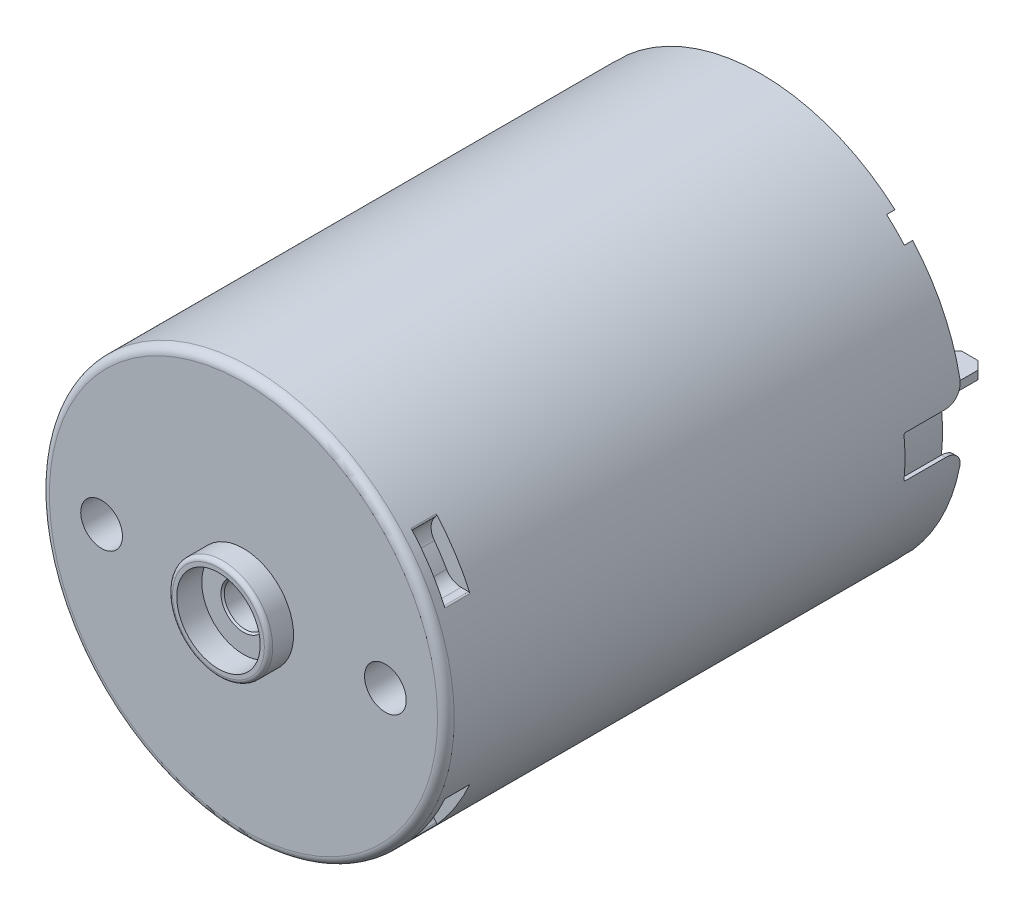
ISO-10303-21;
HEADER;
FILE_DESCRIPTION(('STEP AP214'),'2;1');
FILE_NAME('part.step','',(''),(''),'','','');
FILE_SCHEMA(('AUTOMOTIVE_DESIGN { 1 0 10303 214 1 1 1 1 }'));
ENDSEC;
DATA;
#1=APPLICATION_CONTEXT('core data for automotive mechanical design processes');
#2=APPLICATION_PROTOCOL_DEFINITION('international standard','automotive_design',2000,#1);
#3=PRODUCT_CONTEXT('',#1,'mechanical');
#4=PRODUCT('Part','Part','',(#3));
#5=PRODUCT_RELATED_PRODUCT_CATEGORY('part','',(#4));
#6=PRODUCT_DEFINITION_FORMATION('','',#4);
#7=PRODUCT_DEFINITION_CONTEXT('part definition',#1,'design');
#8=PRODUCT_DEFINITION('design','',#6,#7);
#9=PRODUCT_DEFINITION_SHAPE('','',#8);
#10=(LENGTH_UNIT() NAMED_UNIT(*) SI_UNIT(.MILLI.,.METRE.));
#11=(NAMED_UNIT(*) PLANE_ANGLE_UNIT() SI_UNIT($,.RADIAN.));
#12=(NAMED_UNIT(*) SI_UNIT($,.STERADIAN.) SOLID_ANGLE_UNIT());
#13=UNCERTAINTY_MEASURE_WITH_UNIT(LENGTH_MEASURE(1.E-05),#10,'distance_accuracy_value','');
#14=(GEOMETRIC_REPRESENTATION_CONTEXT(3) GLOBAL_UNCERTAINTY_ASSIGNED_CONTEXT((#13)) GLOBAL_UNIT_ASSIGNED_CONTEXT((#10,
#11,#12)) REPRESENTATION_CONTEXT('',''));
#15=CARTESIAN_POINT('',(0.,0.,0.));
#16=DIRECTION('',(0.,0.,1.));
#17=DIRECTION('',(1.,0.,0.));
#18=AXIS2_PLACEMENT_3D('',#15,#16,#17);
#19=CARTESIAN_POINT('',(-10.,0.25,-19.));
#20=DIRECTION('',(0.,-1.,0.));
#21=DIRECTION('',(0.,0.,-1.));
#22=AXIS2_PLACEMENT_3D('',#19,#20,#21);
#23=PLANE('',#22);
#24=DIRECTION('',(0.,0.,1.));
#25=VECTOR('',#24,1.);
#26=CARTESIAN_POINT('',(-8.,0.25,-19.));
#27=LINE('',#26,#25);
#28=CARTESIAN_POINT('',(-8.,0.25,-18.5));
#29=VERTEX_POINT('',#28);
#30=CARTESIAN_POINT('',(-8.,0.25,-14.5));
#31=VERTEX_POINT('',#30);
#32=EDGE_CURVE('E617',#29,#31,#27,.T.);
#33=ORIENTED_EDGE('',*,*,#32,.F.);
#34=DIRECTION('',(-0.707106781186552,0.,-0.707106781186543));
#35=VECTOR('',#34,1.);
#36=CARTESIAN_POINT('',(-8.50000000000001,0.25,-19.));
#37=LINE('',#36,#35);
#38=CARTESIAN_POINT('',(-8.50000000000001,0.25,-19.));
#39=VERTEX_POINT('',#38);
#40=EDGE_CURVE('E50',#29,#39,#37,.T.);
#41=ORIENTED_EDGE('',*,*,#40,.T.);
#42=DIRECTION('',(1.,0.,0.));
#43=VECTOR('',#42,1.);
#44=CARTESIAN_POINT('',(-10.,0.25,-19.));
#45=LINE('',#44,#43);
#46=CARTESIAN_POINT('',(-9.49999999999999,0.25,-19.));
#47=VERTEX_POINT('',#46);
#48=EDGE_CURVE('E596',#47,#39,#45,.T.);
#49=ORIENTED_EDGE('',*,*,#48,.F.);
#50=DIRECTION('',(0.707106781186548,0.,-0.707106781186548));
#51=VECTOR('',#50,1.);
#52=CARTESIAN_POINT('',(-10.,0.25,-18.5));
#53=LINE('',#52,#51);
#54=CARTESIAN_POINT('',(-10.,0.25,-18.5));
#55=VERTEX_POINT('',#54);
#56=EDGE_CURVE('E1530',#47,#55,#53,.F.);
#57=ORIENTED_EDGE('',*,*,#56,.T.);
#58=DIRECTION('',(0.,0.,1.));
#59=VECTOR('',#58,1.);
#60=CARTESIAN_POINT('',(-10.,0.25,-19.));
#61=LINE('',#60,#59);
#62=CARTESIAN_POINT('',(-10.,0.25,-14.5));
#63=VERTEX_POINT('',#62);
#64=EDGE_CURVE('E619',#55,#63,#61,.T.);
#65=ORIENTED_EDGE('',*,*,#64,.T.);
#66=DIRECTION('',(1.,0.,0.));
#67=VECTOR('',#66,1.);
#68=CARTESIAN_POINT('',(-10.,0.25,-14.5));
#69=LINE('',#68,#67);
#70=EDGE_CURVE('E606',#63,#31,#69,.T.);
#71=ORIENTED_EDGE('',*,*,#70,.T.);
#72=EDGE_LOOP('',(#33,#41,#49,#57,#65,#71));
#73=FACE_BOUND('',#72,.T.);
#74=CARTESIAN_POINT('',(-8.8,0.25,-16.7));
#75=DIRECTION('',(0.,-1.,0.));
#76=DIRECTION('',(0.,0.,-1.));
#77=AXIS2_PLACEMENT_3D('',#74,#75,#76);
#78=CIRCLE('',#77,0.2);
#79=CARTESIAN_POINT('',(-8.6,0.25,-16.7));
#80=VERTEX_POINT('',#79);
#81=CARTESIAN_POINT('',(-8.8,0.25,-16.5));
#82=VERTEX_POINT('',#81);
#83=EDGE_CURVE('E541',#80,#82,#78,.T.);
#84=ORIENTED_EDGE('',*,*,#83,.T.);
#85=DIRECTION('',(1.,0.,0.));
#86=VECTOR('',#85,1.);
#87=CARTESIAN_POINT('',(-8.8,0.25,-16.5));
#88=LINE('',#87,#86);
#89=CARTESIAN_POINT('',(-9.2,0.25,-16.5));
#90=VERTEX_POINT('',#89);
#91=EDGE_CURVE('E550',#90,#82,#88,.T.);
#92=ORIENTED_EDGE('',*,*,#91,.F.);
#93=CARTESIAN_POINT('',(-9.2,0.25,-16.7));
#94=DIRECTION('',(0.,-1.,0.));
#95=DIRECTION('',(0.,0.,-1.));
#96=AXIS2_PLACEMENT_3D('',#93,#94,#95);
#97=CIRCLE('',#96,0.2);
#98=CARTESIAN_POINT('',(-9.4,0.25,-16.7));
#99=VERTEX_POINT('',#98);
#100=EDGE_CURVE('E57',#99,#90,#97,.F.);
#101=ORIENTED_EDGE('',*,*,#100,.F.);
#102=DIRECTION('',(0.,0.,1.));
#103=VECTOR('',#102,1.);
#104=CARTESIAN_POINT('',(-9.4,0.25,-16.7));
#105=LINE('',#104,#103);
#106=CARTESIAN_POINT('',(-9.4,0.25,-17.8));
#107=VERTEX_POINT('',#106);
#108=EDGE_CURVE('E2499',#107,#99,#105,.T.);
#109=ORIENTED_EDGE('',*,*,#108,.F.);
#110=CARTESIAN_POINT('',(-9.2,0.25,-17.8));
#111=DIRECTION('',(0.,-1.,0.));
#112=DIRECTION('',(0.,0.,-1.));
#113=AXIS2_PLACEMENT_3D('',#110,#111,#112);
#114=CIRCLE('',#113,0.2);
#115=CARTESIAN_POINT('',(-9.2,0.25,-18.));
#116=VERTEX_POINT('',#115);
#117=EDGE_CURVE('E2502',#107,#116,#114,.T.);
#118=ORIENTED_EDGE('',*,*,#117,.T.);
#119=DIRECTION('',(1.,0.,0.));
#120=VECTOR('',#119,1.);
#121=CARTESIAN_POINT('',(-8.8,0.25,-18.));
#122=LINE('',#121,#120);
#123=CARTESIAN_POINT('',(-8.8,0.25,-18.));
#124=VERTEX_POINT('',#123);
#125=EDGE_CURVE('E2507',#116,#124,#122,.T.);
#126=ORIENTED_EDGE('',*,*,#125,.T.);
#127=CARTESIAN_POINT('',(-8.8,0.25,-17.8));
#128=DIRECTION('',(0.,-1.,0.));
#129=DIRECTION('',(0.,0.,-1.));
#130=AXIS2_PLACEMENT_3D('',#127,#128,#129);
#131=CIRCLE('',#130,0.2);
#132=CARTESIAN_POINT('',(-8.6,0.25,-17.8));
#133=VERTEX_POINT('',#132);
#134=EDGE_CURVE('E562',#124,#133,#131,.T.);
#135=ORIENTED_EDGE('',*,*,#134,.T.);
#136=DIRECTION('',(0.,0.,1.));
#137=VECTOR('',#136,1.);
#138=CARTESIAN_POINT('',(-8.6,0.25,-16.7));
#139=LINE('',#138,#137);
#140=EDGE_CURVE('E558',#133,#80,#139,.T.);
#141=ORIENTED_EDGE('',*,*,#140,.T.);
#142=EDGE_LOOP('',(#84,#92,#101,#109,#118,#126,#135,#141));
#143=FACE_BOUND('',#142,.T.);
#144=ADVANCED_FACE('F42',(#73,#143),#23,.F.);
#145=CARTESIAN_POINT('',(-10.,-0.25,-19.));
#146=DIRECTION('',(0.,-1.,0.));
#147=DIRECTION('',(0.,0.,-1.));
#148=AXIS2_PLACEMENT_3D('',#145,#146,#147);
#149=PLANE('',#148);
#150=DIRECTION('',(1.,0.,0.));
#151=VECTOR('',#150,1.);
#152=CARTESIAN_POINT('',(-10.,-0.25,-19.));
#153=LINE('',#152,#151);
#154=CARTESIAN_POINT('',(-9.49999999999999,-0.25,-19.));
#155=VERTEX_POINT('',#154);
#156=CARTESIAN_POINT('',(-8.50000000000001,-0.25,-19.));
#157=VERTEX_POINT('',#156);
#158=EDGE_CURVE('E599',#155,#157,#153,.T.);
#159=ORIENTED_EDGE('',*,*,#158,.T.);
#160=DIRECTION('',(0.707106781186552,0.,0.707106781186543));
#161=VECTOR('',#160,1.);
#162=CARTESIAN_POINT('',(-9.25000000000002,-0.25,-19.75));
#163=LINE('',#162,#161);
#164=CARTESIAN_POINT('',(-8.,-0.25,-18.5));
#165=VERTEX_POINT('',#164);
#166=EDGE_CURVE('E1526',#157,#165,#163,.T.);
#167=ORIENTED_EDGE('',*,*,#166,.T.);
#168=DIRECTION('',(0.,0.,1.));
#169=VECTOR('',#168,1.);
#170=CARTESIAN_POINT('',(-8.,-0.25,-19.));
#171=LINE('',#170,#169);
#172=CARTESIAN_POINT('',(-8.,-0.25,-14.5));
#173=VERTEX_POINT('',#172);
#174=EDGE_CURVE('E615',#165,#173,#171,.T.);
#175=ORIENTED_EDGE('',*,*,#174,.T.);
#176=DIRECTION('',(1.,0.,0.));
#177=VECTOR('',#176,1.);
#178=CARTESIAN_POINT('',(-10.,-0.25,-14.5));
#179=LINE('',#178,#177);
#180=CARTESIAN_POINT('',(-10.,-0.25,-14.5));
#181=VERTEX_POINT('',#180);
#182=EDGE_CURVE('E600',#181,#173,#179,.T.);
#183=ORIENTED_EDGE('',*,*,#182,.F.);
#184=DIRECTION('',(0.,0.,1.));
#185=VECTOR('',#184,1.);
#186=CARTESIAN_POINT('',(-10.,-0.25,-19.));
#187=LINE('',#186,#185);
#188=CARTESIAN_POINT('',(-10.,-0.25,-18.5));
#189=VERTEX_POINT('',#188);
#190=EDGE_CURVE('E603',#189,#181,#187,.T.);
#191=ORIENTED_EDGE('',*,*,#190,.F.);
#192=DIRECTION('',(-0.707106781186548,0.,0.707106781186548));
#193=VECTOR('',#192,1.);
#194=CARTESIAN_POINT('',(-9.75,-0.25,-18.75));
#195=LINE('',#194,#193);
#196=EDGE_CURVE('E1524',#189,#155,#195,.F.);
#197=ORIENTED_EDGE('',*,*,#196,.T.);
#198=EDGE_LOOP('',(#159,#167,#175,#183,#191,#197));
#199=FACE_BOUND('',#198,.T.);
#200=DIRECTION('',(-1.,0.,0.));
#201=VECTOR('',#200,1.);
#202=CARTESIAN_POINT('',(-8.8,-0.25,-16.5));
#203=LINE('',#202,#201);
#204=CARTESIAN_POINT('',(-8.8,-0.25,-16.5));
#205=VERTEX_POINT('',#204);
#206=CARTESIAN_POINT('',(-9.2,-0.25,-16.5));
#207=VERTEX_POINT('',#206);
#208=EDGE_CURVE('E560',#205,#207,#203,.T.);
#209=ORIENTED_EDGE('',*,*,#208,.F.);
#210=CARTESIAN_POINT('',(-8.8,-0.25,-16.7));
#211=DIRECTION('',(0.,1.,0.));
#212=DIRECTION('',(0.,0.,-1.));
#213=AXIS2_PLACEMENT_3D('',#210,#211,#212);
#214=CIRCLE('',#213,0.2);
#215=CARTESIAN_POINT('',(-8.6,-0.25,-16.7));
#216=VERTEX_POINT('',#215);
#217=EDGE_CURVE('E65',#205,#216,#214,.T.);
#218=ORIENTED_EDGE('',*,*,#217,.T.);
#219=DIRECTION('',(0.,0.,-1.));
#220=VECTOR('',#219,1.);
#221=CARTESIAN_POINT('',(-8.6,-0.25,-16.7));
#222=LINE('',#221,#220);
#223=CARTESIAN_POINT('',(-8.6,-0.25,-17.8));
#224=VERTEX_POINT('',#223);
#225=EDGE_CURVE('E547',#216,#224,#222,.T.);
#226=ORIENTED_EDGE('',*,*,#225,.T.);
#227=CARTESIAN_POINT('',(-8.8,-0.25,-17.8));
#228=DIRECTION('',(0.,1.,0.));
#229=DIRECTION('',(0.,0.,-1.));
#230=AXIS2_PLACEMENT_3D('',#227,#228,#229);
#231=CIRCLE('',#230,0.2);
#232=CARTESIAN_POINT('',(-8.8,-0.25,-18.));
#233=VERTEX_POINT('',#232);
#234=EDGE_CURVE('E579',#224,#233,#231,.T.);
#235=ORIENTED_EDGE('',*,*,#234,.T.);
#236=DIRECTION('',(-1.,0.,0.));
#237=VECTOR('',#236,1.);
#238=CARTESIAN_POINT('',(-8.8,-0.25,-18.));
#239=LINE('',#238,#237);
#240=CARTESIAN_POINT('',(-9.2,-0.25,-18.));
#241=VERTEX_POINT('',#240);
#242=EDGE_CURVE('E576',#233,#241,#239,.T.);
#243=ORIENTED_EDGE('',*,*,#242,.T.);
#244=CARTESIAN_POINT('',(-9.2,-0.25,-17.8));
#245=DIRECTION('',(0.,1.,0.));
#246=DIRECTION('',(0.,0.,-1.));
#247=AXIS2_PLACEMENT_3D('',#244,#245,#246);
#248=CIRCLE('',#247,0.2);
#249=CARTESIAN_POINT('',(-9.4,-0.25,-17.8));
#250=VERTEX_POINT('',#249);
#251=EDGE_CURVE('E573',#241,#250,#248,.T.);
#252=ORIENTED_EDGE('',*,*,#251,.T.);
#253=DIRECTION('',(0.,0.,-1.));
#254=VECTOR('',#253,1.);
#255=CARTESIAN_POINT('',(-9.4,-0.25,-16.7));
#256=LINE('',#255,#254);
#257=CARTESIAN_POINT('',(-9.4,-0.25,-16.7));
#258=VERTEX_POINT('',#257);
#259=EDGE_CURVE('E570',#258,#250,#256,.T.);
#260=ORIENTED_EDGE('',*,*,#259,.F.);
#261=CARTESIAN_POINT('',(-9.2,-0.25,-16.7));
#262=DIRECTION('',(0.,-1.,0.));
#263=DIRECTION('',(0.,0.,1.));
#264=AXIS2_PLACEMENT_3D('',#261,#262,#263);
#265=CIRCLE('',#264,0.2);
#266=EDGE_CURVE('E567',#207,#258,#265,.T.);
#267=ORIENTED_EDGE('',*,*,#266,.F.);
#268=EDGE_LOOP('',(#209,#218,#226,#235,#243,#252,#260,#267));
#269=FACE_BOUND('',#268,.T.);
#270=ADVANCED_FACE('F1172',(#199,#269),#149,.T.);
#271=CARTESIAN_POINT('',(0.,0.,-14.5));
#272=DIRECTION('',(0.,0.,-1.));
#273=DIRECTION('',(-1.,0.,0.));
#274=AXIS2_PLACEMENT_3D('',#271,#272,#273);
#275=PLANE('',#274);
#276=DIRECTION('',(0.,-1.,0.));
#277=VECTOR('',#276,1.);
#278=CARTESIAN_POINT('',(-10.,0.25,-14.5));
#279=LINE('',#278,#277);
#280=EDGE_CURVE('E553',#63,#181,#279,.T.);
#281=ORIENTED_EDGE('',*,*,#280,.T.);
#282=ORIENTED_EDGE('',*,*,#182,.T.);
#283=DIRECTION('',(0.,-1.,0.));
#284=VECTOR('',#283,1.);
#285=CARTESIAN_POINT('',(-8.,0.25,-14.5));
#286=LINE('',#285,#284);
#287=EDGE_CURVE('E609',#31,#173,#286,.T.);
#288=ORIENTED_EDGE('',*,*,#287,.F.);
#289=ORIENTED_EDGE('',*,*,#70,.F.);
#290=EDGE_LOOP('',(#281,#282,#288,#289));
#291=FACE_BOUND('',#290,.T.);
#292=CARTESIAN_POINT('',(0.,0.,-14.5));
#293=DIRECTION('',(0.,0.,-1.));
#294=DIRECTION('',(-1.,0.,0.));
#295=AXIS2_PLACEMENT_3D('',#292,#293,#294);
#296=CIRCLE('',#295,3.);
#297=CARTESIAN_POINT('',(-3.,0.,-14.5));
#298=VERTEX_POINT('',#297);
#299=EDGE_CURVE('E833',#298,#298,#296,.T.);
#300=ORIENTED_EDGE('',*,*,#299,.F.);
#301=EDGE_LOOP('',(#300));
#302=FACE_BOUND('',#301,.T.);
#303=CARTESIAN_POINT('',(0.,0.,-14.5));
#304=DIRECTION('',(0.,0.,-1.));
#305=DIRECTION('',(-1.,0.,0.));
#306=AXIS2_PLACEMENT_3D('',#303,#304,#305);
#307=CIRCLE('',#306,11.875);
#308=CARTESIAN_POINT('',(11.809027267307,1.25,-14.5));
#309=VERTEX_POINT('',#308);
#310=CARTESIAN_POINT('',(11.809027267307,-1.25,-14.5));
#311=VERTEX_POINT('',#310);
#312=EDGE_CURVE('E850',#309,#311,#307,.T.);
#313=ORIENTED_EDGE('',*,*,#312,.T.);
#314=EDGE_CURVE('E854',#311,#309,#307,.T.);
#315=ORIENTED_EDGE('',*,*,#314,.T.);
#316=EDGE_LOOP('',(#313,#315));
#317=FACE_BOUND('',#316,.T.);
#318=DIRECTION('',(-1.,0.,0.));
#319=VECTOR('',#318,1.);
#320=CARTESIAN_POINT('',(10.,-0.25,-14.5));
#321=LINE('',#320,#319);
#322=CARTESIAN_POINT('',(10.,-0.25,-14.5));
#323=VERTEX_POINT('',#322);
#324=CARTESIAN_POINT('',(8.,-0.25,-14.5));
#325=VERTEX_POINT('',#324);
#326=EDGE_CURVE('E693',#323,#325,#321,.T.);
#327=ORIENTED_EDGE('',*,*,#326,.F.);
#328=DIRECTION('',(0.,-1.,0.));
#329=VECTOR('',#328,1.);
#330=CARTESIAN_POINT('',(10.,0.25,-14.5));
#331=LINE('',#330,#329);
#332=CARTESIAN_POINT('',(10.,0.25,-14.5));
#333=VERTEX_POINT('',#332);
#334=EDGE_CURVE('E682',#333,#323,#331,.T.);
#335=ORIENTED_EDGE('',*,*,#334,.F.);
#336=DIRECTION('',(-1.,0.,0.));
#337=VECTOR('',#336,1.);
#338=CARTESIAN_POINT('',(10.,0.25,-14.5));
#339=LINE('',#338,#337);
#340=CARTESIAN_POINT('',(8.,0.25,-14.5));
#341=VERTEX_POINT('',#340);
#342=EDGE_CURVE('E687',#333,#341,#339,.T.);
#343=ORIENTED_EDGE('',*,*,#342,.T.);
#344=DIRECTION('',(0.,-1.,0.));
#345=VECTOR('',#344,1.);
#346=CARTESIAN_POINT('',(8.,0.25,-14.5));
#347=LINE('',#346,#345);
#348=EDGE_CURVE('E696',#341,#325,#347,.T.);
#349=ORIENTED_EDGE('',*,*,#348,.T.);
#350=EDGE_LOOP('',(#327,#335,#343,#349));
#351=FACE_BOUND('',#350,.T.);
#352=ADVANCED_FACE('F1116',(#291,#302,#317,#351),#275,.T.);
#353=CARTESIAN_POINT('',(0.,0.,15.5));
#354=DIRECTION('',(0.,0.,-1.));
#355=DIRECTION('',(-1.,0.,0.));
#356=AXIS2_PLACEMENT_3D('',#353,#354,#355);
#357=CYLINDRICAL_SURFACE('',#356,12.125);
#358=CARTESIAN_POINT('',(0.,0.,14.5));
#359=DIRECTION('',(0.,0.,-1.));
#360=DIRECTION('',(-1.,0.,0.));
#361=AXIS2_PLACEMENT_3D('',#358,#359,#360);
#362=CIRCLE('',#361,12.125);
#363=CARTESIAN_POINT('',(-11.0726974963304,4.94074844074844,14.5));
#364=VERTEX_POINT('',#363);
#365=CARTESIAN_POINT('',(-9.04494630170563,8.07493476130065,14.5));
#366=VERTEX_POINT('',#365);
#367=EDGE_CURVE('E1045',#364,#366,#362,.T.);
#368=ORIENTED_EDGE('',*,*,#367,.F.);
#369=DIRECTION('',(0.,0.,-1.));
#370=VECTOR('',#369,1.);
#371=CARTESIAN_POINT('',(-11.0726974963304,4.94074844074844,15.5));
#372=LINE('',#371,#370);
#373=CARTESIAN_POINT('',(-11.0726974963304,4.94074844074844,13.));
#374=VERTEX_POINT('',#373);
#375=EDGE_CURVE('E1069',#364,#374,#372,.T.);
#376=ORIENTED_EDGE('',*,*,#375,.T.);
#377=CARTESIAN_POINT('',(0.,0.,13.));
#378=DIRECTION('',(0.,0.,1.));
#379=DIRECTION('',(1.,0.,0.));
#380=AXIS2_PLACEMENT_3D('',#377,#378,#379);
#381=CIRCLE('',#380,12.125);
#382=CARTESIAN_POINT('',(-9.04494630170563,8.07493476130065,13.));
#383=VERTEX_POINT('',#382);
#384=EDGE_CURVE('E1043',#383,#374,#381,.T.);
#385=ORIENTED_EDGE('',*,*,#384,.F.);
#386=DIRECTION('',(0.,0.,-1.));
#387=VECTOR('',#386,1.);
#388=CARTESIAN_POINT('',(-9.04494630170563,8.07493476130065,15.5));
#389=LINE('',#388,#387);
#390=EDGE_CURVE('E1066',#383,#366,#389,.F.);
#391=ORIENTED_EDGE('',*,*,#390,.T.);
#392=EDGE_LOOP('',(#368,#376,#385,#391));
#393=FACE_BOUND('',#392,.T.);
#394=DIRECTION('',(0.,0.,-1.));
#395=VECTOR('',#394,1.);
#396=CARTESIAN_POINT('',(-11.0726974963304,-4.94074844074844,15.5));
#397=LINE('',#396,#395);
#398=CARTESIAN_POINT('',(-11.0726974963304,-4.94074844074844,13.));
#399=VERTEX_POINT('',#398);
#400=CARTESIAN_POINT('',(-11.0726974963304,-4.94074844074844,14.5));
#401=VERTEX_POINT('',#400);
#402=EDGE_CURVE('E1026',#399,#401,#397,.F.);
#403=ORIENTED_EDGE('',*,*,#402,.T.);
#404=CARTESIAN_POINT('',(0.,0.,14.5));
#405=DIRECTION('',(0.,0.,1.));
#406=DIRECTION('',(1.,0.,0.));
#407=AXIS2_PLACEMENT_3D('',#404,#405,#406);
#408=CIRCLE('',#407,12.125);
#409=CARTESIAN_POINT('',(-9.04494630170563,-8.07493476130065,14.5));
#410=VERTEX_POINT('',#409);
#411=EDGE_CURVE('E1002',#401,#410,#408,.T.);
#412=ORIENTED_EDGE('',*,*,#411,.T.);
#413=DIRECTION('',(0.,0.,-1.));
#414=VECTOR('',#413,1.);
#415=CARTESIAN_POINT('',(-9.04494630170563,-8.07493476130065,15.5));
#416=LINE('',#415,#414);
#417=CARTESIAN_POINT('',(-9.04494630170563,-8.07493476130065,13.));
#418=VERTEX_POINT('',#417);
#419=EDGE_CURVE('E1023',#410,#418,#416,.T.);
#420=ORIENTED_EDGE('',*,*,#419,.T.);
#421=CARTESIAN_POINT('',(0.,0.,13.));
#422=DIRECTION('',(0.,0.,-1.));
#423=DIRECTION('',(-1.,0.,0.));
#424=AXIS2_PLACEMENT_3D('',#421,#422,#423);
#425=CIRCLE('',#424,12.125);
#426=EDGE_CURVE('E1004',#418,#399,#425,.T.);
#427=ORIENTED_EDGE('',*,*,#426,.T.);
#428=EDGE_LOOP('',(#403,#412,#420,#427));
#429=FACE_BOUND('',#428,.T.);
#430=CARTESIAN_POINT('',(0.,0.,15.));
#431=DIRECTION('',(0.,0.,1.));
#432=DIRECTION('',(1.,0.,0.));
#433=AXIS2_PLACEMENT_3D('',#430,#431,#432);
#434=CIRCLE('',#433,12.125);
#435=CARTESIAN_POINT('',(12.125,0.,15.));
#436=VERTEX_POINT('',#435);
#437=EDGE_CURVE('E916',#436,#436,#434,.F.);
#438=ORIENTED_EDGE('',*,*,#437,.T.);
#439=EDGE_LOOP('',(#438));
#440=FACE_BOUND('',#439,.T.);
#441=DIRECTION('',(0.,0.,-1.));
#442=VECTOR('',#441,1.);
#443=CARTESIAN_POINT('',(11.0726974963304,4.94074844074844,15.5));
#444=LINE('',#443,#442);
#445=CARTESIAN_POINT('',(11.0726974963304,4.94074844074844,13.));
#446=VERTEX_POINT('',#445);
#447=CARTESIAN_POINT('',(11.0726974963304,4.94074844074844,14.5));
#448=VERTEX_POINT('',#447);
#449=EDGE_CURVE('E943',#446,#448,#444,.F.);
#450=ORIENTED_EDGE('',*,*,#449,.T.);
#451=CARTESIAN_POINT('',(0.,0.,14.5));
#452=DIRECTION('',(0.,0.,1.));
#453=DIRECTION('',(1.,0.,0.));
#454=AXIS2_PLACEMENT_3D('',#451,#452,#453);
#455=CIRCLE('',#454,12.125);
#456=CARTESIAN_POINT('',(9.04494630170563,8.07493476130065,14.5));
#457=VERTEX_POINT('',#456);
#458=EDGE_CURVE('E919',#448,#457,#455,.T.);
#459=ORIENTED_EDGE('',*,*,#458,.T.);
#460=DIRECTION('',(0.,0.,-1.));
#461=VECTOR('',#460,1.);
#462=CARTESIAN_POINT('',(9.04494630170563,8.07493476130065,15.5));
#463=LINE('',#462,#461);
#464=CARTESIAN_POINT('',(9.04494630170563,8.07493476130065,13.));
#465=VERTEX_POINT('',#464);
#466=EDGE_CURVE('E940',#457,#465,#463,.T.);
#467=ORIENTED_EDGE('',*,*,#466,.T.);
#468=CARTESIAN_POINT('',(0.,0.,13.));
#469=DIRECTION('',(0.,0.,-1.));
#470=DIRECTION('',(-1.,0.,0.));
#471=AXIS2_PLACEMENT_3D('',#468,#469,#470);
#472=CIRCLE('',#471,12.125);
#473=EDGE_CURVE('E921',#465,#446,#472,.T.);
#474=ORIENTED_EDGE('',*,*,#473,.T.);
#475=EDGE_LOOP('',(#450,#459,#467,#474));
#476=FACE_BOUND('',#475,.T.);
#477=CARTESIAN_POINT('',(0.,0.,14.5));
#478=DIRECTION('',(0.,0.,-1.));
#479=DIRECTION('',(-1.,0.,0.));
#480=AXIS2_PLACEMENT_3D('',#477,#478,#479);
#481=CIRCLE('',#480,12.125);
#482=CARTESIAN_POINT('',(11.0726974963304,-4.94074844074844,14.5));
#483=VERTEX_POINT('',#482);
#484=CARTESIAN_POINT('',(9.04494630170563,-8.07493476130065,14.5));
#485=VERTEX_POINT('',#484);
#486=EDGE_CURVE('E962',#483,#485,#481,.T.);
#487=ORIENTED_EDGE('',*,*,#486,.F.);
#488=DIRECTION('',(0.,0.,-1.));
#489=VECTOR('',#488,1.);
#490=CARTESIAN_POINT('',(11.0726974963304,-4.94074844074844,15.5));
#491=LINE('',#490,#489);
#492=CARTESIAN_POINT('',(11.0726974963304,-4.94074844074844,13.));
#493=VERTEX_POINT('',#492);
#494=EDGE_CURVE('E986',#483,#493,#491,.T.);
#495=ORIENTED_EDGE('',*,*,#494,.T.);
#496=CARTESIAN_POINT('',(0.,0.,13.));
#497=DIRECTION('',(0.,0.,1.));
#498=DIRECTION('',(1.,0.,0.));
#499=AXIS2_PLACEMENT_3D('',#496,#497,#498);
#500=CIRCLE('',#499,12.125);
#501=CARTESIAN_POINT('',(9.04494630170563,-8.07493476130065,13.));
#502=VERTEX_POINT('',#501);
#503=EDGE_CURVE('E960',#502,#493,#500,.T.);
#504=ORIENTED_EDGE('',*,*,#503,.F.);
#505=DIRECTION('',(0.,0.,-1.));
#506=VECTOR('',#505,1.);
#507=CARTESIAN_POINT('',(9.04494630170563,-8.07493476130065,15.5));
#508=LINE('',#507,#506);
#509=EDGE_CURVE('E983',#502,#485,#508,.F.);
#510=ORIENTED_EDGE('',*,*,#509,.T.);
#511=EDGE_LOOP('',(#487,#495,#504,#510));
#512=FACE_BOUND('',#511,.T.);
#513=DIRECTION('',(0.,0.,-1.));
#514=VECTOR('',#513,1.);
#515=CARTESIAN_POINT('',(-9.08758212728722,8.0269219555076,15.5));
#516=LINE('',#515,#514);
#517=CARTESIAN_POINT('',(-9.08758212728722,8.0269219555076,-15.));
#518=VERTEX_POINT('',#517);
#519=CARTESIAN_POINT('',(-9.08758212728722,8.0269219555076,-15.5));
#520=VERTEX_POINT('',#519);
#521=EDGE_CURVE('E713',#518,#520,#516,.T.);
#522=ORIENTED_EDGE('',*,*,#521,.T.);
#523=CARTESIAN_POINT('',(0.,0.,-15.5));
#524=DIRECTION('',(0.,0.,1.));
#525=DIRECTION('',(1.,0.,0.));
#526=AXIS2_PLACEMENT_3D('',#523,#524,#525);
#527=CIRCLE('',#526,12.125);
#528=CARTESIAN_POINT('',(-9.08758212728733,-8.02692195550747,-15.5));
#529=VERTEX_POINT('',#528);
#530=EDGE_CURVE('E913',#520,#529,#527,.T.);
#531=ORIENTED_EDGE('',*,*,#530,.T.);
#532=DIRECTION('',(0.,0.,-1.));
#533=VECTOR('',#532,1.);
#534=CARTESIAN_POINT('',(-9.08758212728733,-8.02692195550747,15.5));
#535=LINE('',#534,#533);
#536=CARTESIAN_POINT('',(-9.08758212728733,-8.02692195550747,-15.));
#537=VERTEX_POINT('',#536);
#538=EDGE_CURVE('E735',#537,#529,#535,.T.);
#539=ORIENTED_EDGE('',*,*,#538,.F.);
#540=CARTESIAN_POINT('',(0.,0.,-15.));
#541=DIRECTION('',(0.,0.,1.));
#542=DIRECTION('',(1.,0.,0.));
#543=AXIS2_PLACEMENT_3D('',#540,#541,#542);
#544=CIRCLE('',#543,12.125);
#545=CARTESIAN_POINT('',(-8.02692195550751,-9.0875821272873,-15.));
#546=VERTEX_POINT('',#545);
#547=EDGE_CURVE('E736',#546,#537,#544,.F.);
#548=ORIENTED_EDGE('',*,*,#547,.F.);
#549=DIRECTION('',(0.,0.,-1.));
#550=VECTOR('',#549,1.);
#551=CARTESIAN_POINT('',(-8.02692195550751,-9.0875821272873,15.5));
#552=LINE('',#551,#550);
#553=CARTESIAN_POINT('',(-8.02692195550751,-9.0875821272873,-15.5));
#554=VERTEX_POINT('',#553);
#555=EDGE_CURVE('E738',#546,#554,#552,.T.);
#556=ORIENTED_EDGE('',*,*,#555,.T.);
#557=CARTESIAN_POINT('',(8.02692195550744,-9.08758212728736,-15.5));
#558=VERTEX_POINT('',#557);
#559=EDGE_CURVE('E1647',#554,#558,#527,.T.);
#560=ORIENTED_EDGE('',*,*,#559,.T.);
#561=DIRECTION('',(0.,0.,-1.));
#562=VECTOR('',#561,1.);
#563=CARTESIAN_POINT('',(8.02692195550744,-9.08758212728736,15.5));
#564=LINE('',#563,#562);
#565=CARTESIAN_POINT('',(8.02692195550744,-9.08758212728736,-15.));
#566=VERTEX_POINT('',#565);
#567=EDGE_CURVE('E773',#566,#558,#564,.T.);
#568=ORIENTED_EDGE('',*,*,#567,.F.);
#569=CARTESIAN_POINT('',(0.,0.,-15.));
#570=DIRECTION('',(0.,0.,1.));
#571=DIRECTION('',(1.,0.,0.));
#572=AXIS2_PLACEMENT_3D('',#569,#570,#571);
#573=CIRCLE('',#572,12.125);
#574=CARTESIAN_POINT('',(9.08758212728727,-8.02692195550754,-15.));
#575=VERTEX_POINT('',#574);
#576=EDGE_CURVE('E765',#575,#566,#573,.F.);
#577=ORIENTED_EDGE('',*,*,#576,.F.);
#578=DIRECTION('',(0.,0.,-1.));
#579=VECTOR('',#578,1.);
#580=CARTESIAN_POINT('',(9.08758212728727,-8.02692195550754,15.5));
#581=LINE('',#580,#579);
#582=CARTESIAN_POINT('',(9.08758212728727,-8.02692195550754,-15.5));
#583=VERTEX_POINT('',#582);
#584=EDGE_CURVE('E766',#575,#583,#581,.T.);
#585=ORIENTED_EDGE('',*,*,#584,.T.);
#586=CARTESIAN_POINT('',(11.9144082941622,-2.25,-15.5));
#587=VERTEX_POINT('',#586);
#588=EDGE_CURVE('E907',#583,#587,#527,.T.);
#589=ORIENTED_EDGE('',*,*,#588,.T.);
#590=CARTESIAN_POINT('',(11.9144082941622,-2.25,-15.5));
#591=CARTESIAN_POINT('',(11.919726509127,-2.22184145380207,-15.4999996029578));
#592=CARTESIAN_POINT('',(11.9249412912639,-2.19367652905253,-15.4988098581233));
#593=CARTESIAN_POINT('',(11.9351376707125,-2.13750482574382,-15.4940524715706));
#594=CARTESIAN_POINT('',(11.9401192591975,-2.10949805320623,-15.490484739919));
#595=CARTESIAN_POINT('',(11.9546635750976,-2.02603528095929,-15.4762262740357));
#596=CARTESIAN_POINT('',(11.9638375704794,-1.97107464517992,-15.4619802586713));
#597=CARTESIAN_POINT('',(11.9809626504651,-1.86416229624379,-15.4243097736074));
#598=CARTESIAN_POINT('',(11.9889126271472,-1.81221333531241,-15.4008770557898));
#599=CARTESIAN_POINT('',(12.0035015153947,-1.71291980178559,-15.3454432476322));
#600=CARTESIAN_POINT('',(12.0101409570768,-1.66557337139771,-15.3134456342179));
#601=CARTESIAN_POINT('',(12.0220354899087,-1.5774183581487,-15.242166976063));
#602=CARTESIAN_POINT('',(12.027305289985,-1.53654232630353,-15.2029717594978));
#603=CARTESIAN_POINT('',(12.0366043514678,-1.46191607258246,-15.1181538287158));
#604=CARTESIAN_POINT('',(12.040633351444,-1.42816735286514,-15.0725297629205));
#605=CARTESIAN_POINT('',(12.0474927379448,-1.36909586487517,-14.9766068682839));
#606=CARTESIAN_POINT('',(12.0503334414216,-1.34370099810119,-14.9263531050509));
#607=CARTESIAN_POINT('',(12.0549437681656,-1.30169324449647,-14.8222706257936));
#608=CARTESIAN_POINT('',(12.0567141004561,-1.28507454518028,-14.7684443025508));
#609=CARTESIAN_POINT('',(12.0587899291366,-1.26541267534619,-14.6785506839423));
#610=CARTESIAN_POINT('',(12.0593933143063,-1.25963624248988,-14.6430641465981));
#611=CARTESIAN_POINT('',(12.0601948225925,-1.25193063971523,-14.5717235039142));
#612=CARTESIAN_POINT('',(12.0603935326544,-1.24999589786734,-14.5358700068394));
#613=CARTESIAN_POINT('',(12.0603948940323,-1.25,-14.5));
#614=B_SPLINE_CURVE_WITH_KNOTS('',3,(#590,#591,#592,#593,#594,#595,#596,#597,#598,#599,#600,
#601,#602,#603,#604,#605,#606,#607,#608,#609,#610,#611,#612,#613),.UNSPECIFIED.,.F.,.F.,(4,2,2,
2,2,2,2,2,2,2,2,4),(0.,0.0859180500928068,0.171839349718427,0.343494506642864,0.515304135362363,
0.687044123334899,0.856855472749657,1.02670257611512,1.19504279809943,1.36327138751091,
1.47095277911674,1.57847787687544),.UNSPECIFIED.);
#615=CARTESIAN_POINT('',(12.0603948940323,-1.25,-14.5));
#616=VERTEX_POINT('',#615);
#617=EDGE_CURVE('E1101',#587,#616,#614,.T.);
#618=ORIENTED_EDGE('',*,*,#617,.T.);
#619=DIRECTION('',(0.,0.,-1.));
#620=VECTOR('',#619,1.);
#621=CARTESIAN_POINT('',(12.0603948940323,-1.25,15.5));
#622=LINE('',#621,#620);
#623=CARTESIAN_POINT('',(12.0603948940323,-1.25,-12.1));
#624=VERTEX_POINT('',#623);
#625=EDGE_CURVE('E839',#616,#624,#622,.F.);
#626=ORIENTED_EDGE('',*,*,#625,.T.);
#627=CARTESIAN_POINT('',(12.0603948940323,-1.25,-12.1));
#628=CARTESIAN_POINT('',(12.0603942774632,-1.25000487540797,-12.094395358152));
#629=CARTESIAN_POINT('',(12.0604436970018,-1.24952911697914,-12.0887923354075));
#630=CARTESIAN_POINT('',(12.0606380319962,-1.24765253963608,-12.0777503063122));
#631=CARTESIAN_POINT('',(12.0607828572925,-1.24625259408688,-12.0723111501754));
#632=CARTESIAN_POINT('',(12.0611635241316,-1.24256294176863,-12.0617442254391));
#633=CARTESIAN_POINT('',(12.0613994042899,-1.24027285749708,-12.0566165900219));
#634=CARTESIAN_POINT('',(12.0619536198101,-1.23487135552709,-12.0468199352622));
#635=CARTESIAN_POINT('',(12.0622719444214,-1.2317600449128,-12.0421508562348));
#636=CARTESIAN_POINT('',(12.0629810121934,-1.2247964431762,-12.0333900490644));
#637=CARTESIAN_POINT('',(12.0633719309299,-1.22094235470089,-12.0292997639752));
#638=CARTESIAN_POINT('',(12.0642126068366,-1.21260739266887,-12.0218228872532));
#639=CARTESIAN_POINT('',(12.0646623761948,-1.20812638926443,-12.0184364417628));
#640=CARTESIAN_POINT('',(12.0656084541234,-1.19864108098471,-12.0124461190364));
#641=CARTESIAN_POINT('',(12.0661049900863,-1.19363420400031,-12.009846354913));
#642=CARTESIAN_POINT('',(12.0671268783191,-1.18325863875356,-12.0055256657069));
#643=CARTESIAN_POINT('',(12.0676522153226,-1.17789014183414,-12.0038042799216));
#644=CARTESIAN_POINT('',(12.068540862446,-1.16874296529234,-12.0016996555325));
#645=CARTESIAN_POINT('',(12.0689008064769,-1.16502031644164,-12.0010627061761));
#646=CARTESIAN_POINT('',(12.0696212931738,-1.15753234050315,-12.0002129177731));
#647=CARTESIAN_POINT('',(12.0699818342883,-1.15376708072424,-11.99999948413));
#648=CARTESIAN_POINT('',(12.0703407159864,-1.15000000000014,-11.9999999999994));
#649=B_SPLINE_CURVE_WITH_KNOTS('',3,(#627,#628,#629,#630,#631,#632,#633,#634,#635,#636,#637,
#638,#639,#640,#641,#642,#643,#644,#645,#646,#647,#648),.UNSPECIFIED.,.F.,.F.,(4,2,2,2,2,2,2,2,
2,2,4),(0.,0.0167911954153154,0.0335665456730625,0.0503490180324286,0.0671293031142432,
0.0839507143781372,0.10077561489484,0.117687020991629,0.134589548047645,0.145948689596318,
0.157291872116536),.UNSPECIFIED.);
#650=CARTESIAN_POINT('',(12.0703407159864,-1.15,-12.));
#651=VERTEX_POINT('',#650);
#652=EDGE_CURVE('E1127',#624,#651,#649,.T.);
#653=ORIENTED_EDGE('',*,*,#652,.T.);
#654=CARTESIAN_POINT('',(0.,0.,-12.));
#655=DIRECTION('',(0.,0.,1.));
#656=DIRECTION('',(1.,0.,0.));
#657=AXIS2_PLACEMENT_3D('',#654,#655,#656);
#658=CIRCLE('',#657,12.125);
#659=CARTESIAN_POINT('',(12.0703407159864,1.15,-12.));
#660=VERTEX_POINT('',#659);
#661=EDGE_CURVE('E1085',#651,#660,#658,.T.);
#662=ORIENTED_EDGE('',*,*,#661,.T.);
#663=CARTESIAN_POINT('',(12.0703407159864,1.15,-12.));
#664=CARTESIAN_POINT('',(12.069802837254,1.15564716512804,-11.9999953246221));
#665=CARTESIAN_POINT('',(12.0692608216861,1.16129258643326,-12.0004780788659));
#666=CARTESIAN_POINT('',(12.0681849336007,1.17241956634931,-12.0023836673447));
#667=CARTESIAN_POINT('',(12.0676510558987,1.17790123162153,-12.0038058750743));
#668=CARTESIAN_POINT('',(12.0666068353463,1.18855097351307,-12.007556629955));
#669=CARTESIAN_POINT('',(12.0660965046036,1.19371888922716,-12.0098856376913));
#670=CARTESIAN_POINT('',(12.0651158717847,1.20358986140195,-12.0153831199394));
#671=CARTESIAN_POINT('',(12.0646455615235,1.20829301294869,-12.0185514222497));
#672=CARTESIAN_POINT('',(12.0637610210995,1.21709268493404,-12.025633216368));
#673=CARTESIAN_POINT('',(12.0633466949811,1.22119024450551,-12.0295454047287));
#674=CARTESIAN_POINT('',(12.0625871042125,1.22867063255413,-12.0380094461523));
#675=CARTESIAN_POINT('',(12.0622418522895,1.23205332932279,-12.042561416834));
#676=CARTESIAN_POINT('',(12.0616339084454,1.23799085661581,-12.0521533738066));
#677=CARTESIAN_POINT('',(12.0613708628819,1.24054923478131,-12.0571911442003));
#678=CARTESIAN_POINT('',(12.0609347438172,1.24478217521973,-12.067627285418));
#679=CARTESIAN_POINT('',(12.0607616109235,1.2464573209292,-12.0730254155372));
#680=CARTESIAN_POINT('',(12.0605562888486,1.24844207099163,-12.0820494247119));
#681=CARTESIAN_POINT('',(12.0604958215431,1.24902594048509,-12.0856167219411));
#682=CARTESIAN_POINT('',(12.0604151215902,1.24980484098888,-12.0927888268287));
#683=CARTESIAN_POINT('',(12.0603948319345,1.25000042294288,-12.0963935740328));
#684=CARTESIAN_POINT('',(12.0603948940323,1.25000000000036,-12.0999999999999));
#685=B_SPLINE_CURVE_WITH_KNOTS('',3,(#663,#664,#665,#666,#667,#668,#669,#670,#671,#672,#673,
#674,#675,#676,#677,#678,#679,#680,#681,#682,#683,#684),.UNSPECIFIED.,.F.,.F.,(4,2,2,2,2,2,2,2,
2,2,4),(0.,0.0169957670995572,0.0339802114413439,0.0509732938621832,0.0679628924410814,
0.084922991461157,0.101886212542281,0.118775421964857,0.135653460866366,0.146479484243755,
0.157290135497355),.UNSPECIFIED.);
#686=CARTESIAN_POINT('',(12.0603948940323,1.25,-12.1));
#687=VERTEX_POINT('',#686);
#688=EDGE_CURVE('E1132',#660,#687,#685,.T.);
#689=ORIENTED_EDGE('',*,*,#688,.T.);
#690=DIRECTION('',(0.,0.,-1.));
#691=VECTOR('',#690,1.);
#692=CARTESIAN_POINT('',(12.0603948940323,1.25,15.5));
#693=LINE('',#692,#691);
#694=CARTESIAN_POINT('',(12.0603948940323,1.25,-14.5));
#695=VERTEX_POINT('',#694);
#696=EDGE_CURVE('E847',#687,#695,#693,.T.);
#697=ORIENTED_EDGE('',*,*,#696,.T.);
#698=CARTESIAN_POINT('',(12.0603948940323,1.25,-14.5));
#699=CARTESIAN_POINT('',(12.0603943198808,1.25000011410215,-14.527997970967));
#700=CARTESIAN_POINT('',(12.0602730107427,1.25117657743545,-14.5559825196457));
#701=CARTESIAN_POINT('',(12.0597854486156,1.25586947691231,-14.6117511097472));
#702=CARTESIAN_POINT('',(12.0594192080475,1.25938579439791,-14.6395351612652));
#703=CARTESIAN_POINT('',(12.0579495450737,1.27340954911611,-14.7222355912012));
#704=CARTESIAN_POINT('',(12.0564752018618,1.287391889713,-14.7765975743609));
#705=CARTESIAN_POINT('',(12.0524852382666,1.32422188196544,-14.8821872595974));
#706=CARTESIAN_POINT('',(12.0499691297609,1.34707368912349,-14.93341347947));
#707=CARTESIAN_POINT('',(12.0438220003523,1.40096725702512,-15.0312830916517));
#708=CARTESIAN_POINT('',(12.0401911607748,1.43200768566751,-15.0779272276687));
#709=CARTESIAN_POINT('',(12.0317353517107,1.50139545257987,-15.1653644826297));
#710=CARTESIAN_POINT('',(12.0269092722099,1.53974957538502,-15.2061521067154));
#711=CARTESIAN_POINT('',(12.016008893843,1.62262074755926,-15.2807059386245));
#712=CARTESIAN_POINT('',(12.0099344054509,1.66713873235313,-15.3144710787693));
#713=CARTESIAN_POINT('',(11.9964959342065,1.76124315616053,-15.374207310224));
#714=CARTESIAN_POINT('',(11.9891260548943,1.81085232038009,-15.4001412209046));
#715=CARTESIAN_POINT('',(11.9731677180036,1.9135237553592,-15.4433358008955));
#716=CARTESIAN_POINT('',(11.9645796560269,1.96658490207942,-15.4605992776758));
#717=CARTESIAN_POINT('',(11.9490860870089,2.05825842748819,-15.4822094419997));
#718=CARTESIAN_POINT('',(11.9424572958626,2.09638699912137,-15.4888836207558));
#719=CARTESIAN_POINT('',(11.9287528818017,2.17301865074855,-15.4977784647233));
#720=CARTESIAN_POINT('',(11.9216779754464,2.21152105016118,-15.5000060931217));
#721=CARTESIAN_POINT('',(11.9144082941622,2.25,-15.5));
#722=B_SPLINE_CURVE_WITH_KNOTS('',3,(#698,#699,#700,#701,#702,#703,#704,#705,#706,#707,#708,
#709,#710,#711,#712,#713,#714,#715,#716,#717,#718,#719,#720,#721),.UNSPECIFIED.,.F.,.F.,(4,2,2,
2,2,2,2,2,2,2,2,4),(0.,0.08394228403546,0.167880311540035,0.335468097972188,0.503134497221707,
0.670773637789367,0.838569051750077,1.00638995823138,1.17499554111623,1.34354649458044,
1.46111906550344,1.57850737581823),.UNSPECIFIED.);
#723=CARTESIAN_POINT('',(11.9144082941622,2.25,-15.5));
#724=VERTEX_POINT('',#723);
#725=EDGE_CURVE('E1094',#695,#724,#722,.T.);
#726=ORIENTED_EDGE('',*,*,#725,.T.);
#727=CARTESIAN_POINT('',(9.08758212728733,8.02692195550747,-15.5));
#728=VERTEX_POINT('',#727);
#729=EDGE_CURVE('E908',#724,#728,#527,.T.);
#730=ORIENTED_EDGE('',*,*,#729,.T.);
#731=DIRECTION('',(0.,0.,-1.));
#732=VECTOR('',#731,1.);
#733=CARTESIAN_POINT('',(9.08758212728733,8.02692195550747,15.5));
#734=LINE('',#733,#732);
#735=CARTESIAN_POINT('',(9.08758212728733,8.02692195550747,-15.));
#736=VERTEX_POINT('',#735);
#737=EDGE_CURVE('E776',#736,#728,#734,.T.);
#738=ORIENTED_EDGE('',*,*,#737,.F.);
#739=CARTESIAN_POINT('',(0.,0.,-15.));
#740=DIRECTION('',(0.,0.,1.));
#741=DIRECTION('',(1.,0.,0.));
#742=AXIS2_PLACEMENT_3D('',#739,#740,#741);
#743=CIRCLE('',#742,12.125);
#744=CARTESIAN_POINT('',(8.02692195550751,9.0875821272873,-15.));
#745=VERTEX_POINT('',#744);
#746=EDGE_CURVE('E788',#745,#736,#743,.F.);
#747=ORIENTED_EDGE('',*,*,#746,.F.);
#748=DIRECTION('',(0.,0.,-1.));
#749=VECTOR('',#748,1.);
#750=CARTESIAN_POINT('',(8.02692195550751,9.0875821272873,15.5));
#751=LINE('',#750,#749);
#752=CARTESIAN_POINT('',(8.02692195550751,9.0875821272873,-15.5));
#753=VERTEX_POINT('',#752);
#754=EDGE_CURVE('E790',#745,#753,#751,.T.);
#755=ORIENTED_EDGE('',*,*,#754,.T.);
#756=CARTESIAN_POINT('',(-8.02692195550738,9.08758212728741,-15.5));
#757=VERTEX_POINT('',#756);
#758=EDGE_CURVE('E912',#753,#757,#527,.T.);
#759=ORIENTED_EDGE('',*,*,#758,.T.);
#760=DIRECTION('',(0.,0.,-1.));
#761=VECTOR('',#760,1.);
#762=CARTESIAN_POINT('',(-8.02692195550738,9.08758212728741,15.5));
#763=LINE('',#762,#761);
#764=CARTESIAN_POINT('',(-8.02692195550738,9.08758212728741,-15.));
#765=VERTEX_POINT('',#764);
#766=EDGE_CURVE('E711',#765,#757,#763,.T.);
#767=ORIENTED_EDGE('',*,*,#766,.F.);
#768=CARTESIAN_POINT('',(0.,0.,-15.));
#769=DIRECTION('',(0.,0.,1.));
#770=DIRECTION('',(1.,0.,0.));
#771=AXIS2_PLACEMENT_3D('',#768,#769,#770);
#772=CIRCLE('',#771,12.125);
#773=EDGE_CURVE('E708',#518,#765,#772,.F.);
#774=ORIENTED_EDGE('',*,*,#773,.F.);
#775=EDGE_LOOP('',(#522,#531,#539,#548,#556,#560,#568,#577,#585,#589,#618,#626,#653,#662,#689,
#697,#726,#730,#738,#747,#755,#759,#767,#774));
#776=FACE_BOUND('',#775,.T.);
#777=ADVANCED_FACE('F1110',(#393,#429,#440,#476,#512,#776),#357,.T.);
#778=CARTESIAN_POINT('',(0.,0.,-14.5));
#779=DIRECTION('',(0.,0.,-1.));
#780=DIRECTION('',(-1.,0.,0.));
#781=AXIS2_PLACEMENT_3D('',#778,#779,#780);
#782=CYLINDRICAL_SURFACE('',#781,11.875);
#783=DIRECTION('',(0.,0.,-1.));
#784=VECTOR('',#783,1.);
#785=CARTESIAN_POINT('',(-8.91045911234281,7.84979894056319,-14.5));
#786=LINE('',#785,#784);
#787=CARTESIAN_POINT('',(-8.91045911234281,7.84979894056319,-15.5));
#788=VERTEX_POINT('',#787);
#789=CARTESIAN_POINT('',(-8.91045911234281,7.84979894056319,-15.));
#790=VERTEX_POINT('',#789);
#791=EDGE_CURVE('E719',#788,#790,#786,.F.);
#792=ORIENTED_EDGE('',*,*,#791,.T.);
#793=CARTESIAN_POINT('',(0.,0.,-15.));
#794=DIRECTION('',(0.,0.,1.));
#795=DIRECTION('',(1.,0.,0.));
#796=AXIS2_PLACEMENT_3D('',#793,#794,#795);
#797=CIRCLE('',#796,11.875);
#798=CARTESIAN_POINT('',(-7.84979894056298,8.910459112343,-15.));
#799=VERTEX_POINT('',#798);
#800=EDGE_CURVE('E732',#799,#790,#797,.T.);
#801=ORIENTED_EDGE('',*,*,#800,.F.);
#802=DIRECTION('',(0.,0.,-1.));
#803=VECTOR('',#802,1.);
#804=CARTESIAN_POINT('',(-7.84979894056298,8.910459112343,-14.5));
#805=LINE('',#804,#803);
#806=CARTESIAN_POINT('',(-7.84979894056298,8.91045911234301,-15.5));
#807=VERTEX_POINT('',#806);
#808=EDGE_CURVE('E716',#807,#799,#805,.F.);
#809=ORIENTED_EDGE('',*,*,#808,.F.);
#810=CARTESIAN_POINT('',(0.,0.,-15.5));
#811=DIRECTION('',(0.,0.,-1.));
#812=DIRECTION('',(-1.,0.,0.));
#813=AXIS2_PLACEMENT_3D('',#810,#811,#812);
#814=CIRCLE('',#813,11.875);
#815=CARTESIAN_POINT('',(7.8497989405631,8.91045911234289,-15.5));
#816=VERTEX_POINT('',#815);
#817=EDGE_CURVE('E859',#807,#816,#814,.T.);
#818=ORIENTED_EDGE('',*,*,#817,.T.);
#819=DIRECTION('',(0.,0.,-1.));
#820=VECTOR('',#819,1.);
#821=CARTESIAN_POINT('',(7.8497989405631,8.91045911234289,-14.5));
#822=LINE('',#821,#820);
#823=CARTESIAN_POINT('',(7.8497989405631,8.91045911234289,-15.));
#824=VERTEX_POINT('',#823);
#825=EDGE_CURVE('E796',#816,#824,#822,.F.);
#826=ORIENTED_EDGE('',*,*,#825,.T.);
#827=CARTESIAN_POINT('',(0.,0.,-15.));
#828=DIRECTION('',(0.,0.,1.));
#829=DIRECTION('',(1.,0.,0.));
#830=AXIS2_PLACEMENT_3D('',#827,#828,#829);
#831=CIRCLE('',#830,11.875);
#832=CARTESIAN_POINT('',(8.91045911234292,7.84979894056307,-15.));
#833=VERTEX_POINT('',#832);
#834=EDGE_CURVE('E809',#833,#824,#831,.T.);
#835=ORIENTED_EDGE('',*,*,#834,.F.);
#836=DIRECTION('',(0.,0.,-1.));
#837=VECTOR('',#836,1.);
#838=CARTESIAN_POINT('',(8.91045911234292,7.84979894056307,-14.5));
#839=LINE('',#838,#837);
#840=CARTESIAN_POINT('',(8.91045911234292,7.84979894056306,-15.5));
#841=VERTEX_POINT('',#840);
#842=EDGE_CURVE('E794',#841,#833,#839,.F.);
#843=ORIENTED_EDGE('',*,*,#842,.F.);
#844=CARTESIAN_POINT('',(11.6598938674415,2.25,-15.5));
#845=VERTEX_POINT('',#844);
#846=EDGE_CURVE('E849',#841,#845,#814,.T.);
#847=ORIENTED_EDGE('',*,*,#846,.T.);
#848=CARTESIAN_POINT('',(11.6598938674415,2.25,-15.5));
#849=CARTESIAN_POINT('',(11.6653283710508,2.22184040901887,-15.4999995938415));
#850=CARTESIAN_POINT('',(11.6706571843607,2.19367356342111,-15.4988097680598));
#851=CARTESIAN_POINT('',(11.6810765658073,2.13749612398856,-15.4940515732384));
#852=CARTESIAN_POINT('',(11.6861671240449,2.10948553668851,-15.4904831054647));
#853=CARTESIAN_POINT('',(11.7010298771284,2.02600723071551,-15.4762204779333));
#854=CARTESIAN_POINT('',(11.7104048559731,1.9710321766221,-15.4619690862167));
#855=CARTESIAN_POINT('',(11.727905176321,1.86408488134,-15.4242786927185));
#856=CARTESIAN_POINT('',(11.7360293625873,1.81211544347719,-15.4008312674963));
#857=CARTESIAN_POINT('',(11.7509373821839,1.71278074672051,-15.3453567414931));
#858=CARTESIAN_POINT('',(11.7577217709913,1.66541358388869,-15.313333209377));
#859=CARTESIAN_POINT('',(11.7698721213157,1.57724362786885,-15.2420090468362));
#860=CARTESIAN_POINT('',(11.7752537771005,1.53637039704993,-15.2027981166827));
#861=CARTESIAN_POINT('',(11.7847497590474,1.46175124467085,-15.1179446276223));
#862=CARTESIAN_POINT('',(11.7888638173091,1.42800683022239,-15.0723007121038));
#863=CARTESIAN_POINT('',(11.795865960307,1.36895962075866,-14.9763541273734));
#864=CARTESIAN_POINT('',(11.7987650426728,1.34358156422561,-14.9260985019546));
#865=CARTESIAN_POINT('',(11.8034696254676,1.30160627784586,-14.8220136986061));
#866=CARTESIAN_POINT('',(11.8052758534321,1.28500320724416,-14.7681869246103));
#867=CARTESIAN_POINT('',(11.8073921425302,1.26537516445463,-14.6783348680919));
#868=CARTESIAN_POINT('',(11.8080068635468,1.25961278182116,-14.6428906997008));
#869=CARTESIAN_POINT('',(11.8088234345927,1.25192594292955,-14.5716361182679));
#870=CARTESIAN_POINT('',(11.8090258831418,1.24999592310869,-14.535826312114));
#871=CARTESIAN_POINT('',(11.809027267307,1.25,-14.5));
#872=B_SPLINE_CURVE_WITH_KNOTS('',3,(#848,#849,#850,#851,#852,#853,#854,#855,#856,#857,#858,
#859,#860,#861,#862,#863,#864,#865,#866,#867,#868,#869,#870,#871),.UNSPECIFIED.,.F.,.F.,(4,2,2,
2,2,2,2,2,2,2,2,4),(0.,0.085986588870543,0.171976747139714,0.343773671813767,0.515728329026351,
0.687611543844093,0.857479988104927,1.02738430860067,1.19571562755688,1.36393476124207,
1.47148519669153,1.5788793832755),.UNSPECIFIED.);
#873=EDGE_CURVE('E1183',#845,#309,#872,.T.);
#874=ORIENTED_EDGE('',*,*,#873,.T.);
#875=ORIENTED_EDGE('',*,*,#314,.F.);
#876=CARTESIAN_POINT('',(11.809027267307,-1.25,-14.5));
#877=CARTESIAN_POINT('',(11.8090266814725,-1.25000011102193,-14.5279921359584));
#878=CARTESIAN_POINT('',(11.8089028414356,-1.25117608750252,-14.5559708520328));
#879=CARTESIAN_POINT('',(11.8084051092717,-1.25586702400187,-14.6117278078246));
#880=CARTESIAN_POINT('',(11.8080312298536,-1.25938186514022,-14.6395060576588));
#881=CARTESIAN_POINT('',(11.8065309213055,-1.27339965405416,-14.7221890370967));
#882=CARTESIAN_POINT('',(11.805025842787,-1.2873759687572,-14.7765394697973));
#883=CARTESIAN_POINT('',(11.8009527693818,-1.3241894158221,-14.8821066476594));
#884=CARTESIAN_POINT('',(11.7983842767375,-1.3470306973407,-14.9333219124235));
#885=CARTESIAN_POINT('',(11.7921093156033,-1.40089800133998,-15.0311707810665));
#886=CARTESIAN_POINT('',(11.7884030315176,-1.43192269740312,-15.0778051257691));
#887=CARTESIAN_POINT('',(11.7797716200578,-1.50127412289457,-15.1652265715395));
#888=CARTESIAN_POINT('',(11.7748453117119,-1.53960791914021,-15.206007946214));
#889=CARTESIAN_POINT('',(11.7637189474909,-1.62243139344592,-15.2805522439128));
#890=CARTESIAN_POINT('',(11.7575187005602,-1.66692199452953,-15.3143141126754));
#891=CARTESIAN_POINT('',(11.7438012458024,-1.76097252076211,-15.3740548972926));
#892=CARTESIAN_POINT('',(11.7362777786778,-1.81055605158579,-15.3999951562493));
#893=CARTESIAN_POINT('',(11.7199871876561,-1.91316974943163,-15.4432081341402));
#894=CARTESIAN_POINT('',(11.7112204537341,-1.96619883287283,-15.4604835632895));
#895=CARTESIAN_POINT('',(11.6953883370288,-2.05790788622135,-15.4821439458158));
#896=CARTESIAN_POINT('',(11.6886040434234,-2.09610775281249,-15.4888430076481));
#897=CARTESIAN_POINT('',(11.6745772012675,-2.17288066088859,-15.4977706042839));
#898=CARTESIAN_POINT('',(11.6673353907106,-2.21145302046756,-15.5000061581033));
#899=CARTESIAN_POINT('',(11.6598938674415,-2.25,-15.5));
#900=B_SPLINE_CURVE_WITH_KNOTS('',3,(#876,#877,#878,#879,#880,#881,#882,#883,#884,#885,#886,
#887,#888,#889,#890,#891,#892,#893,#894,#895,#896,#897,#898,#899),.UNSPECIFIED.,.F.,.F.,(4,2,2,
2,2,2,2,2,2,2,2,4),(0.,0.0839247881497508,0.167845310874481,0.335397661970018,0.503028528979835,
0.67063224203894,0.838398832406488,1.00619060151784,1.17479854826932,1.34335372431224,
1.46122468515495,1.57891014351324),.UNSPECIFIED.);
#901=CARTESIAN_POINT('',(11.6598938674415,-2.25,-15.5));
#902=VERTEX_POINT('',#901);
#903=EDGE_CURVE('E1188',#311,#902,#900,.T.);
#904=ORIENTED_EDGE('',*,*,#903,.T.);
#905=CARTESIAN_POINT('',(8.91045911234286,-7.84979894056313,-15.5));
#906=VERTEX_POINT('',#905);
#907=EDGE_CURVE('E855',#902,#906,#814,.T.);
#908=ORIENTED_EDGE('',*,*,#907,.T.);
#909=DIRECTION('',(0.,0.,-1.));
#910=VECTOR('',#909,1.);
#911=CARTESIAN_POINT('',(8.91045911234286,-7.84979894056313,-14.5));
#912=LINE('',#911,#910);
#913=CARTESIAN_POINT('',(8.91045911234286,-7.84979894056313,-15.));
#914=VERTEX_POINT('',#913);
#915=EDGE_CURVE('E762',#906,#914,#912,.F.);
#916=ORIENTED_EDGE('',*,*,#915,.T.);
#917=CARTESIAN_POINT('',(0.,0.,-15.));
#918=DIRECTION('',(0.,0.,1.));
#919=DIRECTION('',(1.,0.,0.));
#920=AXIS2_PLACEMENT_3D('',#917,#918,#919);
#921=CIRCLE('',#920,11.875);
#922=CARTESIAN_POINT('',(7.84979894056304,-8.91045911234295,-15.));
#923=VERTEX_POINT('',#922);
#924=EDGE_CURVE('E769',#923,#914,#921,.T.);
#925=ORIENTED_EDGE('',*,*,#924,.F.);
#926=DIRECTION('',(0.,0.,-1.));
#927=VECTOR('',#926,1.);
#928=CARTESIAN_POINT('',(7.84979894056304,-8.91045911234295,-14.5));
#929=LINE('',#928,#927);
#930=CARTESIAN_POINT('',(7.84979894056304,-8.91045911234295,-15.5));
#931=VERTEX_POINT('',#930);
#932=EDGE_CURVE('E761',#931,#923,#929,.F.);
#933=ORIENTED_EDGE('',*,*,#932,.F.);
#934=CARTESIAN_POINT('',(-7.8497989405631,-8.91045911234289,-15.5));
#935=VERTEX_POINT('',#934);
#936=EDGE_CURVE('E858',#931,#935,#814,.T.);
#937=ORIENTED_EDGE('',*,*,#936,.T.);
#938=DIRECTION('',(0.,0.,-1.));
#939=VECTOR('',#938,1.);
#940=CARTESIAN_POINT('',(-7.8497989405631,-8.91045911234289,-14.5));
#941=LINE('',#940,#939);
#942=CARTESIAN_POINT('',(-7.8497989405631,-8.91045911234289,-15.));
#943=VERTEX_POINT('',#942);
#944=EDGE_CURVE('E745',#935,#943,#941,.F.);
#945=ORIENTED_EDGE('',*,*,#944,.T.);
#946=CARTESIAN_POINT('',(0.,0.,-15.));
#947=DIRECTION('',(0.,0.,1.));
#948=DIRECTION('',(1.,0.,0.));
#949=AXIS2_PLACEMENT_3D('',#946,#947,#948);
#950=CIRCLE('',#949,11.875);
#951=CARTESIAN_POINT('',(-8.91045911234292,-7.84979894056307,-15.));
#952=VERTEX_POINT('',#951);
#953=EDGE_CURVE('E758',#952,#943,#950,.T.);
#954=ORIENTED_EDGE('',*,*,#953,.F.);
#955=DIRECTION('',(0.,0.,-1.));
#956=VECTOR('',#955,1.);
#957=CARTESIAN_POINT('',(-8.91045911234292,-7.84979894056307,-14.5));
#958=LINE('',#957,#956);
#959=CARTESIAN_POINT('',(-8.91045911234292,-7.84979894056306,-15.5));
#960=VERTEX_POINT('',#959);
#961=EDGE_CURVE('E743',#960,#952,#958,.F.);
#962=ORIENTED_EDGE('',*,*,#961,.F.);
#963=EDGE_CURVE('E1631',#960,#788,#814,.T.);
#964=ORIENTED_EDGE('',*,*,#963,.T.);
#965=EDGE_LOOP('',(#792,#801,#809,#818,#826,#835,#843,#847,#874,#875,#904,#908,#916,#925,#933,
#937,#945,#954,#962,#964));
#966=FACE_BOUND('',#965,.T.);
#967=ADVANCED_FACE('F1115',(#966),#782,.F.);
#968=CARTESIAN_POINT('',(0.,0.,-15.5));
#969=DIRECTION('',(0.,0.,1.));
#970=DIRECTION('',(1.,0.,0.));
#971=AXIS2_PLACEMENT_3D('',#968,#969,#970);
#972=PLANE('',#971);
#973=DIRECTION('',(-0.707106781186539,0.707106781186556,0.));
#974=VECTOR('',#973,1.);
#975=CARTESIAN_POINT('',(11.5956699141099,-12.6563300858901,-15.5));
#976=LINE('',#975,#974);
#977=EDGE_CURVE('E730',#788,#520,#976,.T.);
#978=ORIENTED_EDGE('',*,*,#977,.F.);
#979=ORIENTED_EDGE('',*,*,#963,.F.);
#980=DIRECTION('',(-0.707106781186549,-0.707106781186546,0.));
#981=VECTOR('',#980,1.);
#982=CARTESIAN_POINT('',(11.5956699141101,12.6563300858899,-15.5));
#983=LINE('',#982,#981);
#984=EDGE_CURVE('E753',#960,#529,#983,.T.);
#985=ORIENTED_EDGE('',*,*,#984,.T.);
#986=ORIENTED_EDGE('',*,*,#530,.F.);
#987=EDGE_LOOP('',(#978,#979,#985,#986));
#988=FACE_BOUND('',#987,.T.);
#989=ADVANCED_FACE('F1177',(#988),#972,.F.);
#990=DIRECTION('',(-0.707106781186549,-0.707106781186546,0.));
#991=VECTOR('',#990,1.);
#992=CARTESIAN_POINT('',(12.6563300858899,11.5956699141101,-15.5));
#993=LINE('',#992,#991);
#994=EDGE_CURVE('E756',#935,#554,#993,.T.);
#995=ORIENTED_EDGE('',*,*,#994,.F.);
#996=ORIENTED_EDGE('',*,*,#936,.F.);
#997=DIRECTION('',(0.707106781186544,-0.707106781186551,0.));
#998=VECTOR('',#997,1.);
#999=CARTESIAN_POINT('',(-12.6563300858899,11.5956699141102,-15.5));
#1000=LINE('',#999,#998);
#1001=EDGE_CURVE('E781',#931,#558,#1000,.T.);
#1002=ORIENTED_EDGE('',*,*,#1001,.T.);
#1003=ORIENTED_EDGE('',*,*,#559,.F.);
#1004=EDGE_LOOP('',(#995,#996,#1002,#1003));
#1005=FACE_BOUND('',#1004,.T.);
#1006=ADVANCED_FACE('F1629',(#1005),#972,.F.);
#1007=DIRECTION('',(0.707106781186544,-0.707106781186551,0.));
#1008=VECTOR('',#1007,1.);
#1009=CARTESIAN_POINT('',(-11.59566991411,12.65633008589,-15.5));
#1010=LINE('',#1009,#1008);
#1011=EDGE_CURVE('E779',#906,#583,#1010,.T.);
#1012=ORIENTED_EDGE('',*,*,#1011,.F.);
#1013=ORIENTED_EDGE('',*,*,#907,.F.);
#1014=DIRECTION('',(1.,0.,0.));
#1015=VECTOR('',#1014,1.);
#1016=CARTESIAN_POINT('',(0.,-2.25,-15.5));
#1017=LINE('',#1016,#1015);
#1018=EDGE_CURVE('E1091',#902,#587,#1017,.T.);
#1019=ORIENTED_EDGE('',*,*,#1018,.T.);
#1020=ORIENTED_EDGE('',*,*,#588,.F.);
#1021=EDGE_LOOP('',(#1012,#1013,#1019,#1020));
#1022=FACE_BOUND('',#1021,.T.);
#1023=ADVANCED_FACE('F1617',(#1022),#972,.F.);
#1024=ORIENTED_EDGE('',*,*,#817,.F.);
#1025=DIRECTION('',(-0.707106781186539,0.707106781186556,0.));
#1026=VECTOR('',#1025,1.);
#1027=CARTESIAN_POINT('',(12.6563300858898,-11.5956699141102,-15.5));
#1028=LINE('',#1027,#1026);
#1029=EDGE_CURVE('E727',#807,#757,#1028,.T.);
#1030=ORIENTED_EDGE('',*,*,#1029,.T.);
#1031=ORIENTED_EDGE('',*,*,#758,.F.);
#1032=DIRECTION('',(0.707106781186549,0.707106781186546,0.));
#1033=VECTOR('',#1032,1.);
#1034=CARTESIAN_POINT('',(-12.6563300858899,-11.5956699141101,-15.5));
#1035=LINE('',#1034,#1033);
#1036=EDGE_CURVE('E807',#816,#753,#1035,.T.);
#1037=ORIENTED_EDGE('',*,*,#1036,.F.);
#1038=EDGE_LOOP('',(#1024,#1030,#1031,#1037));
#1039=FACE_BOUND('',#1038,.T.);
#1040=ADVANCED_FACE('F1644',(#1039),#972,.F.);
#1041=CARTESIAN_POINT('',(0.,0.,15.5));
#1042=DIRECTION('',(0.,0.,1.));
#1043=DIRECTION('',(1.,0.,0.));
#1044=AXIS2_PLACEMENT_3D('',#1041,#1042,#1043);
#1045=PLANE('',#1044);
#1046=CARTESIAN_POINT('',(0.,0.,15.5));
#1047=DIRECTION('',(0.,0.,1.));
#1048=DIRECTION('',(1.,0.,0.));
#1049=AXIS2_PLACEMENT_3D('',#1046,#1047,#1048);
#1050=CIRCLE('',#1049,3.);
#1051=CARTESIAN_POINT('',(3.,0.,15.5));
#1052=VERTEX_POINT('',#1051);
#1053=EDGE_CURVE('E828',#1052,#1052,#1050,.T.);
#1054=ORIENTED_EDGE('',*,*,#1053,.F.);
#1055=EDGE_LOOP('',(#1054));
#1056=FACE_BOUND('',#1055,.T.);
#1057=CARTESIAN_POINT('',(0.,0.,15.5));
#1058=DIRECTION('',(0.,0.,1.));
#1059=DIRECTION('',(1.,0.,0.));
#1060=AXIS2_PLACEMENT_3D('',#1057,#1058,#1059);
#1061=CIRCLE('',#1060,11.625);
#1062=CARTESIAN_POINT('',(11.625,0.,15.5));
#1063=VERTEX_POINT('',#1062);
#1064=EDGE_CURVE('E911',#1063,#1063,#1061,.T.);
#1065=ORIENTED_EDGE('',*,*,#1064,.T.);
#1066=EDGE_LOOP('',(#1065));
#1067=FACE_BOUND('',#1066,.T.);
#1068=CARTESIAN_POINT('',(8.5,0.,15.5));
#1069=DIRECTION('',(0.,0.,1.));
#1070=DIRECTION('',(1.,0.,0.));
#1071=AXIS2_PLACEMENT_3D('',#1068,#1069,#1070);
#1072=CIRCLE('',#1071,1.25);
#1073=CARTESIAN_POINT('',(9.75,0.,15.5));
#1074=VERTEX_POINT('',#1073);
#1075=EDGE_CURVE('E816',#1074,#1074,#1072,.T.);
#1076=ORIENTED_EDGE('',*,*,#1075,.F.);
#1077=EDGE_LOOP('',(#1076));
#1078=FACE_BOUND('',#1077,.T.);
#1079=CARTESIAN_POINT('',(-8.5,0.,15.5));
#1080=DIRECTION('',(0.,0.,-1.));
#1081=DIRECTION('',(-1.,0.,0.));
#1082=AXIS2_PLACEMENT_3D('',#1079,#1080,#1081);
#1083=CIRCLE('',#1082,1.25);
#1084=CARTESIAN_POINT('',(-9.75,0.,15.5));
#1085=VERTEX_POINT('',#1084);
#1086=EDGE_CURVE('E812',#1085,#1085,#1083,.T.);
#1087=ORIENTED_EDGE('',*,*,#1086,.T.);
#1088=EDGE_LOOP('',(#1087));
#1089=FACE_BOUND('',#1088,.T.);
#1090=ADVANCED_FACE('F1664',(#1056,#1067,#1078,#1089),#1045,.T.);
#1091=ORIENTED_EDGE('',*,*,#846,.F.);
#1092=DIRECTION('',(0.707106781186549,0.707106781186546,0.));
#1093=VECTOR('',#1092,1.);
#1094=CARTESIAN_POINT('',(-11.5956699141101,-12.6563300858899,-15.5));
#1095=LINE('',#1094,#1093);
#1096=EDGE_CURVE('E804',#841,#728,#1095,.T.);
#1097=ORIENTED_EDGE('',*,*,#1096,.T.);
#1098=ORIENTED_EDGE('',*,*,#729,.F.);
#1099=DIRECTION('',(1.,0.,0.));
#1100=VECTOR('',#1099,1.);
#1101=CARTESIAN_POINT('',(0.,2.25,-15.5));
#1102=LINE('',#1101,#1100);
#1103=EDGE_CURVE('E1088',#724,#845,#1102,.F.);
#1104=ORIENTED_EDGE('',*,*,#1103,.T.);
#1105=EDGE_LOOP('',(#1091,#1097,#1098,#1104));
#1106=FACE_BOUND('',#1105,.T.);
#1107=ADVANCED_FACE('F1118',(#1106),#972,.F.);
#1108=CARTESIAN_POINT('',(0.,0.,15.));
#1109=DIRECTION('',(0.,0.,1.));
#1110=DIRECTION('',(1.,0.,0.));
#1111=AXIS2_PLACEMENT_3D('',#1108,#1109,#1110);
#1112=TOROIDAL_SURFACE('',#1111,11.625,0.5);
#1113=ORIENTED_EDGE('',*,*,#437,.F.);
#1114=EDGE_LOOP('',(#1113));
#1115=FACE_BOUND('',#1114,.T.);
#1116=ORIENTED_EDGE('',*,*,#1064,.F.);
#1117=EDGE_LOOP('',(#1116));
#1118=FACE_BOUND('',#1117,.T.);
#1119=ADVANCED_FACE('F1120',(#1115,#1118),#1112,.T.);
#1120=CARTESIAN_POINT('',(-14.126,8.,13.));
#1121=DIRECTION('',(0.,0.,-1.));
#1122=DIRECTION('',(-1.,0.,0.));
#1123=AXIS2_PLACEMENT_3D('',#1120,#1121,#1122);
#1124=PLANE('',#1123);
#1125=CARTESIAN_POINT('',(0.,0.,13.));
#1126=DIRECTION('',(0.,0.,-1.));
#1127=DIRECTION('',(-1.,0.,0.));
#1128=AXIS2_PLACEMENT_3D('',#1125,#1126,#1127);
#1129=CIRCLE('',#1128,11.125);
#1130=CARTESIAN_POINT('',(9.66741420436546,5.50515463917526,13.));
#1131=VERTEX_POINT('',#1130);
#1132=CARTESIAN_POINT('',(8.93627545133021,6.62635692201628,13.));
#1133=VERTEX_POINT('',#1132);
#1134=EDGE_CURVE('E893',#1131,#1133,#1129,.F.);
#1135=ORIENTED_EDGE('',*,*,#1134,.F.);
#1136=CARTESIAN_POINT('',(10.5363952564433,6.,13.));
#1137=DIRECTION('',(0.,0.,-1.));
#1138=DIRECTION('',(-1.,0.,0.));
#1139=AXIS2_PLACEMENT_3D('',#1136,#1137,#1138);
#1140=CIRCLE('',#1139,1.);
#1141=CARTESIAN_POINT('',(10.5363952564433,5.,13.));
#1142=VERTEX_POINT('',#1141);
#1143=EDGE_CURVE('E931',#1131,#1142,#1140,.F.);
#1144=ORIENTED_EDGE('',*,*,#1143,.T.);
#1145=DIRECTION('',(1.,0.,0.));
#1146=VECTOR('',#1145,1.);
#1147=CARTESIAN_POINT('',(-14.126,5.,13.));
#1148=LINE('',#1147,#1146);
#1149=CARTESIAN_POINT('',(10.9813762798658,5.,13.));
#1150=VERTEX_POINT('',#1149);
#1151=EDGE_CURVE('E898',#1142,#1150,#1148,.T.);
#1152=ORIENTED_EDGE('',*,*,#1151,.T.);
#1153=CARTESIAN_POINT('',(10.9813762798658,4.9,13.));
#1154=DIRECTION('',(0.,0.,-1.));
#1155=DIRECTION('',(-1.,0.,0.));
#1156=AXIS2_PLACEMENT_3D('',#1153,#1154,#1155);
#1157=CIRCLE('',#1156,0.1);
#1158=EDGE_CURVE('E952',#1150,#446,#1157,.T.);
#1159=ORIENTED_EDGE('',*,*,#1158,.T.);
#1160=ORIENTED_EDGE('',*,*,#473,.F.);
#1161=CARTESIAN_POINT('',(8.97034880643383,8.00833736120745,13.));
#1162=DIRECTION('',(0.,0.,-1.));
#1163=DIRECTION('',(-1.,0.,0.));
#1164=AXIS2_PLACEMENT_3D('',#1161,#1162,#1163);
#1165=CIRCLE('',#1164,0.1);
#1166=CARTESIAN_POINT('',(9.0402749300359,7.93685073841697,13.));
#1167=VERTEX_POINT('',#1166);
#1168=EDGE_CURVE('E955',#465,#1167,#1165,.T.);
#1169=ORIENTED_EDGE('',*,*,#1168,.T.);
#1170=CARTESIAN_POINT('',(9.73953616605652,7.22198451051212,13.));
#1171=DIRECTION('',(0.,0.,-1.));
#1172=DIRECTION('',(-1.,0.,0.));
#1173=AXIS2_PLACEMENT_3D('',#1170,#1171,#1172);
#1174=CIRCLE('',#1173,1.);
#1175=EDGE_CURVE('E929',#1167,#1133,#1174,.F.);
#1176=ORIENTED_EDGE('',*,*,#1175,.T.);
#1177=EDGE_LOOP('',(#1135,#1144,#1152,#1159,#1160,#1169,#1176));
#1178=FACE_BOUND('',#1177,.T.);
#1179=ADVANCED_FACE('F1670',(#1178),#1124,.F.);
#1180=CARTESIAN_POINT('',(-14.126,5.,14.5));
#1181=DIRECTION('',(0.,-1.,0.));
#1182=DIRECTION('',(0.,0.,-1.));
#1183=AXIS2_PLACEMENT_3D('',#1180,#1181,#1182);
#1184=PLANE('',#1183);
#1185=DIRECTION('',(1.,0.,0.));
#1186=VECTOR('',#1185,1.);
#1187=CARTESIAN_POINT('',(-14.126,5.,14.5));
#1188=LINE('',#1187,#1186);
#1189=CARTESIAN_POINT('',(10.5363952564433,5.,14.5));
#1190=VERTEX_POINT('',#1189);
#1191=CARTESIAN_POINT('',(10.9813762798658,5.,14.5));
#1192=VERTEX_POINT('',#1191);
#1193=EDGE_CURVE('E904',#1190,#1192,#1188,.T.);
#1194=ORIENTED_EDGE('',*,*,#1193,.T.);
#1195=DIRECTION('',(0.,0.,-1.));
#1196=VECTOR('',#1195,1.);
#1197=CARTESIAN_POINT('',(10.9813762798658,5.,14.5));
#1198=LINE('',#1197,#1196);
#1199=EDGE_CURVE('E946',#1192,#1150,#1198,.T.);
#1200=ORIENTED_EDGE('',*,*,#1199,.T.);
#1201=ORIENTED_EDGE('',*,*,#1151,.F.);
#1202=DIRECTION('',(0.,0.,1.));
#1203=VECTOR('',#1202,1.);
#1204=CARTESIAN_POINT('',(10.5363952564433,5.,14.5));
#1205=LINE('',#1204,#1203);
#1206=EDGE_CURVE('E933',#1142,#1190,#1205,.T.);
#1207=ORIENTED_EDGE('',*,*,#1206,.T.);
#1208=EDGE_LOOP('',(#1194,#1200,#1201,#1207));
#1209=FACE_BOUND('',#1208,.T.);
#1210=ADVANCED_FACE('F2082',(#1209),#1184,.F.);
#1211=CARTESIAN_POINT('',(-14.126,8.,14.5));
#1212=DIRECTION('',(0.,0.,1.));
#1213=DIRECTION('',(1.,0.,0.));
#1214=AXIS2_PLACEMENT_3D('',#1211,#1212,#1213);
#1215=PLANE('',#1214);
#1216=ORIENTED_EDGE('',*,*,#1193,.F.);
#1217=CARTESIAN_POINT('',(10.5363952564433,6.,14.5));
#1218=DIRECTION('',(0.,0.,1.));
#1219=DIRECTION('',(1.,0.,0.));
#1220=AXIS2_PLACEMENT_3D('',#1217,#1218,#1219);
#1221=CIRCLE('',#1220,1.);
#1222=CARTESIAN_POINT('',(9.66741420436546,5.50515463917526,14.5));
#1223=VERTEX_POINT('',#1222);
#1224=EDGE_CURVE('E938',#1190,#1223,#1221,.F.);
#1225=ORIENTED_EDGE('',*,*,#1224,.T.);
#1226=CARTESIAN_POINT('',(0.,0.,14.5));
#1227=DIRECTION('',(0.,0.,1.));
#1228=DIRECTION('',(1.,0.,0.));
#1229=AXIS2_PLACEMENT_3D('',#1226,#1227,#1228);
#1230=CIRCLE('',#1229,11.125);
#1231=CARTESIAN_POINT('',(8.93627545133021,6.62635692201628,14.5));
#1232=VERTEX_POINT('',#1231);
#1233=EDGE_CURVE('E901',#1232,#1223,#1230,.F.);
#1234=ORIENTED_EDGE('',*,*,#1233,.F.);
#1235=CARTESIAN_POINT('',(9.73953616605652,7.22198451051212,14.5));
#1236=DIRECTION('',(0.,0.,1.));
#1237=DIRECTION('',(1.,0.,0.));
#1238=AXIS2_PLACEMENT_3D('',#1235,#1236,#1237);
#1239=CIRCLE('',#1238,1.);
#1240=CARTESIAN_POINT('',(9.0402749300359,7.93685073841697,14.5));
#1241=VERTEX_POINT('',#1240);
#1242=EDGE_CURVE('E935',#1232,#1241,#1239,.F.);
#1243=ORIENTED_EDGE('',*,*,#1242,.T.);
#1244=CARTESIAN_POINT('',(8.97034880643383,8.00833736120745,14.5));
#1245=DIRECTION('',(0.,0.,1.));
#1246=DIRECTION('',(1.,0.,0.));
#1247=AXIS2_PLACEMENT_3D('',#1244,#1245,#1246);
#1248=CIRCLE('',#1247,0.1);
#1249=EDGE_CURVE('E957',#1241,#457,#1248,.T.);
#1250=ORIENTED_EDGE('',*,*,#1249,.T.);
#1251=ORIENTED_EDGE('',*,*,#458,.F.);
#1252=CARTESIAN_POINT('',(10.9813762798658,4.9,14.5));
#1253=DIRECTION('',(0.,0.,1.));
#1254=DIRECTION('',(1.,0.,0.));
#1255=AXIS2_PLACEMENT_3D('',#1252,#1253,#1254);
#1256=CIRCLE('',#1255,0.1);
#1257=EDGE_CURVE('E950',#448,#1192,#1256,.T.);
#1258=ORIENTED_EDGE('',*,*,#1257,.T.);
#1259=EDGE_LOOP('',(#1216,#1225,#1234,#1243,#1250,#1251,#1258));
#1260=FACE_BOUND('',#1259,.T.);
#1261=ADVANCED_FACE('F1272',(#1260),#1215,.F.);
#1262=CARTESIAN_POINT('',(0.,0.,15.5));
#1263=DIRECTION('',(0.,0.,-1.));
#1264=DIRECTION('',(-1.,0.,0.));
#1265=AXIS2_PLACEMENT_3D('',#1262,#1263,#1264);
#1266=CYLINDRICAL_SURFACE('',#1265,11.125);
#1267=ORIENTED_EDGE('',*,*,#1233,.T.);
#1268=DIRECTION('',(0.,0.,-1.));
#1269=VECTOR('',#1268,1.);
#1270=CARTESIAN_POINT('',(9.66741420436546,5.50515463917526,15.5));
#1271=LINE('',#1270,#1269);
#1272=EDGE_CURVE('E926',#1223,#1131,#1271,.T.);
#1273=ORIENTED_EDGE('',*,*,#1272,.T.);
#1274=ORIENTED_EDGE('',*,*,#1134,.T.);
#1275=DIRECTION('',(0.,0.,-1.));
#1276=VECTOR('',#1275,1.);
#1277=CARTESIAN_POINT('',(8.93627545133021,6.62635692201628,15.5));
#1278=LINE('',#1277,#1276);
#1279=EDGE_CURVE('E923',#1133,#1232,#1278,.F.);
#1280=ORIENTED_EDGE('',*,*,#1279,.T.);
#1281=EDGE_LOOP('',(#1267,#1273,#1274,#1280));
#1282=FACE_BOUND('',#1281,.T.);
#1283=ADVANCED_FACE('F1267',(#1282),#1266,.T.);
#1284=CARTESIAN_POINT('',(10.5363952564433,6.,15.5));
#1285=DIRECTION('',(0.,0.,-1.));
#1286=DIRECTION('',(-1.,0.,0.));
#1287=AXIS2_PLACEMENT_3D('',#1284,#1285,#1286);
#1288=CYLINDRICAL_SURFACE('',#1287,1.);
#1289=ORIENTED_EDGE('',*,*,#1224,.F.);
#1290=ORIENTED_EDGE('',*,*,#1206,.F.);
#1291=ORIENTED_EDGE('',*,*,#1143,.F.);
#1292=ORIENTED_EDGE('',*,*,#1272,.F.);
#1293=EDGE_LOOP('',(#1289,#1290,#1291,#1292));
#1294=FACE_BOUND('',#1293,.T.);
#1295=ADVANCED_FACE('F1264',(#1294),#1288,.F.);
#1296=CARTESIAN_POINT('',(9.73953616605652,7.22198451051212,15.5));
#1297=DIRECTION('',(0.,0.,-1.));
#1298=DIRECTION('',(-1.,0.,0.));
#1299=AXIS2_PLACEMENT_3D('',#1296,#1297,#1298);
#1300=CYLINDRICAL_SURFACE('',#1299,1.);
#1301=ORIENTED_EDGE('',*,*,#1175,.F.);
#1302=DIRECTION('',(0.,0.,-1.));
#1303=VECTOR('',#1302,1.);
#1304=CARTESIAN_POINT('',(9.0402749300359,7.93685073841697,15.5));
#1305=LINE('',#1304,#1303);
#1306=EDGE_CURVE('E948',#1167,#1241,#1305,.F.);
#1307=ORIENTED_EDGE('',*,*,#1306,.T.);
#1308=ORIENTED_EDGE('',*,*,#1242,.F.);
#1309=ORIENTED_EDGE('',*,*,#1279,.F.);
#1310=EDGE_LOOP('',(#1301,#1307,#1308,#1309));
#1311=FACE_BOUND('',#1310,.T.);
#1312=ADVANCED_FACE('F1261',(#1311),#1300,.F.);
#1313=CARTESIAN_POINT('',(10.9813762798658,4.9,15.5));
#1314=DIRECTION('',(0.,0.,-1.));
#1315=DIRECTION('',(-1.,0.,0.));
#1316=AXIS2_PLACEMENT_3D('',#1313,#1314,#1315);
#1317=CYLINDRICAL_SURFACE('',#1316,0.1);
#1318=ORIENTED_EDGE('',*,*,#1158,.F.);
#1319=ORIENTED_EDGE('',*,*,#1199,.F.);
#1320=ORIENTED_EDGE('',*,*,#1257,.F.);
#1321=ORIENTED_EDGE('',*,*,#449,.F.);
#1322=EDGE_LOOP('',(#1318,#1319,#1320,#1321));
#1323=FACE_BOUND('',#1322,.T.);
#1324=ADVANCED_FACE('F1257',(#1323),#1317,.T.);
#1325=CARTESIAN_POINT('',(8.97034880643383,8.00833736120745,15.5));
#1326=DIRECTION('',(0.,0.,1.));
#1327=DIRECTION('',(1.,0.,0.));
#1328=AXIS2_PLACEMENT_3D('',#1325,#1326,#1327);
#1329=CYLINDRICAL_SURFACE('',#1328,0.1);
#1330=ORIENTED_EDGE('',*,*,#1249,.F.);
#1331=ORIENTED_EDGE('',*,*,#1306,.F.);
#1332=ORIENTED_EDGE('',*,*,#1168,.F.);
#1333=ORIENTED_EDGE('',*,*,#466,.F.);
#1334=EDGE_LOOP('',(#1330,#1331,#1332,#1333));
#1335=FACE_BOUND('',#1334,.T.);
#1336=ADVANCED_FACE('F1253',(#1335),#1329,.T.);
#1337=CARTESIAN_POINT('',(-14.126,-5.,14.5));
#1338=DIRECTION('',(0.,-1.,0.));
#1339=DIRECTION('',(0.,0.,-1.));
#1340=AXIS2_PLACEMENT_3D('',#1337,#1338,#1339);
#1341=PLANE('',#1340);
#1342=DIRECTION('',(1.,0.,0.));
#1343=VECTOR('',#1342,1.);
#1344=CARTESIAN_POINT('',(-14.126,-5.,13.));
#1345=LINE('',#1344,#1343);
#1346=CARTESIAN_POINT('',(10.5363952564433,-5.,13.));
#1347=VERTEX_POINT('',#1346);
#1348=CARTESIAN_POINT('',(10.9813762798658,-5.,13.));
#1349=VERTEX_POINT('',#1348);
#1350=EDGE_CURVE('E889',#1347,#1349,#1345,.T.);
#1351=ORIENTED_EDGE('',*,*,#1350,.T.);
#1352=DIRECTION('',(0.,0.,1.));
#1353=VECTOR('',#1352,1.);
#1354=CARTESIAN_POINT('',(10.9813762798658,-5.,14.5));
#1355=LINE('',#1354,#1353);
#1356=CARTESIAN_POINT('',(10.9813762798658,-5.,14.5));
#1357=VERTEX_POINT('',#1356);
#1358=EDGE_CURVE('E980',#1349,#1357,#1355,.T.);
#1359=ORIENTED_EDGE('',*,*,#1358,.T.);
#1360=DIRECTION('',(1.,0.,0.));
#1361=VECTOR('',#1360,1.);
#1362=CARTESIAN_POINT('',(-14.126,-5.,14.5));
#1363=LINE('',#1362,#1361);
#1364=CARTESIAN_POINT('',(10.5363952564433,-5.,14.5));
#1365=VERTEX_POINT('',#1364);
#1366=EDGE_CURVE('E890',#1365,#1357,#1363,.T.);
#1367=ORIENTED_EDGE('',*,*,#1366,.F.);
#1368=DIRECTION('',(0.,0.,-1.));
#1369=VECTOR('',#1368,1.);
#1370=CARTESIAN_POINT('',(10.5363952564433,-5.,14.5));
#1371=LINE('',#1370,#1369);
#1372=EDGE_CURVE('E964',#1365,#1347,#1371,.T.);
#1373=ORIENTED_EDGE('',*,*,#1372,.T.);
#1374=EDGE_LOOP('',(#1351,#1359,#1367,#1373));
#1375=FACE_BOUND('',#1374,.T.);
#1376=ADVANCED_FACE('F1256',(#1375),#1341,.T.);
#1377=CARTESIAN_POINT('',(-14.126,-8.,14.5));
#1378=DIRECTION('',(0.,0.,-1.));
#1379=DIRECTION('',(-1.,0.,0.));
#1380=AXIS2_PLACEMENT_3D('',#1377,#1378,#1379);
#1381=PLANE('',#1380);
#1382=CARTESIAN_POINT('',(0.,0.,14.5));
#1383=DIRECTION('',(0.,0.,-1.));
#1384=DIRECTION('',(-1.,0.,0.));
#1385=AXIS2_PLACEMENT_3D('',#1382,#1383,#1384);
#1386=CIRCLE('',#1385,11.125);
#1387=CARTESIAN_POINT('',(8.93627545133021,-6.62635692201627,14.5));
#1388=VERTEX_POINT('',#1387);
#1389=CARTESIAN_POINT('',(9.66741420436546,-5.50515463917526,14.5));
#1390=VERTEX_POINT('',#1389);
#1391=EDGE_CURVE('E883',#1388,#1390,#1386,.F.);
#1392=ORIENTED_EDGE('',*,*,#1391,.T.);
#1393=CARTESIAN_POINT('',(10.5363952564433,-6.,14.5));
#1394=DIRECTION('',(0.,0.,-1.));
#1395=DIRECTION('',(-1.,0.,0.));
#1396=AXIS2_PLACEMENT_3D('',#1393,#1394,#1395);
#1397=CIRCLE('',#1396,1.);
#1398=EDGE_CURVE('E978',#1390,#1365,#1397,.T.);
#1399=ORIENTED_EDGE('',*,*,#1398,.T.);
#1400=ORIENTED_EDGE('',*,*,#1366,.T.);
#1401=CARTESIAN_POINT('',(10.9813762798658,-4.9,14.5));
#1402=DIRECTION('',(0.,0.,-1.));
#1403=DIRECTION('',(-1.,0.,0.));
#1404=AXIS2_PLACEMENT_3D('',#1401,#1402,#1403);
#1405=CIRCLE('',#1404,0.1);
#1406=EDGE_CURVE('E992',#1357,#483,#1405,.F.);
#1407=ORIENTED_EDGE('',*,*,#1406,.T.);
#1408=ORIENTED_EDGE('',*,*,#486,.T.);
#1409=CARTESIAN_POINT('',(8.97034880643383,-8.00833736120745,14.5));
#1410=DIRECTION('',(0.,0.,-1.));
#1411=DIRECTION('',(-1.,0.,0.));
#1412=AXIS2_PLACEMENT_3D('',#1409,#1410,#1411);
#1413=CIRCLE('',#1412,0.1);
#1414=CARTESIAN_POINT('',(9.0402749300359,-7.93685073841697,14.5));
#1415=VERTEX_POINT('',#1414);
#1416=EDGE_CURVE('E1000',#485,#1415,#1413,.F.);
#1417=ORIENTED_EDGE('',*,*,#1416,.T.);
#1418=CARTESIAN_POINT('',(9.73953616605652,-7.22198451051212,14.5));
#1419=DIRECTION('',(0.,0.,-1.));
#1420=DIRECTION('',(-1.,0.,0.));
#1421=AXIS2_PLACEMENT_3D('',#1418,#1419,#1420);
#1422=CIRCLE('',#1421,1.);
#1423=EDGE_CURVE('E976',#1415,#1388,#1422,.T.);
#1424=ORIENTED_EDGE('',*,*,#1423,.T.);
#1425=EDGE_LOOP('',(#1392,#1399,#1400,#1407,#1408,#1417,#1424));
#1426=FACE_BOUND('',#1425,.T.);
#1427=ADVANCED_FACE('F2035',(#1426),#1381,.T.);
#1428=CARTESIAN_POINT('',(-14.126,-8.,13.));
#1429=DIRECTION('',(0.,0.,1.));
#1430=DIRECTION('',(1.,0.,0.));
#1431=AXIS2_PLACEMENT_3D('',#1428,#1429,#1430);
#1432=PLANE('',#1431);
#1433=ORIENTED_EDGE('',*,*,#1350,.F.);
#1434=CARTESIAN_POINT('',(10.5363952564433,-6.,13.));
#1435=DIRECTION('',(0.,0.,1.));
#1436=DIRECTION('',(1.,0.,0.));
#1437=AXIS2_PLACEMENT_3D('',#1434,#1435,#1436);
#1438=CIRCLE('',#1437,1.);
#1439=CARTESIAN_POINT('',(9.66741420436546,-5.50515463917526,13.));
#1440=VERTEX_POINT('',#1439);
#1441=EDGE_CURVE('E970',#1347,#1440,#1438,.T.);
#1442=ORIENTED_EDGE('',*,*,#1441,.T.);
#1443=CARTESIAN_POINT('',(0.,0.,13.));
#1444=DIRECTION('',(0.,0.,1.));
#1445=DIRECTION('',(1.,0.,0.));
#1446=AXIS2_PLACEMENT_3D('',#1443,#1444,#1445);
#1447=CIRCLE('',#1446,11.125);
#1448=CARTESIAN_POINT('',(8.93627545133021,-6.62635692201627,13.));
#1449=VERTEX_POINT('',#1448);
#1450=EDGE_CURVE('E886',#1440,#1449,#1447,.F.);
#1451=ORIENTED_EDGE('',*,*,#1450,.T.);
#1452=CARTESIAN_POINT('',(9.73953616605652,-7.22198451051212,13.));
#1453=DIRECTION('',(0.,0.,1.));
#1454=DIRECTION('',(1.,0.,0.));
#1455=AXIS2_PLACEMENT_3D('',#1452,#1453,#1454);
#1456=CIRCLE('',#1455,1.);
#1457=CARTESIAN_POINT('',(9.0402749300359,-7.93685073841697,13.));
#1458=VERTEX_POINT('',#1457);
#1459=EDGE_CURVE('E967',#1449,#1458,#1456,.T.);
#1460=ORIENTED_EDGE('',*,*,#1459,.T.);
#1461=CARTESIAN_POINT('',(8.97034880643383,-8.00833736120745,13.));
#1462=DIRECTION('',(0.,0.,1.));
#1463=DIRECTION('',(1.,0.,0.));
#1464=AXIS2_PLACEMENT_3D('',#1461,#1462,#1463);
#1465=CIRCLE('',#1464,0.1);
#1466=EDGE_CURVE('E997',#1458,#502,#1465,.F.);
#1467=ORIENTED_EDGE('',*,*,#1466,.T.);
#1468=ORIENTED_EDGE('',*,*,#503,.T.);
#1469=CARTESIAN_POINT('',(10.9813762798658,-4.9,13.));
#1470=DIRECTION('',(0.,0.,1.));
#1471=DIRECTION('',(1.,0.,0.));
#1472=AXIS2_PLACEMENT_3D('',#1469,#1470,#1471);
#1473=CIRCLE('',#1472,0.1);
#1474=EDGE_CURVE('E995',#493,#1349,#1473,.F.);
#1475=ORIENTED_EDGE('',*,*,#1474,.T.);
#1476=EDGE_LOOP('',(#1433,#1442,#1451,#1460,#1467,#1468,#1475));
#1477=FACE_BOUND('',#1476,.T.);
#1478=ADVANCED_FACE('F2025',(#1477),#1432,.T.);
#1479=CARTESIAN_POINT('',(0.,0.,15.5));
#1480=DIRECTION('',(0.,0.,-1.));
#1481=DIRECTION('',(-1.,0.,0.));
#1482=AXIS2_PLACEMENT_3D('',#1479,#1480,#1481);
#1483=CYLINDRICAL_SURFACE('',#1482,11.125);
#1484=ORIENTED_EDGE('',*,*,#1450,.F.);
#1485=DIRECTION('',(0.,0.,-1.));
#1486=VECTOR('',#1485,1.);
#1487=CARTESIAN_POINT('',(9.66741420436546,-5.50515463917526,15.5));
#1488=LINE('',#1487,#1486);
#1489=EDGE_CURVE('E974',#1440,#1390,#1488,.F.);
#1490=ORIENTED_EDGE('',*,*,#1489,.T.);
#1491=ORIENTED_EDGE('',*,*,#1391,.F.);
#1492=DIRECTION('',(0.,0.,-1.));
#1493=VECTOR('',#1492,1.);
#1494=CARTESIAN_POINT('',(8.93627545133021,-6.62635692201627,15.5));
#1495=LINE('',#1494,#1493);
#1496=EDGE_CURVE('E972',#1388,#1449,#1495,.T.);
#1497=ORIENTED_EDGE('',*,*,#1496,.T.);
#1498=EDGE_LOOP('',(#1484,#1490,#1491,#1497));
#1499=FACE_BOUND('',#1498,.T.);
#1500=ADVANCED_FACE('F1251',(#1499),#1483,.T.);
#1501=CARTESIAN_POINT('',(10.5363952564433,-6.,15.5));
#1502=DIRECTION('',(0.,0.,-1.));
#1503=DIRECTION('',(-1.,0.,0.));
#1504=AXIS2_PLACEMENT_3D('',#1501,#1502,#1503);
#1505=CYLINDRICAL_SURFACE('',#1504,1.);
#1506=ORIENTED_EDGE('',*,*,#1398,.F.);
#1507=ORIENTED_EDGE('',*,*,#1489,.F.);
#1508=ORIENTED_EDGE('',*,*,#1441,.F.);
#1509=ORIENTED_EDGE('',*,*,#1372,.F.);
#1510=EDGE_LOOP('',(#1506,#1507,#1508,#1509));
#1511=FACE_BOUND('',#1510,.T.);
#1512=ADVANCED_FACE('F1247',(#1511),#1505,.F.);
#1513=CARTESIAN_POINT('',(9.73953616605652,-7.22198451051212,15.5));
#1514=DIRECTION('',(0.,0.,-1.));
#1515=DIRECTION('',(-1.,0.,0.));
#1516=AXIS2_PLACEMENT_3D('',#1513,#1514,#1515);
#1517=CYLINDRICAL_SURFACE('',#1516,1.);
#1518=ORIENTED_EDGE('',*,*,#1423,.F.);
#1519=DIRECTION('',(0.,0.,-1.));
#1520=VECTOR('',#1519,1.);
#1521=CARTESIAN_POINT('',(9.0402749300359,-7.93685073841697,15.5));
#1522=LINE('',#1521,#1520);
#1523=EDGE_CURVE('E989',#1415,#1458,#1522,.T.);
#1524=ORIENTED_EDGE('',*,*,#1523,.T.);
#1525=ORIENTED_EDGE('',*,*,#1459,.F.);
#1526=ORIENTED_EDGE('',*,*,#1496,.F.);
#1527=EDGE_LOOP('',(#1518,#1524,#1525,#1526));
#1528=FACE_BOUND('',#1527,.T.);
#1529=ADVANCED_FACE('F1243',(#1528),#1517,.F.);
#1530=CARTESIAN_POINT('',(10.9813762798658,-4.9,15.5));
#1531=DIRECTION('',(0.,0.,-1.));
#1532=DIRECTION('',(-1.,0.,0.));
#1533=AXIS2_PLACEMENT_3D('',#1530,#1531,#1532);
#1534=CYLINDRICAL_SURFACE('',#1533,0.1);
#1535=ORIENTED_EDGE('',*,*,#1474,.F.);
#1536=ORIENTED_EDGE('',*,*,#494,.F.);
#1537=ORIENTED_EDGE('',*,*,#1406,.F.);
#1538=ORIENTED_EDGE('',*,*,#1358,.F.);
#1539=EDGE_LOOP('',(#1535,#1536,#1537,#1538));
#1540=FACE_BOUND('',#1539,.T.);
#1541=ADVANCED_FACE('F1239',(#1540),#1534,.T.);
#1542=CARTESIAN_POINT('',(8.97034880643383,-8.00833736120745,15.5));
#1543=DIRECTION('',(0.,0.,1.));
#1544=DIRECTION('',(1.,0.,0.));
#1545=AXIS2_PLACEMENT_3D('',#1542,#1543,#1544);
#1546=CYLINDRICAL_SURFACE('',#1545,0.1);
#1547=ORIENTED_EDGE('',*,*,#1416,.F.);
#1548=ORIENTED_EDGE('',*,*,#509,.F.);
#1549=ORIENTED_EDGE('',*,*,#1466,.F.);
#1550=ORIENTED_EDGE('',*,*,#1523,.F.);
#1551=EDGE_LOOP('',(#1547,#1548,#1549,#1550));
#1552=FACE_BOUND('',#1551,.T.);
#1553=ADVANCED_FACE('F1235',(#1552),#1546,.T.);
#1554=CARTESIAN_POINT('',(14.126,-8.,13.));
#1555=DIRECTION('',(0.,0.,-1.));
#1556=DIRECTION('',(-1.,0.,0.));
#1557=AXIS2_PLACEMENT_3D('',#1554,#1555,#1556);
#1558=PLANE('',#1557);
#1559=CARTESIAN_POINT('',(0.,0.,13.));
#1560=DIRECTION('',(0.,0.,-1.));
#1561=DIRECTION('',(-1.,0.,0.));
#1562=AXIS2_PLACEMENT_3D('',#1559,#1560,#1561);
#1563=CIRCLE('',#1562,11.125);
#1564=CARTESIAN_POINT('',(-9.66741420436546,-5.50515463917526,13.));
#1565=VERTEX_POINT('',#1564);
#1566=CARTESIAN_POINT('',(-8.93627545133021,-6.62635692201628,13.));
#1567=VERTEX_POINT('',#1566);
#1568=EDGE_CURVE('E869',#1565,#1567,#1563,.F.);
#1569=ORIENTED_EDGE('',*,*,#1568,.F.);
#1570=CARTESIAN_POINT('',(-10.5363952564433,-6.,13.));
#1571=DIRECTION('',(0.,0.,-1.));
#1572=DIRECTION('',(-1.,0.,0.));
#1573=AXIS2_PLACEMENT_3D('',#1570,#1571,#1572);
#1574=CIRCLE('',#1573,1.);
#1575=CARTESIAN_POINT('',(-10.5363952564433,-5.,13.));
#1576=VERTEX_POINT('',#1575);
#1577=EDGE_CURVE('E1014',#1565,#1576,#1574,.F.);
#1578=ORIENTED_EDGE('',*,*,#1577,.T.);
#1579=DIRECTION('',(-1.,0.,0.));
#1580=VECTOR('',#1579,1.);
#1581=CARTESIAN_POINT('',(14.126,-5.,13.));
#1582=LINE('',#1581,#1580);
#1583=CARTESIAN_POINT('',(-10.9813762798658,-5.,13.));
#1584=VERTEX_POINT('',#1583);
#1585=EDGE_CURVE('E874',#1576,#1584,#1582,.T.);
#1586=ORIENTED_EDGE('',*,*,#1585,.T.);
#1587=CARTESIAN_POINT('',(-10.9813762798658,-4.9,13.));
#1588=DIRECTION('',(0.,0.,-1.));
#1589=DIRECTION('',(-1.,0.,0.));
#1590=AXIS2_PLACEMENT_3D('',#1587,#1588,#1589);
#1591=CIRCLE('',#1590,0.1);
#1592=EDGE_CURVE('E1035',#1584,#399,#1591,.T.);
#1593=ORIENTED_EDGE('',*,*,#1592,.T.);
#1594=ORIENTED_EDGE('',*,*,#426,.F.);
#1595=CARTESIAN_POINT('',(-8.97034880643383,-8.00833736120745,13.));
#1596=DIRECTION('',(0.,0.,-1.));
#1597=DIRECTION('',(-1.,0.,0.));
#1598=AXIS2_PLACEMENT_3D('',#1595,#1596,#1597);
#1599=CIRCLE('',#1598,0.1);
#1600=CARTESIAN_POINT('',(-9.0402749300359,-7.93685073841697,13.));
#1601=VERTEX_POINT('',#1600);
#1602=EDGE_CURVE('E1038',#418,#1601,#1599,.T.);
#1603=ORIENTED_EDGE('',*,*,#1602,.T.);
#1604=CARTESIAN_POINT('',(-9.73953616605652,-7.22198451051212,13.));
#1605=DIRECTION('',(0.,0.,-1.));
#1606=DIRECTION('',(-1.,0.,0.));
#1607=AXIS2_PLACEMENT_3D('',#1604,#1605,#1606);
#1608=CIRCLE('',#1607,1.);
#1609=EDGE_CURVE('E1012',#1601,#1567,#1608,.F.);
#1610=ORIENTED_EDGE('',*,*,#1609,.T.);
#1611=EDGE_LOOP('',(#1569,#1578,#1586,#1593,#1594,#1603,#1610));
#1612=FACE_BOUND('',#1611,.T.);
#1613=ADVANCED_FACE('F1238',(#1612),#1558,.F.);
#1614=CARTESIAN_POINT('',(14.126,-5.,14.5));
#1615=DIRECTION('',(0.,1.,0.));
#1616=DIRECTION('',(0.,0.,1.));
#1617=AXIS2_PLACEMENT_3D('',#1614,#1615,#1616);
#1618=PLANE('',#1617);
#1619=DIRECTION('',(-1.,0.,0.));
#1620=VECTOR('',#1619,1.);
#1621=CARTESIAN_POINT('',(14.126,-5.,14.5));
#1622=LINE('',#1621,#1620);
#1623=CARTESIAN_POINT('',(-10.5363952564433,-5.,14.5));
#1624=VERTEX_POINT('',#1623);
#1625=CARTESIAN_POINT('',(-10.9813762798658,-5.,14.5));
#1626=VERTEX_POINT('',#1625);
#1627=EDGE_CURVE('E880',#1624,#1626,#1622,.T.);
#1628=ORIENTED_EDGE('',*,*,#1627,.T.);
#1629=DIRECTION('',(0.,0.,-1.));
#1630=VECTOR('',#1629,1.);
#1631=CARTESIAN_POINT('',(-10.9813762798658,-5.,14.5));
#1632=LINE('',#1631,#1630);
#1633=EDGE_CURVE('E1029',#1626,#1584,#1632,.T.);
#1634=ORIENTED_EDGE('',*,*,#1633,.T.);
#1635=ORIENTED_EDGE('',*,*,#1585,.F.);
#1636=DIRECTION('',(0.,0.,1.));
#1637=VECTOR('',#1636,1.);
#1638=CARTESIAN_POINT('',(-10.5363952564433,-5.,14.5));
#1639=LINE('',#1638,#1637);
#1640=EDGE_CURVE('E1016',#1576,#1624,#1639,.T.);
#1641=ORIENTED_EDGE('',*,*,#1640,.T.);
#1642=EDGE_LOOP('',(#1628,#1634,#1635,#1641));
#1643=FACE_BOUND('',#1642,.T.);
#1644=ADVANCED_FACE('F1973',(#1643),#1618,.F.);
#1645=CARTESIAN_POINT('',(14.126,-8.,14.5));
#1646=DIRECTION('',(0.,0.,1.));
#1647=DIRECTION('',(1.,0.,0.));
#1648=AXIS2_PLACEMENT_3D('',#1645,#1646,#1647);
#1649=PLANE('',#1648);
#1650=ORIENTED_EDGE('',*,*,#1627,.F.);
#1651=CARTESIAN_POINT('',(-10.5363952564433,-6.,14.5));
#1652=DIRECTION('',(0.,0.,1.));
#1653=DIRECTION('',(1.,0.,0.));
#1654=AXIS2_PLACEMENT_3D('',#1651,#1652,#1653);
#1655=CIRCLE('',#1654,1.);
#1656=CARTESIAN_POINT('',(-9.66741420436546,-5.50515463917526,14.5));
#1657=VERTEX_POINT('',#1656);
#1658=EDGE_CURVE('E1021',#1624,#1657,#1655,.F.);
#1659=ORIENTED_EDGE('',*,*,#1658,.T.);
#1660=CARTESIAN_POINT('',(0.,0.,14.5));
#1661=DIRECTION('',(0.,0.,1.));
#1662=DIRECTION('',(1.,0.,0.));
#1663=AXIS2_PLACEMENT_3D('',#1660,#1661,#1662);
#1664=CIRCLE('',#1663,11.125);
#1665=CARTESIAN_POINT('',(-8.93627545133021,-6.62635692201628,14.5));
#1666=VERTEX_POINT('',#1665);
#1667=EDGE_CURVE('E877',#1666,#1657,#1664,.F.);
#1668=ORIENTED_EDGE('',*,*,#1667,.F.);
#1669=CARTESIAN_POINT('',(-9.73953616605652,-7.22198451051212,14.5));
#1670=DIRECTION('',(0.,0.,1.));
#1671=DIRECTION('',(1.,0.,0.));
#1672=AXIS2_PLACEMENT_3D('',#1669,#1670,#1671);
#1673=CIRCLE('',#1672,1.);
#1674=CARTESIAN_POINT('',(-9.0402749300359,-7.93685073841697,14.5));
#1675=VERTEX_POINT('',#1674);
#1676=EDGE_CURVE('E1018',#1666,#1675,#1673,.F.);
#1677=ORIENTED_EDGE('',*,*,#1676,.T.);
#1678=CARTESIAN_POINT('',(-8.97034880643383,-8.00833736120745,14.5));
#1679=DIRECTION('',(0.,0.,1.));
#1680=DIRECTION('',(1.,0.,0.));
#1681=AXIS2_PLACEMENT_3D('',#1678,#1679,#1680);
#1682=CIRCLE('',#1681,0.1);
#1683=EDGE_CURVE('E1040',#1675,#410,#1682,.T.);
#1684=ORIENTED_EDGE('',*,*,#1683,.T.);
#1685=ORIENTED_EDGE('',*,*,#411,.F.);
#1686=CARTESIAN_POINT('',(-10.9813762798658,-4.9,14.5));
#1687=DIRECTION('',(0.,0.,1.));
#1688=DIRECTION('',(1.,0.,0.));
#1689=AXIS2_PLACEMENT_3D('',#1686,#1687,#1688);
#1690=CIRCLE('',#1689,0.1);
#1691=EDGE_CURVE('E1033',#401,#1626,#1690,.T.);
#1692=ORIENTED_EDGE('',*,*,#1691,.T.);
#1693=EDGE_LOOP('',(#1650,#1659,#1668,#1677,#1684,#1685,#1692));
#1694=FACE_BOUND('',#1693,.T.);
#1695=ADVANCED_FACE('F1963',(#1694),#1649,.F.);
#1696=CARTESIAN_POINT('',(0.,0.,15.5));
#1697=DIRECTION('',(0.,0.,-1.));
#1698=DIRECTION('',(-1.,0.,0.));
#1699=AXIS2_PLACEMENT_3D('',#1696,#1697,#1698);
#1700=CYLINDRICAL_SURFACE('',#1699,11.125);
#1701=ORIENTED_EDGE('',*,*,#1667,.T.);
#1702=DIRECTION('',(0.,0.,-1.));
#1703=VECTOR('',#1702,1.);
#1704=CARTESIAN_POINT('',(-9.66741420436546,-5.50515463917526,15.5));
#1705=LINE('',#1704,#1703);
#1706=EDGE_CURVE('E1009',#1657,#1565,#1705,.T.);
#1707=ORIENTED_EDGE('',*,*,#1706,.T.);
#1708=ORIENTED_EDGE('',*,*,#1568,.T.);
#1709=DIRECTION('',(0.,0.,-1.));
#1710=VECTOR('',#1709,1.);
#1711=CARTESIAN_POINT('',(-8.93627545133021,-6.62635692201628,15.5));
#1712=LINE('',#1711,#1710);
#1713=EDGE_CURVE('E1006',#1567,#1666,#1712,.F.);
#1714=ORIENTED_EDGE('',*,*,#1713,.T.);
#1715=EDGE_LOOP('',(#1701,#1707,#1708,#1714));
#1716=FACE_BOUND('',#1715,.T.);
#1717=ADVANCED_FACE('F1233',(#1716),#1700,.T.);
#1718=CARTESIAN_POINT('',(-10.5363952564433,-6.,15.5));
#1719=DIRECTION('',(0.,0.,-1.));
#1720=DIRECTION('',(-1.,0.,0.));
#1721=AXIS2_PLACEMENT_3D('',#1718,#1719,#1720);
#1722=CYLINDRICAL_SURFACE('',#1721,1.);
#1723=ORIENTED_EDGE('',*,*,#1658,.F.);
#1724=ORIENTED_EDGE('',*,*,#1640,.F.);
#1725=ORIENTED_EDGE('',*,*,#1577,.F.);
#1726=ORIENTED_EDGE('',*,*,#1706,.F.);
#1727=EDGE_LOOP('',(#1723,#1724,#1725,#1726));
#1728=FACE_BOUND('',#1727,.T.);
#1729=ADVANCED_FACE('F1229',(#1728),#1722,.F.);
#1730=CARTESIAN_POINT('',(-9.73953616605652,-7.22198451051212,15.5));
#1731=DIRECTION('',(0.,0.,-1.));
#1732=DIRECTION('',(-1.,0.,0.));
#1733=AXIS2_PLACEMENT_3D('',#1730,#1731,#1732);
#1734=CYLINDRICAL_SURFACE('',#1733,1.);
#1735=ORIENTED_EDGE('',*,*,#1609,.F.);
#1736=DIRECTION('',(0.,0.,-1.));
#1737=VECTOR('',#1736,1.);
#1738=CARTESIAN_POINT('',(-9.0402749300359,-7.93685073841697,15.5));
#1739=LINE('',#1738,#1737);
#1740=EDGE_CURVE('E1031',#1601,#1675,#1739,.F.);
#1741=ORIENTED_EDGE('',*,*,#1740,.T.);
#1742=ORIENTED_EDGE('',*,*,#1676,.F.);
#1743=ORIENTED_EDGE('',*,*,#1713,.F.);
#1744=EDGE_LOOP('',(#1735,#1741,#1742,#1743));
#1745=FACE_BOUND('',#1744,.T.);
#1746=ADVANCED_FACE('F1225',(#1745),#1734,.F.);
#1747=CARTESIAN_POINT('',(-10.9813762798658,-4.9,15.5));
#1748=DIRECTION('',(0.,0.,-1.));
#1749=DIRECTION('',(-1.,0.,0.));
#1750=AXIS2_PLACEMENT_3D('',#1747,#1748,#1749);
#1751=CYLINDRICAL_SURFACE('',#1750,0.1);
#1752=ORIENTED_EDGE('',*,*,#1592,.F.);
#1753=ORIENTED_EDGE('',*,*,#1633,.F.);
#1754=ORIENTED_EDGE('',*,*,#1691,.F.);
#1755=ORIENTED_EDGE('',*,*,#402,.F.);
#1756=EDGE_LOOP('',(#1752,#1753,#1754,#1755));
#1757=FACE_BOUND('',#1756,.T.);
#1758=ADVANCED_FACE('F1221',(#1757),#1751,.T.);
#1759=CARTESIAN_POINT('',(-8.97034880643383,-8.00833736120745,15.5));
#1760=DIRECTION('',(0.,0.,1.));
#1761=DIRECTION('',(1.,0.,0.));
#1762=AXIS2_PLACEMENT_3D('',#1759,#1760,#1761);
#1763=CYLINDRICAL_SURFACE('',#1762,0.1);
#1764=ORIENTED_EDGE('',*,*,#1683,.F.);
#1765=ORIENTED_EDGE('',*,*,#1740,.F.);
#1766=ORIENTED_EDGE('',*,*,#1602,.F.);
#1767=ORIENTED_EDGE('',*,*,#419,.F.);
#1768=EDGE_LOOP('',(#1764,#1765,#1766,#1767));
#1769=FACE_BOUND('',#1768,.T.);
#1770=ADVANCED_FACE('F1217',(#1769),#1763,.T.);
#1771=CARTESIAN_POINT('',(14.126,5.,14.5));
#1772=DIRECTION('',(0.,1.,0.));
#1773=DIRECTION('',(0.,0.,1.));
#1774=AXIS2_PLACEMENT_3D('',#1771,#1772,#1773);
#1775=PLANE('',#1774);
#1776=DIRECTION('',(-1.,0.,0.));
#1777=VECTOR('',#1776,1.);
#1778=CARTESIAN_POINT('',(14.126,5.,13.));
#1779=LINE('',#1778,#1777);
#1780=CARTESIAN_POINT('',(-10.5363952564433,5.,13.));
#1781=VERTEX_POINT('',#1780);
#1782=CARTESIAN_POINT('',(-10.9813762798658,5.,13.));
#1783=VERTEX_POINT('',#1782);
#1784=EDGE_CURVE('E865',#1781,#1783,#1779,.T.);
#1785=ORIENTED_EDGE('',*,*,#1784,.T.);
#1786=DIRECTION('',(0.,0.,1.));
#1787=VECTOR('',#1786,1.);
#1788=CARTESIAN_POINT('',(-10.9813762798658,5.,14.5));
#1789=LINE('',#1788,#1787);
#1790=CARTESIAN_POINT('',(-10.9813762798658,5.,14.5));
#1791=VERTEX_POINT('',#1790);
#1792=EDGE_CURVE('E1063',#1783,#1791,#1789,.T.);
#1793=ORIENTED_EDGE('',*,*,#1792,.T.);
#1794=DIRECTION('',(-1.,0.,0.));
#1795=VECTOR('',#1794,1.);
#1796=CARTESIAN_POINT('',(14.126,5.,14.5));
#1797=LINE('',#1796,#1795);
#1798=CARTESIAN_POINT('',(-10.5363952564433,5.,14.5));
#1799=VERTEX_POINT('',#1798);
#1800=EDGE_CURVE('E866',#1799,#1791,#1797,.T.);
#1801=ORIENTED_EDGE('',*,*,#1800,.F.);
#1802=DIRECTION('',(0.,0.,-1.));
#1803=VECTOR('',#1802,1.);
#1804=CARTESIAN_POINT('',(-10.5363952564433,5.,14.5));
#1805=LINE('',#1804,#1803);
#1806=EDGE_CURVE('E1047',#1799,#1781,#1805,.T.);
#1807=ORIENTED_EDGE('',*,*,#1806,.T.);
#1808=EDGE_LOOP('',(#1785,#1793,#1801,#1807));
#1809=FACE_BOUND('',#1808,.T.);
#1810=ADVANCED_FACE('F1220',(#1809),#1775,.T.);
#1811=CARTESIAN_POINT('',(14.126,8.,14.5));
#1812=DIRECTION('',(0.,0.,-1.));
#1813=DIRECTION('',(-1.,0.,0.));
#1814=AXIS2_PLACEMENT_3D('',#1811,#1812,#1813);
#1815=PLANE('',#1814);
#1816=CARTESIAN_POINT('',(0.,0.,14.5));
#1817=DIRECTION('',(0.,0.,-1.));
#1818=DIRECTION('',(-1.,0.,0.));
#1819=AXIS2_PLACEMENT_3D('',#1816,#1817,#1818);
#1820=CIRCLE('',#1819,11.125);
#1821=CARTESIAN_POINT('',(-8.93627545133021,6.62635692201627,14.5));
#1822=VERTEX_POINT('',#1821);
#1823=CARTESIAN_POINT('',(-9.66741420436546,5.50515463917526,14.5));
#1824=VERTEX_POINT('',#1823);
#1825=EDGE_CURVE('E853',#1822,#1824,#1820,.F.);
#1826=ORIENTED_EDGE('',*,*,#1825,.T.);
#1827=CARTESIAN_POINT('',(-10.5363952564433,6.,14.5));
#1828=DIRECTION('',(0.,0.,-1.));
#1829=DIRECTION('',(-1.,0.,0.));
#1830=AXIS2_PLACEMENT_3D('',#1827,#1828,#1829);
#1831=CIRCLE('',#1830,1.);
#1832=EDGE_CURVE('E1061',#1824,#1799,#1831,.T.);
#1833=ORIENTED_EDGE('',*,*,#1832,.T.);
#1834=ORIENTED_EDGE('',*,*,#1800,.T.);
#1835=CARTESIAN_POINT('',(-10.9813762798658,4.9,14.5));
#1836=DIRECTION('',(0.,0.,-1.));
#1837=DIRECTION('',(-1.,0.,0.));
#1838=AXIS2_PLACEMENT_3D('',#1835,#1836,#1837);
#1839=CIRCLE('',#1838,0.1);
#1840=EDGE_CURVE('E1075',#1791,#364,#1839,.F.);
#1841=ORIENTED_EDGE('',*,*,#1840,.T.);
#1842=ORIENTED_EDGE('',*,*,#367,.T.);
#1843=CARTESIAN_POINT('',(-8.97034880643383,8.00833736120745,14.5));
#1844=DIRECTION('',(0.,0.,-1.));
#1845=DIRECTION('',(-1.,0.,0.));
#1846=AXIS2_PLACEMENT_3D('',#1843,#1844,#1845);
#1847=CIRCLE('',#1846,0.1);
#1848=CARTESIAN_POINT('',(-9.0402749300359,7.93685073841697,14.5));
#1849=VERTEX_POINT('',#1848);
#1850=EDGE_CURVE('E1083',#366,#1849,#1847,.F.);
#1851=ORIENTED_EDGE('',*,*,#1850,.T.);
#1852=CARTESIAN_POINT('',(-9.73953616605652,7.22198451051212,14.5));
#1853=DIRECTION('',(0.,0.,-1.));
#1854=DIRECTION('',(-1.,0.,0.));
#1855=AXIS2_PLACEMENT_3D('',#1852,#1853,#1854);
#1856=CIRCLE('',#1855,1.);
#1857=EDGE_CURVE('E1059',#1849,#1822,#1856,.T.);
#1858=ORIENTED_EDGE('',*,*,#1857,.T.);
#1859=EDGE_LOOP('',(#1826,#1833,#1834,#1841,#1842,#1851,#1858));
#1860=FACE_BOUND('',#1859,.T.);
#1861=ADVANCED_FACE('F1912',(#1860),#1815,.T.);
#1862=CARTESIAN_POINT('',(14.126,8.,13.));
#1863=DIRECTION('',(0.,0.,1.));
#1864=DIRECTION('',(1.,0.,0.));
#1865=AXIS2_PLACEMENT_3D('',#1862,#1863,#1864);
#1866=PLANE('',#1865);
#1867=ORIENTED_EDGE('',*,*,#1784,.F.);
#1868=CARTESIAN_POINT('',(-10.5363952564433,6.,13.));
#1869=DIRECTION('',(0.,0.,1.));
#1870=DIRECTION('',(1.,0.,0.));
#1871=AXIS2_PLACEMENT_3D('',#1868,#1869,#1870);
#1872=CIRCLE('',#1871,1.);
#1873=CARTESIAN_POINT('',(-9.66741420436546,5.50515463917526,13.));
#1874=VERTEX_POINT('',#1873);
#1875=EDGE_CURVE('E1053',#1781,#1874,#1872,.T.);
#1876=ORIENTED_EDGE('',*,*,#1875,.T.);
#1877=CARTESIAN_POINT('',(0.,0.,13.));
#1878=DIRECTION('',(0.,0.,1.));
#1879=DIRECTION('',(1.,0.,0.));
#1880=AXIS2_PLACEMENT_3D('',#1877,#1878,#1879);
#1881=CIRCLE('',#1880,11.125);
#1882=CARTESIAN_POINT('',(-8.93627545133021,6.62635692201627,13.));
#1883=VERTEX_POINT('',#1882);
#1884=EDGE_CURVE('E862',#1874,#1883,#1881,.F.);
#1885=ORIENTED_EDGE('',*,*,#1884,.T.);
#1886=CARTESIAN_POINT('',(-9.73953616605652,7.22198451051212,13.));
#1887=DIRECTION('',(0.,0.,1.));
#1888=DIRECTION('',(1.,0.,0.));
#1889=AXIS2_PLACEMENT_3D('',#1886,#1887,#1888);
#1890=CIRCLE('',#1889,1.);
#1891=CARTESIAN_POINT('',(-9.0402749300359,7.93685073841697,13.));
#1892=VERTEX_POINT('',#1891);
#1893=EDGE_CURVE('E1050',#1883,#1892,#1890,.T.);
#1894=ORIENTED_EDGE('',*,*,#1893,.T.);
#1895=CARTESIAN_POINT('',(-8.97034880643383,8.00833736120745,13.));
#1896=DIRECTION('',(0.,0.,1.));
#1897=DIRECTION('',(1.,0.,0.));
#1898=AXIS2_PLACEMENT_3D('',#1895,#1896,#1897);
#1899=CIRCLE('',#1898,0.1);
#1900=EDGE_CURVE('E1080',#1892,#383,#1899,.F.);
#1901=ORIENTED_EDGE('',*,*,#1900,.T.);
#1902=ORIENTED_EDGE('',*,*,#384,.T.);
#1903=CARTESIAN_POINT('',(-10.9813762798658,4.9,13.));
#1904=DIRECTION('',(0.,0.,1.));
#1905=DIRECTION('',(1.,0.,0.));
#1906=AXIS2_PLACEMENT_3D('',#1903,#1904,#1905);
#1907=CIRCLE('',#1906,0.1);
#1908=EDGE_CURVE('E1078',#374,#1783,#1907,.F.);
#1909=ORIENTED_EDGE('',*,*,#1908,.T.);
#1910=EDGE_LOOP('',(#1867,#1876,#1885,#1894,#1901,#1902,#1909));
#1911=FACE_BOUND('',#1910,.T.);
#1912=ADVANCED_FACE('F1903',(#1911),#1866,.T.);
#1913=CARTESIAN_POINT('',(0.,0.,15.5));
#1914=DIRECTION('',(0.,0.,-1.));
#1915=DIRECTION('',(-1.,0.,0.));
#1916=AXIS2_PLACEMENT_3D('',#1913,#1914,#1915);
#1917=CYLINDRICAL_SURFACE('',#1916,11.125);
#1918=ORIENTED_EDGE('',*,*,#1884,.F.);
#1919=DIRECTION('',(0.,0.,-1.));
#1920=VECTOR('',#1919,1.);
#1921=CARTESIAN_POINT('',(-9.66741420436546,5.50515463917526,15.5));
#1922=LINE('',#1921,#1920);
#1923=EDGE_CURVE('E1057',#1874,#1824,#1922,.F.);
#1924=ORIENTED_EDGE('',*,*,#1923,.T.);
#1925=ORIENTED_EDGE('',*,*,#1825,.F.);
#1926=DIRECTION('',(0.,0.,-1.));
#1927=VECTOR('',#1926,1.);
#1928=CARTESIAN_POINT('',(-8.93627545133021,6.62635692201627,15.5));
#1929=LINE('',#1928,#1927);
#1930=EDGE_CURVE('E1055',#1822,#1883,#1929,.T.);
#1931=ORIENTED_EDGE('',*,*,#1930,.T.);
#1932=EDGE_LOOP('',(#1918,#1924,#1925,#1931));
#1933=FACE_BOUND('',#1932,.T.);
#1934=ADVANCED_FACE('F1179',(#1933),#1917,.T.);
#1935=CARTESIAN_POINT('',(-10.5363952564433,6.,15.5));
#1936=DIRECTION('',(0.,0.,-1.));
#1937=DIRECTION('',(-1.,0.,0.));
#1938=AXIS2_PLACEMENT_3D('',#1935,#1936,#1937);
#1939=CYLINDRICAL_SURFACE('',#1938,1.);
#1940=ORIENTED_EDGE('',*,*,#1832,.F.);
#1941=ORIENTED_EDGE('',*,*,#1923,.F.);
#1942=ORIENTED_EDGE('',*,*,#1875,.F.);
#1943=ORIENTED_EDGE('',*,*,#1806,.F.);
#1944=EDGE_LOOP('',(#1940,#1941,#1942,#1943));
#1945=FACE_BOUND('',#1944,.T.);
#1946=ADVANCED_FACE('F1212',(#1945),#1939,.F.);
#1947=CARTESIAN_POINT('',(-9.73953616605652,7.22198451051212,15.5));
#1948=DIRECTION('',(0.,0.,-1.));
#1949=DIRECTION('',(-1.,0.,0.));
#1950=AXIS2_PLACEMENT_3D('',#1947,#1948,#1949);
#1951=CYLINDRICAL_SURFACE('',#1950,1.);
#1952=ORIENTED_EDGE('',*,*,#1857,.F.);
#1953=DIRECTION('',(0.,0.,-1.));
#1954=VECTOR('',#1953,1.);
#1955=CARTESIAN_POINT('',(-9.0402749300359,7.93685073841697,15.5));
#1956=LINE('',#1955,#1954);
#1957=EDGE_CURVE('E1072',#1849,#1892,#1956,.T.);
#1958=ORIENTED_EDGE('',*,*,#1957,.T.);
#1959=ORIENTED_EDGE('',*,*,#1893,.F.);
#1960=ORIENTED_EDGE('',*,*,#1930,.F.);
#1961=EDGE_LOOP('',(#1952,#1958,#1959,#1960));
#1962=FACE_BOUND('',#1961,.T.);
#1963=ADVANCED_FACE('F1208',(#1962),#1951,.F.);
#1964=CARTESIAN_POINT('',(-10.9813762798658,4.9,15.5));
#1965=DIRECTION('',(0.,0.,-1.));
#1966=DIRECTION('',(-1.,0.,0.));
#1967=AXIS2_PLACEMENT_3D('',#1964,#1965,#1966);
#1968=CYLINDRICAL_SURFACE('',#1967,0.1);
#1969=ORIENTED_EDGE('',*,*,#1908,.F.);
#1970=ORIENTED_EDGE('',*,*,#375,.F.);
#1971=ORIENTED_EDGE('',*,*,#1840,.F.);
#1972=ORIENTED_EDGE('',*,*,#1792,.F.);
#1973=EDGE_LOOP('',(#1969,#1970,#1971,#1972));
#1974=FACE_BOUND('',#1973,.T.);
#1975=ADVANCED_FACE('F1204',(#1974),#1968,.T.);
#1976=CARTESIAN_POINT('',(-8.97034880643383,8.00833736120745,15.5));
#1977=DIRECTION('',(0.,0.,1.));
#1978=DIRECTION('',(1.,0.,0.));
#1979=AXIS2_PLACEMENT_3D('',#1976,#1977,#1978);
#1980=CYLINDRICAL_SURFACE('',#1979,0.1);
#1981=ORIENTED_EDGE('',*,*,#1850,.F.);
#1982=ORIENTED_EDGE('',*,*,#390,.F.);
#1983=ORIENTED_EDGE('',*,*,#1900,.F.);
#1984=ORIENTED_EDGE('',*,*,#1957,.F.);
#1985=EDGE_LOOP('',(#1981,#1982,#1983,#1984));
#1986=FACE_BOUND('',#1985,.T.);
#1987=ADVANCED_FACE('F1199',(#1986),#1980,.T.);
#1988=CARTESIAN_POINT('',(-12.126,1.25,-12.));
#1989=DIRECTION('',(0.,0.,1.));
#1990=DIRECTION('',(1.,0.,0.));
#1991=AXIS2_PLACEMENT_3D('',#1988,#1989,#1990);
#1992=PLANE('',#1991);
#1993=ORIENTED_EDGE('',*,*,#661,.F.);
#1994=DIRECTION('',(1.,0.,0.));
#1995=VECTOR('',#1994,1.);
#1996=CARTESIAN_POINT('',(11.809027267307,-1.15,-12.));
#1997=LINE('',#1996,#1995);
#1998=CARTESIAN_POINT('',(11.8191846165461,-1.15,-12.));
#1999=VERTEX_POINT('',#1998);
#2000=EDGE_CURVE('E1463',#651,#1999,#1997,.F.);
#2001=ORIENTED_EDGE('',*,*,#2000,.T.);
#2002=CARTESIAN_POINT('',(0.,0.,-12.));
#2003=DIRECTION('',(0.,0.,1.));
#2004=DIRECTION('',(1.,0.,0.));
#2005=AXIS2_PLACEMENT_3D('',#2002,#2003,#2004);
#2006=CIRCLE('',#2005,11.875);
#2007=CARTESIAN_POINT('',(11.8191846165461,1.15,-12.));
#2008=VERTEX_POINT('',#2007);
#2009=EDGE_CURVE('E840',#1999,#2008,#2006,.T.);
#2010=ORIENTED_EDGE('',*,*,#2009,.T.);
#2011=DIRECTION('',(1.,0.,0.));
#2012=VECTOR('',#2011,1.);
#2013=CARTESIAN_POINT('',(12.0603948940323,1.15,-12.));
#2014=LINE('',#2013,#2012);
#2015=EDGE_CURVE('E1461',#2008,#660,#2014,.T.);
#2016=ORIENTED_EDGE('',*,*,#2015,.T.);
#2017=EDGE_LOOP('',(#1993,#2001,#2010,#2016));
#2018=FACE_BOUND('',#2017,.T.);
#2019=ADVANCED_FACE('F1203',(#2018),#1992,.F.);
#2020=CARTESIAN_POINT('',(-12.126,1.25,-12.));
#2021=DIRECTION('',(0.,1.,0.));
#2022=DIRECTION('',(0.,0.,1.));
#2023=AXIS2_PLACEMENT_3D('',#2020,#2021,#2022);
#2024=PLANE('',#2023);
#2025=ORIENTED_EDGE('',*,*,#696,.F.);
#2026=DIRECTION('',(1.,0.,0.));
#2027=VECTOR('',#2026,1.);
#2028=CARTESIAN_POINT('',(11.809027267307,1.25,-12.1));
#2029=LINE('',#2028,#2027);
#2030=CARTESIAN_POINT('',(11.809027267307,1.25,-12.1));
#2031=VERTEX_POINT('',#2030);
#2032=EDGE_CURVE('E1133',#687,#2031,#2029,.F.);
#2033=ORIENTED_EDGE('',*,*,#2032,.T.);
#2034=DIRECTION('',(0.,0.,-1.));
#2035=VECTOR('',#2034,1.);
#2036=CARTESIAN_POINT('',(11.809027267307,1.25,-14.5));
#2037=LINE('',#2036,#2035);
#2038=EDGE_CURVE('E837',#2031,#309,#2037,.T.);
#2039=ORIENTED_EDGE('',*,*,#2038,.T.);
#2040=DIRECTION('',(1.,0.,0.));
#2041=VECTOR('',#2040,1.);
#2042=CARTESIAN_POINT('',(-12.126,1.25,-14.5));
#2043=LINE('',#2042,#2041);
#2044=EDGE_CURVE('E1193',#309,#695,#2043,.T.);
#2045=ORIENTED_EDGE('',*,*,#2044,.T.);
#2046=EDGE_LOOP('',(#2025,#2033,#2039,#2045));
#2047=FACE_BOUND('',#2046,.T.);
#2048=ADVANCED_FACE('F1167',(#2047),#2024,.F.);
#2049=CARTESIAN_POINT('',(-12.126,-1.25,-12.));
#2050=DIRECTION('',(0.,-1.,0.));
#2051=DIRECTION('',(0.,0.,-1.));
#2052=AXIS2_PLACEMENT_3D('',#2049,#2050,#2051);
#2053=PLANE('',#2052);
#2054=DIRECTION('',(0.,0.,-1.));
#2055=VECTOR('',#2054,1.);
#2056=CARTESIAN_POINT('',(11.809027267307,-1.25,-14.5));
#2057=LINE('',#2056,#2055);
#2058=CARTESIAN_POINT('',(11.809027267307,-1.25,-12.1));
#2059=VERTEX_POINT('',#2058);
#2060=EDGE_CURVE('E836',#311,#2059,#2057,.F.);
#2061=ORIENTED_EDGE('',*,*,#2060,.T.);
#2062=DIRECTION('',(1.,0.,0.));
#2063=VECTOR('',#2062,1.);
#2064=CARTESIAN_POINT('',(12.0603948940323,-1.25,-12.1));
#2065=LINE('',#2064,#2063);
#2066=EDGE_CURVE('E1454',#2059,#624,#2065,.T.);
#2067=ORIENTED_EDGE('',*,*,#2066,.T.);
#2068=ORIENTED_EDGE('',*,*,#625,.F.);
#2069=DIRECTION('',(1.,0.,0.));
#2070=VECTOR('',#2069,1.);
#2071=CARTESIAN_POINT('',(-12.126,-1.25,-14.5));
#2072=LINE('',#2071,#2070);
#2073=EDGE_CURVE('E1456',#616,#311,#2072,.F.);
#2074=ORIENTED_EDGE('',*,*,#2073,.T.);
#2075=EDGE_LOOP('',(#2061,#2067,#2068,#2074));
#2076=FACE_BOUND('',#2075,.T.);
#2077=ADVANCED_FACE('F1165',(#2076),#2053,.F.);
#2078=CARTESIAN_POINT('',(0.,0.,-14.5));
#2079=DIRECTION('',(0.,0.,-1.));
#2080=DIRECTION('',(-1.,0.,0.));
#2081=AXIS2_PLACEMENT_3D('',#2078,#2079,#2080);
#2082=CYLINDRICAL_SURFACE('',#2081,11.875);
#2083=ORIENTED_EDGE('',*,*,#2009,.F.);
#2084=CARTESIAN_POINT('',(11.8191846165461,-1.15,-12.));
#2085=CARTESIAN_POINT('',(11.8186352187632,-1.15564808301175,-11.9999953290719));
#2086=CARTESIAN_POINT('',(11.8180815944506,-1.16129440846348,-12.0004782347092));
#2087=CARTESIAN_POINT('',(11.8169826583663,-1.17242317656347,-12.0023844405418));
#2088=CARTESIAN_POINT('',(11.8164373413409,-1.17790572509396,-12.0038071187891));
#2089=CARTESIAN_POINT('',(11.815370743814,-1.18855716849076,-12.0075591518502));
#2090=CARTESIAN_POINT('',(11.8148494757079,-1.19372590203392,-12.0098889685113));
#2091=CARTESIAN_POINT('',(11.8138478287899,-1.20359837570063,-12.0153884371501));
#2092=CARTESIAN_POINT('',(11.8133674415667,-1.20830221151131,-12.0185579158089));
#2093=CARTESIAN_POINT('',(11.8124639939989,-1.2171026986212,-12.025642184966));
#2094=CARTESIAN_POINT('',(11.8120408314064,-1.22120043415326,-12.0295556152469));
#2095=CARTESIAN_POINT('',(11.8112650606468,-1.22868093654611,-12.0380224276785));
#2096=CARTESIAN_POINT('',(11.8109124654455,-1.23206357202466,-12.0425759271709));
#2097=CARTESIAN_POINT('',(11.8102916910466,-1.23800002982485,-12.0521702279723));
#2098=CARTESIAN_POINT('',(11.810023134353,-1.24055756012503,-12.057208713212));
#2099=CARTESIAN_POINT('',(11.8095779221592,-1.24478867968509,-12.0676462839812));
#2100=CARTESIAN_POINT('',(11.8094012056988,-1.24646285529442,-12.0730451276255));
#2101=CARTESIAN_POINT('',(11.809191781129,-1.24844506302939,-12.0820665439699));
#2102=CARTESIAN_POINT('',(11.8091301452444,-1.24902781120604,-12.0856304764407));
#2103=CARTESIAN_POINT('',(11.8090478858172,-1.24980521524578,-12.0927957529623));
#2104=CARTESIAN_POINT('',(11.8090272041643,-1.25000042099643,-12.0963970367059));
#2105=CARTESIAN_POINT('',(11.809027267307,-1.25000000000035,-12.0999999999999));
#2106=B_SPLINE_CURVE_WITH_KNOTS('',3,(#2084,#2085,#2086,#2087,#2088,#2089,#2090,#2091,#2092,
#2093,#2094,#2095,#2096,#2097,#2098,#2099,#2100,#2101,#2102,#2103,#2104,#2105),.UNSPECIFIED.,
.F.,.F.,(4,2,2,2,2,2,2,2,2,2,4),(0.,0.0170018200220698,0.0339923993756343,0.0509916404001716,
0.0679873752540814,0.0849523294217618,0.101920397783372,0.118811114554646,0.135690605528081,
0.146506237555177,0.157306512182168),.UNSPECIFIED.);
#2107=EDGE_CURVE('E1148',#1999,#2059,#2106,.T.);
#2108=ORIENTED_EDGE('',*,*,#2107,.T.);
#2109=ORIENTED_EDGE('',*,*,#2060,.F.);
#2110=ORIENTED_EDGE('',*,*,#312,.F.);
#2111=ORIENTED_EDGE('',*,*,#2038,.F.);
#2112=CARTESIAN_POINT('',(11.809027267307,1.25,-12.1));
#2113=CARTESIAN_POINT('',(11.8090266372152,1.25000487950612,-12.0943962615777));
#2114=CARTESIAN_POINT('',(11.8090770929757,1.24952926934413,-12.0887941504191));
#2115=CARTESIAN_POINT('',(11.8092754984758,1.2476533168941,-12.0777539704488));
#2116=CARTESIAN_POINT('',(11.8094233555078,1.24625385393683,-12.0723157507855));
#2117=CARTESIAN_POINT('',(11.8098119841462,1.24256553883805,-12.0617506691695));
#2118=CARTESIAN_POINT('',(11.8100527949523,1.24027631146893,-12.0566239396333));
#2119=CARTESIAN_POINT('',(11.8106185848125,1.23487693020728,-12.0468289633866));
#2120=CARTESIAN_POINT('',(11.8109435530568,1.23176688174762,-12.042160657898));
#2121=CARTESIAN_POINT('',(11.8116674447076,1.22480586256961,-12.033400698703));
#2122=CARTESIAN_POINT('',(11.8120665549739,1.22095301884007,-12.0293105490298));
#2123=CARTESIAN_POINT('',(11.8129248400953,1.21262081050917,-12.0218337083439));
#2124=CARTESIAN_POINT('',(11.8133840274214,1.20814131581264,-12.0184471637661));
#2125=CARTESIAN_POINT('',(11.8143500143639,1.19865822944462,-12.0124556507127));
#2126=CARTESIAN_POINT('',(11.8148570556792,1.19365196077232,-12.0098549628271));
#2127=CARTESIAN_POINT('',(11.8159005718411,1.1832775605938,-12.0055323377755));
#2128=CARTESIAN_POINT('',(11.8164370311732,1.17790961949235,-12.0038099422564));
#2129=CARTESIAN_POINT('',(11.8173448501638,1.16875976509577,-12.0017027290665));
#2130=CARTESIAN_POINT('',(11.8177127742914,1.16503383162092,-12.0010646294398));
#2131=CARTESIAN_POINT('',(11.8184492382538,1.15753916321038,-12.0002133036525));
#2132=CARTESIAN_POINT('',(11.8188177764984,1.15377049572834,-11.999999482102));
#2133=CARTESIAN_POINT('',(11.8191846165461,1.15000000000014,-11.9999999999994));
#2134=B_SPLINE_CURVE_WITH_KNOTS('',3,(#2112,#2113,#2114,#2115,#2116,#2117,#2118,#2119,#2120,
#2121,#2122,#2123,#2124,#2125,#2126,#2127,#2128,#2129,#2130,#2131,#2132,#2133),.UNSPECIFIED.,
.F.,.F.,(4,2,2,2,2,2,2,2,2,2,4),(0.,0.0167884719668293,0.0335609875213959,0.050340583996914,
0.067118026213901,0.0839383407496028,0.100762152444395,0.117676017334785,0.134581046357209,
0.145952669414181,0.157308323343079),.UNSPECIFIED.);
#2135=EDGE_CURVE('E1154',#2031,#2008,#2134,.T.);
#2136=ORIENTED_EDGE('',*,*,#2135,.T.);
#2137=EDGE_LOOP('',(#2083,#2108,#2109,#2110,#2111,#2136));
#2138=FACE_BOUND('',#2137,.T.);
#2139=ADVANCED_FACE('F1159',(#2138),#2082,.T.);
#2140=CARTESIAN_POINT('',(0.,-2.25,-14.5));
#2141=DIRECTION('',(1.,0.,0.));
#2142=DIRECTION('',(0.,0.,-1.));
#2143=AXIS2_PLACEMENT_3D('',#2140,#2141,#2142);
#2144=CYLINDRICAL_SURFACE('',#2143,1.);
#2145=ORIENTED_EDGE('',*,*,#903,.F.);
#2146=ORIENTED_EDGE('',*,*,#2073,.F.);
#2147=ORIENTED_EDGE('',*,*,#617,.F.);
#2148=ORIENTED_EDGE('',*,*,#1018,.F.);
#2149=EDGE_LOOP('',(#2145,#2146,#2147,#2148));
#2150=FACE_BOUND('',#2149,.T.);
#2151=ADVANCED_FACE('F1164',(#2150),#2144,.T.);
#2152=CARTESIAN_POINT('',(-12.126,2.25,-14.5));
#2153=DIRECTION('',(1.,0.,0.));
#2154=DIRECTION('',(0.,0.,-1.));
#2155=AXIS2_PLACEMENT_3D('',#2152,#2153,#2154);
#2156=CYLINDRICAL_SURFACE('',#2155,1.);
#2157=ORIENTED_EDGE('',*,*,#873,.F.);
#2158=ORIENTED_EDGE('',*,*,#1103,.F.);
#2159=ORIENTED_EDGE('',*,*,#725,.F.);
#2160=ORIENTED_EDGE('',*,*,#2044,.F.);
#2161=EDGE_LOOP('',(#2157,#2158,#2159,#2160));
#2162=FACE_BOUND('',#2161,.T.);
#2163=ADVANCED_FACE('F1107',(#2162),#2156,.T.);
#2164=CARTESIAN_POINT('',(-12.126,-1.15,-12.1));
#2165=DIRECTION('',(-1.,0.,0.));
#2166=DIRECTION('',(0.,0.,1.));
#2167=AXIS2_PLACEMENT_3D('',#2164,#2165,#2166);
#2168=CYLINDRICAL_SURFACE('',#2167,0.1);
#2169=ORIENTED_EDGE('',*,*,#2107,.F.);
#2170=ORIENTED_EDGE('',*,*,#2000,.F.);
#2171=ORIENTED_EDGE('',*,*,#652,.F.);
#2172=ORIENTED_EDGE('',*,*,#2066,.F.);
#2173=EDGE_LOOP('',(#2169,#2170,#2171,#2172));
#2174=FACE_BOUND('',#2173,.T.);
#2175=ADVANCED_FACE('F1140',(#2174),#2168,.F.);
#2176=CARTESIAN_POINT('',(-12.126,1.15,-12.1));
#2177=DIRECTION('',(-1.,0.,0.));
#2178=DIRECTION('',(0.,0.,1.));
#2179=AXIS2_PLACEMENT_3D('',#2176,#2177,#2178);
#2180=CYLINDRICAL_SURFACE('',#2179,0.1);
#2181=ORIENTED_EDGE('',*,*,#2135,.F.);
#2182=ORIENTED_EDGE('',*,*,#2032,.F.);
#2183=ORIENTED_EDGE('',*,*,#688,.F.);
#2184=ORIENTED_EDGE('',*,*,#2015,.F.);
#2185=EDGE_LOOP('',(#2181,#2182,#2183,#2184));
#2186=FACE_BOUND('',#2185,.T.);
#2187=ADVANCED_FACE('F1143',(#2186),#2180,.F.);
#2188=CARTESIAN_POINT('',(0.,0.,-17.));
#2189=DIRECTION('',(0.,0.,1.));
#2190=DIRECTION('',(1.,0.,0.));
#2191=AXIS2_PLACEMENT_3D('',#2188,#2189,#2190);
#2192=CYLINDRICAL_SURFACE('',#2191,3.);
#2193=CARTESIAN_POINT('',(0.,0.,-16.25));
#2194=DIRECTION('',(0.,0.,-1.));
#2195=DIRECTION('',(-1.,0.,0.));
#2196=AXIS2_PLACEMENT_3D('',#2193,#2194,#2195);
#2197=CIRCLE('',#2196,3.);
#2198=CARTESIAN_POINT('',(-3.,0.,-16.25));
#2199=VERTEX_POINT('',#2198);
#2200=EDGE_CURVE('E1477',#2199,#2199,#2197,.F.);
#2201=ORIENTED_EDGE('',*,*,#2200,.T.);
#2202=EDGE_LOOP('',(#2201));
#2203=FACE_BOUND('',#2202,.T.);
#2204=ORIENTED_EDGE('',*,*,#299,.T.);
#2205=EDGE_LOOP('',(#2204));
#2206=FACE_BOUND('',#2205,.T.);
#2207=ADVANCED_FACE('F1437',(#2203,#2206),#2192,.T.);
#2208=CARTESIAN_POINT('',(0.,0.,-17.));
#2209=DIRECTION('',(0.,0.,-1.));
#2210=DIRECTION('',(-1.,0.,0.));
#2211=AXIS2_PLACEMENT_3D('',#2208,#2209,#2210);
#2212=PLANE('',#2211);
#2213=CARTESIAN_POINT('',(0.,0.,-17.));
#2214=DIRECTION('',(0.,0.,-1.));
#2215=DIRECTION('',(-1.,0.,0.));
#2216=AXIS2_PLACEMENT_3D('',#2213,#2214,#2215);
#2217=CIRCLE('',#2216,1.35);
#2218=CARTESIAN_POINT('',(-1.35,0.,-17.));
#2219=VERTEX_POINT('',#2218);
#2220=EDGE_CURVE('E1495',#2219,#2219,#2217,.F.);
#2221=ORIENTED_EDGE('',*,*,#2220,.T.);
#2222=EDGE_LOOP('',(#2221));
#2223=FACE_BOUND('',#2222,.T.);
#2224=CARTESIAN_POINT('',(0.,0.,-17.));
#2225=DIRECTION('',(0.,0.,-1.));
#2226=DIRECTION('',(-1.,0.,0.));
#2227=AXIS2_PLACEMENT_3D('',#2224,#2225,#2226);
#2228=CIRCLE('',#2227,2.25);
#2229=CARTESIAN_POINT('',(-2.25,0.,-17.));
#2230=VERTEX_POINT('',#2229);
#2231=EDGE_CURVE('E1475',#2230,#2230,#2228,.T.);
#2232=ORIENTED_EDGE('',*,*,#2231,.T.);
#2233=EDGE_LOOP('',(#2232));
#2234=FACE_BOUND('',#2233,.T.);
#2235=ADVANCED_FACE('F1434',(#2223,#2234),#2212,.T.);
#2236=CARTESIAN_POINT('',(0.,0.,-16.25));
#2237=DIRECTION('',(0.,0.,-1.));
#2238=DIRECTION('',(-1.,0.,0.));
#2239=AXIS2_PLACEMENT_3D('',#2236,#2237,#2238);
#2240=TOROIDAL_SURFACE('',#2239,2.25,0.75);
#2241=ORIENTED_EDGE('',*,*,#2200,.F.);
#2242=EDGE_LOOP('',(#2241));
#2243=FACE_BOUND('',#2242,.T.);
#2244=ORIENTED_EDGE('',*,*,#2231,.F.);
#2245=EDGE_LOOP('',(#2244));
#2246=FACE_BOUND('',#2245,.T.);
#2247=ADVANCED_FACE('F1432',(#2243,#2246),#2240,.T.);
#2248=CARTESIAN_POINT('',(0.,0.,17.));
#2249=DIRECTION('',(0.,0.,-1.));
#2250=DIRECTION('',(-1.,0.,0.));
#2251=AXIS2_PLACEMENT_3D('',#2248,#2249,#2250);
#2252=CYLINDRICAL_SURFACE('',#2251,3.);
#2253=CARTESIAN_POINT('',(0.,0.,16.75));
#2254=DIRECTION('',(0.,0.,1.));
#2255=DIRECTION('',(1.,0.,0.));
#2256=AXIS2_PLACEMENT_3D('',#2253,#2254,#2255);
#2257=CIRCLE('',#2256,3.);
#2258=CARTESIAN_POINT('',(3.,0.,16.75));
#2259=VERTEX_POINT('',#2258);
#2260=EDGE_CURVE('E1486',#2259,#2259,#2257,.F.);
#2261=ORIENTED_EDGE('',*,*,#2260,.T.);
#2262=EDGE_LOOP('',(#2261));
#2263=FACE_BOUND('',#2262,.T.);
#2264=ORIENTED_EDGE('',*,*,#1053,.T.);
#2265=EDGE_LOOP('',(#2264));
#2266=FACE_BOUND('',#2265,.T.);
#2267=ADVANCED_FACE('F1428',(#2263,#2266),#2252,.T.);
#2268=CARTESIAN_POINT('',(0.,0.,17.));
#2269=DIRECTION('',(0.,0.,1.));
#2270=DIRECTION('',(1.,0.,0.));
#2271=AXIS2_PLACEMENT_3D('',#2268,#2269,#2270);
#2272=PLANE('',#2271);
#2273=CARTESIAN_POINT('',(0.,0.,17.));
#2274=DIRECTION('',(0.,0.,1.));
#2275=DIRECTION('',(1.,0.,0.));
#2276=AXIS2_PLACEMENT_3D('',#2273,#2274,#2275);
#2277=CIRCLE('',#2276,2.75);
#2278=CARTESIAN_POINT('',(2.75,0.,17.));
#2279=VERTEX_POINT('',#2278);
#2280=EDGE_CURVE('E1481',#2279,#2279,#2277,.T.);
#2281=ORIENTED_EDGE('',*,*,#2280,.T.);
#2282=EDGE_LOOP('',(#2281));
#2283=FACE_BOUND('',#2282,.T.);
#2284=CARTESIAN_POINT('',(0.,0.,17.));
#2285=DIRECTION('',(0.,0.,1.));
#2286=DIRECTION('',(1.,0.,0.));
#2287=AXIS2_PLACEMENT_3D('',#2284,#2285,#2286);
#2288=CIRCLE('',#2287,2.5);
#2289=CARTESIAN_POINT('',(2.5,0.,17.));
#2290=VERTEX_POINT('',#2289);
#2291=EDGE_CURVE('E822',#2290,#2290,#2288,.T.);
#2292=ORIENTED_EDGE('',*,*,#2291,.F.);
#2293=EDGE_LOOP('',(#2292));
#2294=FACE_BOUND('',#2293,.T.);
#2295=ADVANCED_FACE('F1424',(#2283,#2294),#2272,.T.);
#2296=CARTESIAN_POINT('',(0.,0.,15.5));
#2297=DIRECTION('',(0.,0.,1.));
#2298=DIRECTION('',(1.,0.,0.));
#2299=AXIS2_PLACEMENT_3D('',#2296,#2297,#2298);
#2300=CYLINDRICAL_SURFACE('',#2299,2.5);
#2301=CARTESIAN_POINT('',(0.,0.,15.5));
#2302=DIRECTION('',(0.,0.,1.));
#2303=DIRECTION('',(1.,0.,0.));
#2304=AXIS2_PLACEMENT_3D('',#2301,#2302,#2303);
#2305=CIRCLE('',#2304,2.5);
#2306=CARTESIAN_POINT('',(2.5,0.,15.5));
#2307=VERTEX_POINT('',#2306);
#2308=EDGE_CURVE('E825',#2307,#2307,#2305,.T.);
#2309=ORIENTED_EDGE('',*,*,#2308,.F.);
#2310=EDGE_LOOP('',(#2309));
#2311=FACE_BOUND('',#2310,.T.);
#2312=ORIENTED_EDGE('',*,*,#2291,.T.);
#2313=EDGE_LOOP('',(#2312));
#2314=FACE_BOUND('',#2313,.T.);
#2315=ADVANCED_FACE('F1420',(#2311,#2314),#2300,.F.);
#2316=CARTESIAN_POINT('',(0.,0.,15.5));
#2317=DIRECTION('',(0.,0.,1.));
#2318=DIRECTION('',(1.,0.,0.));
#2319=AXIS2_PLACEMENT_3D('',#2316,#2317,#2318);
#2320=PLANE('',#2319);
#2321=CARTESIAN_POINT('',(0.,0.,15.5));
#2322=DIRECTION('',(0.,0.,1.));
#2323=DIRECTION('',(1.,0.,0.));
#2324=AXIS2_PLACEMENT_3D('',#2321,#2322,#2323);
#2325=CIRCLE('',#2324,1.35);
#2326=CARTESIAN_POINT('',(1.35,0.,15.5));
#2327=VERTEX_POINT('',#2326);
#2328=EDGE_CURVE('E1498',#2327,#2327,#2325,.F.);
#2329=ORIENTED_EDGE('',*,*,#2328,.T.);
#2330=EDGE_LOOP('',(#2329));
#2331=FACE_BOUND('',#2330,.T.);
#2332=ORIENTED_EDGE('',*,*,#2308,.T.);
#2333=EDGE_LOOP('',(#2332));
#2334=FACE_BOUND('',#2333,.T.);
#2335=ADVANCED_FACE('F1417',(#2331,#2334),#2320,.T.);
#2336=CARTESIAN_POINT('',(0.,0.,16.75));
#2337=DIRECTION('',(0.,0.,1.));
#2338=DIRECTION('',(1.,0.,0.));
#2339=AXIS2_PLACEMENT_3D('',#2336,#2337,#2338);
#2340=TOROIDAL_SURFACE('',#2339,2.75,0.25);
#2341=ORIENTED_EDGE('',*,*,#2260,.F.);
#2342=EDGE_LOOP('',(#2341));
#2343=FACE_BOUND('',#2342,.T.);
#2344=ORIENTED_EDGE('',*,*,#2280,.F.);
#2345=EDGE_LOOP('',(#2344));
#2346=FACE_BOUND('',#2345,.T.);
#2347=ADVANCED_FACE('F1415',(#2343,#2346),#2340,.T.);
#2348=CARTESIAN_POINT('',(0.,0.,17.001));
#2349=DIRECTION('',(0.,0.,-1.));
#2350=DIRECTION('',(-1.,0.,0.));
#2351=AXIS2_PLACEMENT_3D('',#2348,#2349,#2350);
#2352=CYLINDRICAL_SURFACE('',#2351,1.25);
#2353=CARTESIAN_POINT('',(0.,0.,-16.9));
#2354=DIRECTION('',(0.,0.,-1.));
#2355=DIRECTION('',(-1.,0.,0.));
#2356=AXIS2_PLACEMENT_3D('',#2353,#2354,#2355);
#2357=CIRCLE('',#2356,1.25);
#2358=CARTESIAN_POINT('',(-1.25,0.,-16.9));
#2359=VERTEX_POINT('',#2358);
#2360=EDGE_CURVE('E1492',#2359,#2359,#2357,.T.);
#2361=ORIENTED_EDGE('',*,*,#2360,.T.);
#2362=EDGE_LOOP('',(#2361));
#2363=FACE_BOUND('',#2362,.T.);
#2364=CARTESIAN_POINT('',(0.,0.,15.4));
#2365=DIRECTION('',(0.,0.,1.));
#2366=DIRECTION('',(1.,0.,0.));
#2367=AXIS2_PLACEMENT_3D('',#2364,#2365,#2366);
#2368=CIRCLE('',#2367,1.25);
#2369=CARTESIAN_POINT('',(1.25,0.,15.4));
#2370=VERTEX_POINT('',#2369);
#2371=EDGE_CURVE('E1489',#2370,#2370,#2368,.T.);
#2372=ORIENTED_EDGE('',*,*,#2371,.T.);
#2373=EDGE_LOOP('',(#2372));
#2374=FACE_BOUND('',#2373,.T.);
#2375=ADVANCED_FACE('F1411',(#2363,#2374),#2352,.F.);
#2376=CARTESIAN_POINT('',(0.,0.,-16.9));
#2377=DIRECTION('',(0.,0.,-1.));
#2378=DIRECTION('',(-1.,0.,0.));
#2379=AXIS2_PLACEMENT_3D('',#2376,#2377,#2378);
#2380=CONICAL_SURFACE('',#2379,1.25,0.785398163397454);
#2381=ORIENTED_EDGE('',*,*,#2220,.F.);
#2382=EDGE_LOOP('',(#2381));
#2383=FACE_BOUND('',#2382,.T.);
#2384=ORIENTED_EDGE('',*,*,#2360,.F.);
#2385=EDGE_LOOP('',(#2384));
#2386=FACE_BOUND('',#2385,.T.);
#2387=ADVANCED_FACE('F1414',(#2383,#2386),#2380,.F.);
#2388=CARTESIAN_POINT('',(0.,0.,15.5));
#2389=DIRECTION('',(0.,0.,1.));
#2390=DIRECTION('',(1.,0.,0.));
#2391=AXIS2_PLACEMENT_3D('',#2388,#2389,#2390);
#2392=CONICAL_SURFACE('',#2391,1.35,0.78539816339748);
#2393=ORIENTED_EDGE('',*,*,#2371,.F.);
#2394=EDGE_LOOP('',(#2393));
#2395=FACE_BOUND('',#2394,.T.);
#2396=ORIENTED_EDGE('',*,*,#2328,.F.);
#2397=EDGE_LOOP('',(#2396));
#2398=FACE_BOUND('',#2397,.T.);
#2399=ADVANCED_FACE('F1409',(#2395,#2398),#2392,.F.);
#2400=CARTESIAN_POINT('',(8.5,0.,11.5));
#2401=DIRECTION('',(0.,0.,1.));
#2402=DIRECTION('',(1.,0.,0.));
#2403=AXIS2_PLACEMENT_3D('',#2400,#2401,#2402);
#2404=CYLINDRICAL_SURFACE('',#2403,1.25);
#2405=CARTESIAN_POINT('',(8.5,0.,11.5));
#2406=DIRECTION('',(0.,0.,1.));
#2407=DIRECTION('',(1.,0.,0.));
#2408=AXIS2_PLACEMENT_3D('',#2405,#2406,#2407);
#2409=CIRCLE('',#2408,1.25);
#2410=CARTESIAN_POINT('',(9.75,0.,11.5));
#2411=VERTEX_POINT('',#2410);
#2412=EDGE_CURVE('E819',#2411,#2411,#2409,.T.);
#2413=ORIENTED_EDGE('',*,*,#2412,.F.);
#2414=EDGE_LOOP('',(#2413));
#2415=FACE_BOUND('',#2414,.T.);
#2416=ORIENTED_EDGE('',*,*,#1075,.T.);
#2417=EDGE_LOOP('',(#2416));
#2418=FACE_BOUND('',#2417,.T.);
#2419=ADVANCED_FACE('F1405',(#2415,#2418),#2404,.F.);
#2420=CARTESIAN_POINT('',(8.5,0.,11.5));
#2421=DIRECTION('',(0.,0.,1.));
#2422=DIRECTION('',(1.,0.,0.));
#2423=AXIS2_PLACEMENT_3D('',#2420,#2421,#2422);
#2424=PLANE('',#2423);
#2425=ORIENTED_EDGE('',*,*,#2412,.T.);
#2426=EDGE_LOOP('',(#2425));
#2427=FACE_BOUND('',#2426,.T.);
#2428=ADVANCED_FACE('F1401',(#2427),#2424,.T.);
#2429=CARTESIAN_POINT('',(-8.5,0.,11.5));
#2430=DIRECTION('',(0.,0.,1.));
#2431=DIRECTION('',(1.,0.,0.));
#2432=AXIS2_PLACEMENT_3D('',#2429,#2430,#2431);
#2433=CYLINDRICAL_SURFACE('',#2432,1.25);
#2434=CARTESIAN_POINT('',(-8.5,0.,11.5));
#2435=DIRECTION('',(0.,0.,-1.));
#2436=DIRECTION('',(-1.,0.,0.));
#2437=AXIS2_PLACEMENT_3D('',#2434,#2435,#2436);
#2438=CIRCLE('',#2437,1.25);
#2439=CARTESIAN_POINT('',(-9.75,0.,11.5));
#2440=VERTEX_POINT('',#2439);
#2441=EDGE_CURVE('E813',#2440,#2440,#2438,.T.);
#2442=ORIENTED_EDGE('',*,*,#2441,.T.);
#2443=EDGE_LOOP('',(#2442));
#2444=FACE_BOUND('',#2443,.T.);
#2445=ORIENTED_EDGE('',*,*,#1086,.F.);
#2446=EDGE_LOOP('',(#2445));
#2447=FACE_BOUND('',#2446,.T.);
#2448=ADVANCED_FACE('F1397',(#2444,#2447),#2433,.F.);
#2449=CARTESIAN_POINT('',(-8.5,0.,11.5));
#2450=DIRECTION('',(0.,0.,1.));
#2451=DIRECTION('',(-1.,0.,0.));
#2452=AXIS2_PLACEMENT_3D('',#2449,#2450,#2451);
#2453=PLANE('',#2452);
#2454=ORIENTED_EDGE('',*,*,#2441,.F.);
#2455=EDGE_LOOP('',(#2454));
#2456=FACE_BOUND('',#2455,.T.);
#2457=ADVANCED_FACE('F1393',(#2456),#2453,.T.);
#2458=CARTESIAN_POINT('',(-12.6563300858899,-11.5956699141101,-15.));
#2459=DIRECTION('',(0.707106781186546,-0.707106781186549,0.));
#2460=DIRECTION('',(0.707106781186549,0.707106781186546,0.));
#2461=AXIS2_PLACEMENT_3D('',#2458,#2459,#2460);
#2462=PLANE('',#2461);
#2463=DIRECTION('',(0.707106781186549,0.707106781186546,0.));
#2464=VECTOR('',#2463,1.);
#2465=CARTESIAN_POINT('',(-12.6563300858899,-11.5956699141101,-15.));
#2466=LINE('',#2465,#2464);
#2467=EDGE_CURVE('E799',#824,#745,#2466,.T.);
#2468=ORIENTED_EDGE('',*,*,#2467,.F.);
#2469=ORIENTED_EDGE('',*,*,#825,.F.);
#2470=ORIENTED_EDGE('',*,*,#1036,.T.);
#2471=ORIENTED_EDGE('',*,*,#754,.F.);
#2472=EDGE_LOOP('',(#2468,#2469,#2470,#2471));
#2473=FACE_BOUND('',#2472,.T.);
#2474=ADVANCED_FACE('F1389',(#2473),#2462,.T.);
#2475=CARTESIAN_POINT('',(-11.5956699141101,-12.6563300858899,-15.));
#2476=DIRECTION('',(0.707106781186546,-0.707106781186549,0.));
#2477=DIRECTION('',(0.707106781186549,0.707106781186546,0.));
#2478=AXIS2_PLACEMENT_3D('',#2475,#2476,#2477);
#2479=PLANE('',#2478);
#2480=ORIENTED_EDGE('',*,*,#737,.T.);
#2481=ORIENTED_EDGE('',*,*,#1096,.F.);
#2482=ORIENTED_EDGE('',*,*,#842,.T.);
#2483=DIRECTION('',(0.707106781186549,0.707106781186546,0.));
#2484=VECTOR('',#2483,1.);
#2485=CARTESIAN_POINT('',(-11.5956699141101,-12.6563300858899,-15.));
#2486=LINE('',#2485,#2484);
#2487=EDGE_CURVE('E801',#833,#736,#2486,.T.);
#2488=ORIENTED_EDGE('',*,*,#2487,.T.);
#2489=EDGE_LOOP('',(#2480,#2481,#2482,#2488));
#2490=FACE_BOUND('',#2489,.T.);
#2491=ADVANCED_FACE('F1385',(#2490),#2479,.F.);
#2492=CARTESIAN_POINT('',(-12.6563300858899,-11.5956699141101,-15.));
#2493=DIRECTION('',(0.,0.,1.));
#2494=DIRECTION('',(1.,0.,0.));
#2495=AXIS2_PLACEMENT_3D('',#2492,#2493,#2494);
#2496=PLANE('',#2495);
#2497=ORIENTED_EDGE('',*,*,#746,.T.);
#2498=ORIENTED_EDGE('',*,*,#2487,.F.);
#2499=ORIENTED_EDGE('',*,*,#834,.T.);
#2500=ORIENTED_EDGE('',*,*,#2467,.T.);
#2501=EDGE_LOOP('',(#2497,#2498,#2499,#2500));
#2502=FACE_BOUND('',#2501,.T.);
#2503=ADVANCED_FACE('F1381',(#2502),#2496,.F.);
#2504=CARTESIAN_POINT('',(-11.59566991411,12.65633008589,-15.));
#2505=DIRECTION('',(0.,0.,1.));
#2506=DIRECTION('',(1.,0.,0.));
#2507=AXIS2_PLACEMENT_3D('',#2504,#2505,#2506);
#2508=PLANE('',#2507);
#2509=ORIENTED_EDGE('',*,*,#576,.T.);
#2510=DIRECTION('',(0.707106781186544,-0.707106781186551,0.));
#2511=VECTOR('',#2510,1.);
#2512=CARTESIAN_POINT('',(-12.6563300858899,11.5956699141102,-15.));
#2513=LINE('',#2512,#2511);
#2514=EDGE_CURVE('E778',#923,#566,#2513,.T.);
#2515=ORIENTED_EDGE('',*,*,#2514,.F.);
#2516=ORIENTED_EDGE('',*,*,#924,.T.);
#2517=DIRECTION('',(0.707106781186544,-0.707106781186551,0.));
#2518=VECTOR('',#2517,1.);
#2519=CARTESIAN_POINT('',(-11.59566991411,12.65633008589,-15.));
#2520=LINE('',#2519,#2518);
#2521=EDGE_CURVE('E772',#914,#575,#2520,.T.);
#2522=ORIENTED_EDGE('',*,*,#2521,.T.);
#2523=EDGE_LOOP('',(#2509,#2515,#2516,#2522));
#2524=FACE_BOUND('',#2523,.T.);
#2525=ADVANCED_FACE('F1377',(#2524),#2508,.F.);
#2526=CARTESIAN_POINT('',(-12.6563300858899,11.5956699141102,-15.));
#2527=DIRECTION('',(-0.707106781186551,-0.707106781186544,0.));
#2528=DIRECTION('',(0.707106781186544,-0.707106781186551,0.));
#2529=AXIS2_PLACEMENT_3D('',#2526,#2527,#2528);
#2530=PLANE('',#2529);
#2531=ORIENTED_EDGE('',*,*,#567,.T.);
#2532=ORIENTED_EDGE('',*,*,#1001,.F.);
#2533=ORIENTED_EDGE('',*,*,#932,.T.);
#2534=ORIENTED_EDGE('',*,*,#2514,.T.);
#2535=EDGE_LOOP('',(#2531,#2532,#2533,#2534));
#2536=FACE_BOUND('',#2535,.T.);
#2537=ADVANCED_FACE('F1373',(#2536),#2530,.F.);
#2538=CARTESIAN_POINT('',(-11.59566991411,12.65633008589,-15.));
#2539=DIRECTION('',(-0.707106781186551,-0.707106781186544,0.));
#2540=DIRECTION('',(0.707106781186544,-0.707106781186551,0.));
#2541=AXIS2_PLACEMENT_3D('',#2538,#2539,#2540);
#2542=PLANE('',#2541);
#2543=ORIENTED_EDGE('',*,*,#2521,.F.);
#2544=ORIENTED_EDGE('',*,*,#915,.F.);
#2545=ORIENTED_EDGE('',*,*,#1011,.T.);
#2546=ORIENTED_EDGE('',*,*,#584,.F.);
#2547=EDGE_LOOP('',(#2543,#2544,#2545,#2546));
#2548=FACE_BOUND('',#2547,.T.);
#2549=ADVANCED_FACE('F1369',(#2548),#2542,.T.);
#2550=CARTESIAN_POINT('',(12.6563300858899,11.5956699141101,-15.));
#2551=DIRECTION('',(-0.707106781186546,0.707106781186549,0.));
#2552=DIRECTION('',(-0.707106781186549,-0.707106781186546,0.));
#2553=AXIS2_PLACEMENT_3D('',#2550,#2551,#2552);
#2554=PLANE('',#2553);
#2555=DIRECTION('',(-0.707106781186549,-0.707106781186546,0.));
#2556=VECTOR('',#2555,1.);
#2557=CARTESIAN_POINT('',(12.6563300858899,11.5956699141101,-15.));
#2558=LINE('',#2557,#2556);
#2559=EDGE_CURVE('E748',#943,#546,#2558,.T.);
#2560=ORIENTED_EDGE('',*,*,#2559,.F.);
#2561=ORIENTED_EDGE('',*,*,#944,.F.);
#2562=ORIENTED_EDGE('',*,*,#994,.T.);
#2563=ORIENTED_EDGE('',*,*,#555,.F.);
#2564=EDGE_LOOP('',(#2560,#2561,#2562,#2563));
#2565=FACE_BOUND('',#2564,.T.);
#2566=ADVANCED_FACE('F1365',(#2565),#2554,.T.);
#2567=CARTESIAN_POINT('',(11.5956699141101,12.6563300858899,-15.));
#2568=DIRECTION('',(-0.707106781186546,0.707106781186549,0.));
#2569=DIRECTION('',(-0.707106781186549,-0.707106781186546,0.));
#2570=AXIS2_PLACEMENT_3D('',#2567,#2568,#2569);
#2571=PLANE('',#2570);
#2572=ORIENTED_EDGE('',*,*,#538,.T.);
#2573=ORIENTED_EDGE('',*,*,#984,.F.);
#2574=ORIENTED_EDGE('',*,*,#961,.T.);
#2575=DIRECTION('',(-0.707106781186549,-0.707106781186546,0.));
#2576=VECTOR('',#2575,1.);
#2577=CARTESIAN_POINT('',(11.5956699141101,12.6563300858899,-15.));
#2578=LINE('',#2577,#2576);
#2579=EDGE_CURVE('E750',#952,#537,#2578,.T.);
#2580=ORIENTED_EDGE('',*,*,#2579,.T.);
#2581=EDGE_LOOP('',(#2572,#2573,#2574,#2580));
#2582=FACE_BOUND('',#2581,.T.);
#2583=ADVANCED_FACE('F1361',(#2582),#2571,.F.);
#2584=CARTESIAN_POINT('',(12.6563300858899,11.5956699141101,-15.));
#2585=DIRECTION('',(0.,0.,1.));
#2586=DIRECTION('',(1.,0.,0.));
#2587=AXIS2_PLACEMENT_3D('',#2584,#2585,#2586);
#2588=PLANE('',#2587);
#2589=ORIENTED_EDGE('',*,*,#547,.T.);
#2590=ORIENTED_EDGE('',*,*,#2579,.F.);
#2591=ORIENTED_EDGE('',*,*,#953,.T.);
#2592=ORIENTED_EDGE('',*,*,#2559,.T.);
#2593=EDGE_LOOP('',(#2589,#2590,#2591,#2592));
#2594=FACE_BOUND('',#2593,.T.);
#2595=ADVANCED_FACE('F1357',(#2594),#2588,.F.);
#2596=CARTESIAN_POINT('',(11.5956699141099,-12.6563300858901,-15.));
#2597=DIRECTION('',(0.707106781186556,0.707106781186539,0.));
#2598=DIRECTION('',(-0.707106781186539,0.707106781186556,0.));
#2599=AXIS2_PLACEMENT_3D('',#2596,#2597,#2598);
#2600=PLANE('',#2599);
#2601=DIRECTION('',(-0.707106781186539,0.707106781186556,0.));
#2602=VECTOR('',#2601,1.);
#2603=CARTESIAN_POINT('',(11.5956699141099,-12.6563300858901,-15.));
#2604=LINE('',#2603,#2602);
#2605=EDGE_CURVE('E722',#790,#518,#2604,.T.);
#2606=ORIENTED_EDGE('',*,*,#2605,.F.);
#2607=ORIENTED_EDGE('',*,*,#791,.F.);
#2608=ORIENTED_EDGE('',*,*,#977,.T.);
#2609=ORIENTED_EDGE('',*,*,#521,.F.);
#2610=EDGE_LOOP('',(#2606,#2607,#2608,#2609));
#2611=FACE_BOUND('',#2610,.T.);
#2612=ADVANCED_FACE('F1353',(#2611),#2600,.T.);
#2613=CARTESIAN_POINT('',(12.6563300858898,-11.5956699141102,-15.));
#2614=DIRECTION('',(0.707106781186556,0.707106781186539,0.));
#2615=DIRECTION('',(-0.707106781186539,0.707106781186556,0.));
#2616=AXIS2_PLACEMENT_3D('',#2613,#2614,#2615);
#2617=PLANE('',#2616);
#2618=ORIENTED_EDGE('',*,*,#766,.T.);
#2619=ORIENTED_EDGE('',*,*,#1029,.F.);
#2620=ORIENTED_EDGE('',*,*,#808,.T.);
#2621=DIRECTION('',(-0.707106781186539,0.707106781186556,0.));
#2622=VECTOR('',#2621,1.);
#2623=CARTESIAN_POINT('',(12.6563300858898,-11.5956699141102,-15.));
#2624=LINE('',#2623,#2622);
#2625=EDGE_CURVE('E725',#799,#765,#2624,.T.);
#2626=ORIENTED_EDGE('',*,*,#2625,.T.);
#2627=EDGE_LOOP('',(#2618,#2619,#2620,#2626));
#2628=FACE_BOUND('',#2627,.T.);
#2629=ADVANCED_FACE('F1349',(#2628),#2617,.F.);
#2630=CARTESIAN_POINT('',(11.5956699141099,-12.6563300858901,-15.));
#2631=DIRECTION('',(0.,0.,1.));
#2632=DIRECTION('',(1.,0.,0.));
#2633=AXIS2_PLACEMENT_3D('',#2630,#2631,#2632);
#2634=PLANE('',#2633);
#2635=ORIENTED_EDGE('',*,*,#2605,.T.);
#2636=ORIENTED_EDGE('',*,*,#773,.T.);
#2637=ORIENTED_EDGE('',*,*,#2625,.F.);
#2638=ORIENTED_EDGE('',*,*,#800,.T.);
#2639=EDGE_LOOP('',(#2635,#2636,#2637,#2638));
#2640=FACE_BOUND('',#2639,.T.);
#2641=ADVANCED_FACE('F1345',(#2640),#2634,.F.);
#2642=CARTESIAN_POINT('',(10.,0.25,-19.));
#2643=DIRECTION('',(-1.,0.,0.));
#2644=DIRECTION('',(0.,0.,1.));
#2645=AXIS2_PLACEMENT_3D('',#2642,#2643,#2644);
#2646=PLANE('',#2645);
#2647=DIRECTION('',(0.,0.,1.));
#2648=VECTOR('',#2647,1.);
#2649=CARTESIAN_POINT('',(10.,-0.25,-19.));
#2650=LINE('',#2649,#2648);
#2651=CARTESIAN_POINT('',(10.,-0.25,-18.5));
#2652=VERTEX_POINT('',#2651);
#2653=EDGE_CURVE('E706',#2652,#323,#2650,.T.);
#2654=ORIENTED_EDGE('',*,*,#2653,.F.);
#2655=DIRECTION('',(0.,1.,0.));
#2656=VECTOR('',#2655,1.);
#2657=CARTESIAN_POINT('',(10.,0.25,-18.5));
#2658=LINE('',#2657,#2656);
#2659=CARTESIAN_POINT('',(10.,0.25,-18.5));
#2660=VERTEX_POINT('',#2659);
#2661=EDGE_CURVE('E1517',#2652,#2660,#2658,.T.);
#2662=ORIENTED_EDGE('',*,*,#2661,.T.);
#2663=DIRECTION('',(0.,0.,1.));
#2664=VECTOR('',#2663,1.);
#2665=CARTESIAN_POINT('',(10.,0.25,-19.));
#2666=LINE('',#2665,#2664);
#2667=EDGE_CURVE('E690',#2660,#333,#2666,.T.);
#2668=ORIENTED_EDGE('',*,*,#2667,.T.);
#2669=ORIENTED_EDGE('',*,*,#334,.T.);
#2670=EDGE_LOOP('',(#2654,#2662,#2668,#2669));
#2671=FACE_BOUND('',#2670,.T.);
#2672=ADVANCED_FACE('F1341',(#2671),#2646,.F.);
#2673=CARTESIAN_POINT('',(10.,-0.25,-19.));
#2674=DIRECTION('',(0.,1.,0.));
#2675=DIRECTION('',(0.,0.,1.));
#2676=AXIS2_PLACEMENT_3D('',#2673,#2674,#2675);
#2677=PLANE('',#2676);
#2678=DIRECTION('',(0.,0.,-1.));
#2679=VECTOR('',#2678,1.);
#2680=CARTESIAN_POINT('',(8.6,-0.25,-16.7));
#2681=LINE('',#2680,#2679);
#2682=CARTESIAN_POINT('',(8.6,-0.25,-16.7));
#2683=VERTEX_POINT('',#2682);
#2684=CARTESIAN_POINT('',(8.6,-0.25,-17.8));
#2685=VERTEX_POINT('',#2684);
#2686=EDGE_CURVE('E641',#2683,#2685,#2681,.T.);
#2687=ORIENTED_EDGE('',*,*,#2686,.F.);
#2688=CARTESIAN_POINT('',(8.8,-0.25,-16.7));
#2689=DIRECTION('',(0.,-1.,0.));
#2690=DIRECTION('',(0.,0.,-1.));
#2691=AXIS2_PLACEMENT_3D('',#2688,#2689,#2690);
#2692=CIRCLE('',#2691,0.2);
#2693=CARTESIAN_POINT('',(8.8,-0.25,-16.5));
#2694=VERTEX_POINT('',#2693);
#2695=EDGE_CURVE('E639',#2694,#2683,#2692,.T.);
#2696=ORIENTED_EDGE('',*,*,#2695,.F.);
#2697=DIRECTION('',(1.,0.,0.));
#2698=VECTOR('',#2697,1.);
#2699=CARTESIAN_POINT('',(8.8,-0.25,-16.5));
#2700=LINE('',#2699,#2698);
#2701=CARTESIAN_POINT('',(9.2,-0.25,-16.5));
#2702=VERTEX_POINT('',#2701);
#2703=EDGE_CURVE('E659',#2694,#2702,#2700,.T.);
#2704=ORIENTED_EDGE('',*,*,#2703,.T.);
#2705=CARTESIAN_POINT('',(9.2,-0.25,-16.7));
#2706=DIRECTION('',(0.,1.,0.));
#2707=DIRECTION('',(0.,0.,1.));
#2708=AXIS2_PLACEMENT_3D('',#2705,#2706,#2707);
#2709=CIRCLE('',#2708,0.2);
#2710=CARTESIAN_POINT('',(9.4,-0.25,-16.7));
#2711=VERTEX_POINT('',#2710);
#2712=EDGE_CURVE('E656',#2702,#2711,#2709,.T.);
#2713=ORIENTED_EDGE('',*,*,#2712,.T.);
#2714=DIRECTION('',(0.,0.,-1.));
#2715=VECTOR('',#2714,1.);
#2716=CARTESIAN_POINT('',(9.4,-0.25,-16.7));
#2717=LINE('',#2716,#2715);
#2718=CARTESIAN_POINT('',(9.4,-0.25,-17.8));
#2719=VERTEX_POINT('',#2718);
#2720=EDGE_CURVE('E653',#2711,#2719,#2717,.T.);
#2721=ORIENTED_EDGE('',*,*,#2720,.T.);
#2722=CARTESIAN_POINT('',(9.2,-0.25,-17.8));
#2723=DIRECTION('',(0.,-1.,0.));
#2724=DIRECTION('',(0.,0.,-1.));
#2725=AXIS2_PLACEMENT_3D('',#2722,#2723,#2724);
#2726=CIRCLE('',#2725,0.2);
#2727=CARTESIAN_POINT('',(9.2,-0.25,-18.));
#2728=VERTEX_POINT('',#2727);
#2729=EDGE_CURVE('E650',#2728,#2719,#2726,.T.);
#2730=ORIENTED_EDGE('',*,*,#2729,.F.);
#2731=DIRECTION('',(1.,0.,0.));
#2732=VECTOR('',#2731,1.);
#2733=CARTESIAN_POINT('',(8.8,-0.25,-18.));
#2734=LINE('',#2733,#2732);
#2735=CARTESIAN_POINT('',(8.8,-0.25,-18.));
#2736=VERTEX_POINT('',#2735);
#2737=EDGE_CURVE('E647',#2736,#2728,#2734,.T.);
#2738=ORIENTED_EDGE('',*,*,#2737,.F.);
#2739=CARTESIAN_POINT('',(8.8,-0.25,-17.8));
#2740=DIRECTION('',(0.,-1.,0.));
#2741=DIRECTION('',(0.,0.,-1.));
#2742=AXIS2_PLACEMENT_3D('',#2739,#2740,#2741);
#2743=CIRCLE('',#2742,0.2);
#2744=EDGE_CURVE('E644',#2685,#2736,#2743,.T.);
#2745=ORIENTED_EDGE('',*,*,#2744,.F.);
#2746=EDGE_LOOP('',(#2687,#2696,#2704,#2713,#2721,#2730,#2738,#2745));
#2747=FACE_BOUND('',#2746,.T.);
#2748=DIRECTION('',(0.,0.,1.));
#2749=VECTOR('',#2748,1.);
#2750=CARTESIAN_POINT('',(8.,-0.25,-19.));
#2751=LINE('',#2750,#2749);
#2752=CARTESIAN_POINT('',(8.,-0.25,-18.5));
#2753=VERTEX_POINT('',#2752);
#2754=EDGE_CURVE('E704',#2753,#325,#2751,.T.);
#2755=ORIENTED_EDGE('',*,*,#2754,.F.);
#2756=DIRECTION('',(-0.707106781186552,0.,0.707106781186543));
#2757=VECTOR('',#2756,1.);
#2758=CARTESIAN_POINT('',(8.,-0.25,-18.5));
#2759=LINE('',#2758,#2757);
#2760=CARTESIAN_POINT('',(8.50000000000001,-0.25,-19.));
#2761=VERTEX_POINT('',#2760);
#2762=EDGE_CURVE('E1506',#2753,#2761,#2759,.F.);
#2763=ORIENTED_EDGE('',*,*,#2762,.T.);
#2764=DIRECTION('',(-1.,0.,0.));
#2765=VECTOR('',#2764,1.);
#2766=CARTESIAN_POINT('',(10.,-0.25,-19.));
#2767=LINE('',#2766,#2765);
#2768=CARTESIAN_POINT('',(9.49999999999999,-0.25,-19.));
#2769=VERTEX_POINT('',#2768);
#2770=EDGE_CURVE('E683',#2769,#2761,#2767,.T.);
#2771=ORIENTED_EDGE('',*,*,#2770,.F.);
#2772=DIRECTION('',(0.707106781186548,0.,0.707106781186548));
#2773=VECTOR('',#2772,1.);
#2774=CARTESIAN_POINT('',(9.49999999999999,-0.25,-19.));
#2775=LINE('',#2774,#2773);
#2776=EDGE_CURVE('E1504',#2769,#2652,#2775,.T.);
#2777=ORIENTED_EDGE('',*,*,#2776,.T.);
#2778=ORIENTED_EDGE('',*,*,#2653,.T.);
#2779=ORIENTED_EDGE('',*,*,#326,.T.);
#2780=EDGE_LOOP('',(#2755,#2763,#2771,#2777,#2778,#2779));
#2781=FACE_BOUND('',#2780,.T.);
#2782=ADVANCED_FACE('F1337',(#2747,#2781),#2677,.F.);
#2783=CARTESIAN_POINT('',(8.,0.25,-19.));
#2784=DIRECTION('',(-1.,0.,0.));
#2785=DIRECTION('',(0.,0.,1.));
#2786=AXIS2_PLACEMENT_3D('',#2783,#2784,#2785);
#2787=PLANE('',#2786);
#2788=DIRECTION('',(0.,0.,1.));
#2789=VECTOR('',#2788,1.);
#2790=CARTESIAN_POINT('',(8.,0.25,-19.));
#2791=LINE('',#2790,#2789);
#2792=CARTESIAN_POINT('',(8.,0.25,-18.5));
#2793=VERTEX_POINT('',#2792);
#2794=EDGE_CURVE('E702',#2793,#341,#2791,.T.);
#2795=ORIENTED_EDGE('',*,*,#2794,.F.);
#2796=DIRECTION('',(0.,-1.,0.));
#2797=VECTOR('',#2796,1.);
#2798=CARTESIAN_POINT('',(8.,0.25,-18.5));
#2799=LINE('',#2798,#2797);
#2800=EDGE_CURVE('E1501',#2793,#2753,#2799,.T.);
#2801=ORIENTED_EDGE('',*,*,#2800,.T.);
#2802=ORIENTED_EDGE('',*,*,#2754,.T.);
#2803=ORIENTED_EDGE('',*,*,#348,.F.);
#2804=EDGE_LOOP('',(#2795,#2801,#2802,#2803));
#2805=FACE_BOUND('',#2804,.T.);
#2806=ADVANCED_FACE('F1333',(#2805),#2787,.T.);
#2807=CARTESIAN_POINT('',(10.,0.25,-19.));
#2808=DIRECTION('',(0.,1.,0.));
#2809=DIRECTION('',(0.,0.,1.));
#2810=AXIS2_PLACEMENT_3D('',#2807,#2808,#2809);
#2811=PLANE('',#2810);
#2812=CARTESIAN_POINT('',(8.8,0.25,-16.7));
#2813=DIRECTION('',(0.,1.,0.));
#2814=DIRECTION('',(0.,0.,1.));
#2815=AXIS2_PLACEMENT_3D('',#2812,#2813,#2814);
#2816=CIRCLE('',#2815,0.2);
#2817=CARTESIAN_POINT('',(8.8,0.25,-16.5));
#2818=VERTEX_POINT('',#2817);
#2819=CARTESIAN_POINT('',(8.6,0.25,-16.7));
#2820=VERTEX_POINT('',#2819);
#2821=EDGE_CURVE('E636',#2818,#2820,#2816,.F.);
#2822=ORIENTED_EDGE('',*,*,#2821,.T.);
#2823=DIRECTION('',(0.,0.,-1.));
#2824=VECTOR('',#2823,1.);
#2825=CARTESIAN_POINT('',(8.6,0.25,-16.7));
#2826=LINE('',#2825,#2824);
#2827=CARTESIAN_POINT('',(8.6,0.25,-17.8));
#2828=VERTEX_POINT('',#2827);
#2829=EDGE_CURVE('E665',#2820,#2828,#2826,.T.);
#2830=ORIENTED_EDGE('',*,*,#2829,.T.);
#2831=CARTESIAN_POINT('',(8.8,0.25,-17.8));
#2832=DIRECTION('',(0.,1.,0.));
#2833=DIRECTION('',(0.,0.,1.));
#2834=AXIS2_PLACEMENT_3D('',#2831,#2832,#2833);
#2835=CIRCLE('',#2834,0.2);
#2836=CARTESIAN_POINT('',(8.8,0.25,-18.));
#2837=VERTEX_POINT('',#2836);
#2838=EDGE_CURVE('E621',#2828,#2837,#2835,.F.);
#2839=ORIENTED_EDGE('',*,*,#2838,.T.);
#2840=DIRECTION('',(1.,0.,0.));
#2841=VECTOR('',#2840,1.);
#2842=CARTESIAN_POINT('',(8.8,0.25,-18.));
#2843=LINE('',#2842,#2841);
#2844=CARTESIAN_POINT('',(9.2,0.25,-18.));
#2845=VERTEX_POINT('',#2844);
#2846=EDGE_CURVE('E624',#2837,#2845,#2843,.T.);
#2847=ORIENTED_EDGE('',*,*,#2846,.T.);
#2848=CARTESIAN_POINT('',(9.2,0.25,-17.8));
#2849=DIRECTION('',(0.,1.,0.));
#2850=DIRECTION('',(0.,0.,1.));
#2851=AXIS2_PLACEMENT_3D('',#2848,#2849,#2850);
#2852=CIRCLE('',#2851,0.2);
#2853=CARTESIAN_POINT('',(9.4,0.25,-17.8));
#2854=VERTEX_POINT('',#2853);
#2855=EDGE_CURVE('E627',#2845,#2854,#2852,.F.);
#2856=ORIENTED_EDGE('',*,*,#2855,.T.);
#2857=DIRECTION('',(0.,0.,-1.));
#2858=VECTOR('',#2857,1.);
#2859=CARTESIAN_POINT('',(9.4,0.25,-16.7));
#2860=LINE('',#2859,#2858);
#2861=CARTESIAN_POINT('',(9.4,0.25,-16.7));
#2862=VERTEX_POINT('',#2861);
#2863=EDGE_CURVE('E630',#2862,#2854,#2860,.T.);
#2864=ORIENTED_EDGE('',*,*,#2863,.F.);
#2865=CARTESIAN_POINT('',(9.2,0.25,-16.7));
#2866=DIRECTION('',(0.,1.,0.));
#2867=DIRECTION('',(0.,0.,1.));
#2868=AXIS2_PLACEMENT_3D('',#2865,#2866,#2867);
#2869=CIRCLE('',#2868,0.2);
#2870=CARTESIAN_POINT('',(9.2,0.25,-16.5));
#2871=VERTEX_POINT('',#2870);
#2872=EDGE_CURVE('E632',#2871,#2862,#2869,.T.);
#2873=ORIENTED_EDGE('',*,*,#2872,.F.);
#2874=DIRECTION('',(1.,0.,0.));
#2875=VECTOR('',#2874,1.);
#2876=CARTESIAN_POINT('',(8.8,0.25,-16.5));
#2877=LINE('',#2876,#2875);
#2878=EDGE_CURVE('E634',#2818,#2871,#2877,.T.);
#2879=ORIENTED_EDGE('',*,*,#2878,.F.);
#2880=EDGE_LOOP('',(#2822,#2830,#2839,#2847,#2856,#2864,#2873,#2879));
#2881=FACE_BOUND('',#2880,.T.);
#2882=DIRECTION('',(-1.,0.,0.));
#2883=VECTOR('',#2882,1.);
#2884=CARTESIAN_POINT('',(10.,0.25,-19.));
#2885=LINE('',#2884,#2883);
#2886=CARTESIAN_POINT('',(9.49999999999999,0.25,-19.));
#2887=VERTEX_POINT('',#2886);
#2888=CARTESIAN_POINT('',(8.50000000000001,0.25,-19.));
#2889=VERTEX_POINT('',#2888);
#2890=EDGE_CURVE('E686',#2887,#2889,#2885,.T.);
#2891=ORIENTED_EDGE('',*,*,#2890,.T.);
#2892=DIRECTION('',(0.707106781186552,0.,-0.707106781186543));
#2893=VECTOR('',#2892,1.);
#2894=CARTESIAN_POINT('',(9.25000000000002,0.25,-19.75));
#2895=LINE('',#2894,#2893);
#2896=EDGE_CURVE('E1515',#2889,#2793,#2895,.F.);
#2897=ORIENTED_EDGE('',*,*,#2896,.T.);
#2898=ORIENTED_EDGE('',*,*,#2794,.T.);
#2899=ORIENTED_EDGE('',*,*,#342,.F.);
#2900=ORIENTED_EDGE('',*,*,#2667,.F.);
#2901=DIRECTION('',(-0.707106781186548,0.,-0.707106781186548));
#2902=VECTOR('',#2901,1.);
#2903=CARTESIAN_POINT('',(9.75,0.25,-18.75));
#2904=LINE('',#2903,#2902);
#2905=EDGE_CURVE('E1513',#2660,#2887,#2904,.T.);
#2906=ORIENTED_EDGE('',*,*,#2905,.T.);
#2907=EDGE_LOOP('',(#2891,#2897,#2898,#2899,#2900,#2906));
#2908=FACE_BOUND('',#2907,.T.);
#2909=ADVANCED_FACE('F1329',(#2881,#2908),#2811,.T.);
#2910=CARTESIAN_POINT('',(0.,0.,-19.));
#2911=DIRECTION('',(0.,0.,-1.));
#2912=DIRECTION('',(-1.,0.,0.));
#2913=AXIS2_PLACEMENT_3D('',#2910,#2911,#2912);
#2914=PLANE('',#2913);
#2915=ORIENTED_EDGE('',*,*,#2770,.T.);
#2916=DIRECTION('',(0.,1.,0.));
#2917=VECTOR('',#2916,1.);
#2918=CARTESIAN_POINT('',(8.50000000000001,0.,-19.));
#2919=LINE('',#2918,#2917);
#2920=EDGE_CURVE('E1511',#2761,#2889,#2919,.T.);
#2921=ORIENTED_EDGE('',*,*,#2920,.T.);
#2922=ORIENTED_EDGE('',*,*,#2890,.F.);
#2923=DIRECTION('',(0.,-1.,0.));
#2924=VECTOR('',#2923,1.);
#2925=CARTESIAN_POINT('',(9.49999999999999,-0.25,-19.));
#2926=LINE('',#2925,#2924);
#2927=EDGE_CURVE('E1508',#2887,#2769,#2926,.T.);
#2928=ORIENTED_EDGE('',*,*,#2927,.T.);
#2929=EDGE_LOOP('',(#2915,#2921,#2922,#2928));
#2930=FACE_BOUND('',#2929,.T.);
#2931=ADVANCED_FACE('F1325',(#2930),#2914,.T.);
#2932=CARTESIAN_POINT('',(8.,0.25,-18.5));
#2933=DIRECTION('',(0.707106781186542,0.,0.707106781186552));
#2934=DIRECTION('',(0.,-1.,0.));
#2935=AXIS2_PLACEMENT_3D('',#2932,#2933,#2934);
#2936=PLANE('',#2935);
#2937=ORIENTED_EDGE('',*,*,#2896,.F.);
#2938=ORIENTED_EDGE('',*,*,#2920,.F.);
#2939=ORIENTED_EDGE('',*,*,#2762,.F.);
#2940=ORIENTED_EDGE('',*,*,#2800,.F.);
#2941=EDGE_LOOP('',(#2937,#2938,#2939,#2940));
#2942=FACE_BOUND('',#2941,.T.);
#2943=ADVANCED_FACE('F1328',(#2942),#2936,.F.);
#2944=CARTESIAN_POINT('',(9.49999999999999,0.,-19.));
#2945=DIRECTION('',(0.707106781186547,0.,-0.707106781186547));
#2946=DIRECTION('',(0.,1.,0.));
#2947=AXIS2_PLACEMENT_3D('',#2944,#2945,#2946);
#2948=PLANE('',#2947);
#2949=ORIENTED_EDGE('',*,*,#2905,.F.);
#2950=ORIENTED_EDGE('',*,*,#2661,.F.);
#2951=ORIENTED_EDGE('',*,*,#2776,.F.);
#2952=ORIENTED_EDGE('',*,*,#2927,.F.);
#2953=EDGE_LOOP('',(#2949,#2950,#2951,#2952));
#2954=FACE_BOUND('',#2953,.T.);
#2955=ADVANCED_FACE('F1323',(#2954),#2948,.T.);
#2956=CARTESIAN_POINT('',(8.8,12.126,-16.7));
#2957=DIRECTION('',(0.,-1.,0.));
#2958=DIRECTION('',(0.,0.,-1.));
#2959=AXIS2_PLACEMENT_3D('',#2956,#2957,#2958);
#2960=CYLINDRICAL_SURFACE('',#2959,0.2);
#2961=DIRECTION('',(0.,-1.,0.));
#2962=VECTOR('',#2961,1.);
#2963=CARTESIAN_POINT('',(8.8,12.126,-16.5));
#2964=LINE('',#2963,#2962);
#2965=EDGE_CURVE('E663',#2818,#2694,#2964,.T.);
#2966=ORIENTED_EDGE('',*,*,#2965,.T.);
#2967=ORIENTED_EDGE('',*,*,#2695,.T.);
#2968=DIRECTION('',(0.,-1.,0.));
#2969=VECTOR('',#2968,1.);
#2970=CARTESIAN_POINT('',(8.6,12.126,-16.7));
#2971=LINE('',#2970,#2969);
#2972=EDGE_CURVE('E662',#2820,#2683,#2971,.T.);
#2973=ORIENTED_EDGE('',*,*,#2972,.F.);
#2974=ORIENTED_EDGE('',*,*,#2821,.F.);
#2975=EDGE_LOOP('',(#2966,#2967,#2973,#2974));
#2976=FACE_BOUND('',#2975,.T.);
#2977=ADVANCED_FACE('F1297',(#2976),#2960,.F.);
#2978=CARTESIAN_POINT('',(8.8,12.126,-16.5));
#2979=DIRECTION('',(0.,0.,-1.));
#2980=DIRECTION('',(-1.,0.,0.));
#2981=AXIS2_PLACEMENT_3D('',#2978,#2979,#2980);
#2982=PLANE('',#2981);
#2983=ORIENTED_EDGE('',*,*,#2878,.T.);
#2984=DIRECTION('',(0.,-1.,0.));
#2985=VECTOR('',#2984,1.);
#2986=CARTESIAN_POINT('',(9.2,12.126,-16.5));
#2987=LINE('',#2986,#2985);
#2988=EDGE_CURVE('E666',#2871,#2702,#2987,.T.);
#2989=ORIENTED_EDGE('',*,*,#2988,.T.);
#2990=ORIENTED_EDGE('',*,*,#2703,.F.);
#2991=ORIENTED_EDGE('',*,*,#2965,.F.);
#2992=EDGE_LOOP('',(#2983,#2989,#2990,#2991));
#2993=FACE_BOUND('',#2992,.T.);
#2994=ADVANCED_FACE('F1293',(#2993),#2982,.T.);
#2995=CARTESIAN_POINT('',(9.2,12.126,-16.7));
#2996=DIRECTION('',(0.,-1.,0.));
#2997=DIRECTION('',(0.,0.,-1.));
#2998=AXIS2_PLACEMENT_3D('',#2995,#2996,#2997);
#2999=CYLINDRICAL_SURFACE('',#2998,0.2);
#3000=ORIENTED_EDGE('',*,*,#2872,.T.);
#3001=DIRECTION('',(0.,-1.,0.));
#3002=VECTOR('',#3001,1.);
#3003=CARTESIAN_POINT('',(9.4,12.126,-16.7));
#3004=LINE('',#3003,#3002);
#3005=EDGE_CURVE('E668',#2862,#2711,#3004,.T.);
#3006=ORIENTED_EDGE('',*,*,#3005,.T.);
#3007=ORIENTED_EDGE('',*,*,#2712,.F.);
#3008=ORIENTED_EDGE('',*,*,#2988,.F.);
#3009=EDGE_LOOP('',(#3000,#3006,#3007,#3008));
#3010=FACE_BOUND('',#3009,.T.);
#3011=ADVANCED_FACE('F1296',(#3010),#2999,.F.);
#3012=CARTESIAN_POINT('',(9.4,12.126,-16.7));
#3013=DIRECTION('',(-1.,0.,0.));
#3014=DIRECTION('',(0.,0.,1.));
#3015=AXIS2_PLACEMENT_3D('',#3012,#3013,#3014);
#3016=PLANE('',#3015);
#3017=ORIENTED_EDGE('',*,*,#2863,.T.);
#3018=DIRECTION('',(0.,-1.,0.));
#3019=VECTOR('',#3018,1.);
#3020=CARTESIAN_POINT('',(9.4,12.126,-17.8));
#3021=LINE('',#3020,#3019);
#3022=EDGE_CURVE('E670',#2854,#2719,#3021,.T.);
#3023=ORIENTED_EDGE('',*,*,#3022,.T.);
#3024=ORIENTED_EDGE('',*,*,#2720,.F.);
#3025=ORIENTED_EDGE('',*,*,#3005,.F.);
#3026=EDGE_LOOP('',(#3017,#3023,#3024,#3025));
#3027=FACE_BOUND('',#3026,.T.);
#3028=ADVANCED_FACE('F1301',(#3027),#3016,.T.);
#3029=CARTESIAN_POINT('',(9.2,12.126,-17.8));
#3030=DIRECTION('',(0.,-1.,0.));
#3031=DIRECTION('',(0.,0.,-1.));
#3032=AXIS2_PLACEMENT_3D('',#3029,#3030,#3031);
#3033=CYLINDRICAL_SURFACE('',#3032,0.2);
#3034=DIRECTION('',(0.,-1.,0.));
#3035=VECTOR('',#3034,1.);
#3036=CARTESIAN_POINT('',(9.2,12.126,-18.));
#3037=LINE('',#3036,#3035);
#3038=EDGE_CURVE('E672',#2845,#2728,#3037,.T.);
#3039=ORIENTED_EDGE('',*,*,#3038,.T.);
#3040=ORIENTED_EDGE('',*,*,#2729,.T.);
#3041=ORIENTED_EDGE('',*,*,#3022,.F.);
#3042=ORIENTED_EDGE('',*,*,#2855,.F.);
#3043=EDGE_LOOP('',(#3039,#3040,#3041,#3042));
#3044=FACE_BOUND('',#3043,.T.);
#3045=ADVANCED_FACE('F1305',(#3044),#3033,.F.);
#3046=CARTESIAN_POINT('',(8.8,12.126,-18.));
#3047=DIRECTION('',(0.,0.,-1.));
#3048=DIRECTION('',(-1.,0.,0.));
#3049=AXIS2_PLACEMENT_3D('',#3046,#3047,#3048);
#3050=PLANE('',#3049);
#3051=DIRECTION('',(0.,-1.,0.));
#3052=VECTOR('',#3051,1.);
#3053=CARTESIAN_POINT('',(8.8,12.126,-18.));
#3054=LINE('',#3053,#3052);
#3055=EDGE_CURVE('E674',#2837,#2736,#3054,.T.);
#3056=ORIENTED_EDGE('',*,*,#3055,.T.);
#3057=ORIENTED_EDGE('',*,*,#2737,.T.);
#3058=ORIENTED_EDGE('',*,*,#3038,.F.);
#3059=ORIENTED_EDGE('',*,*,#2846,.F.);
#3060=EDGE_LOOP('',(#3056,#3057,#3058,#3059));
#3061=FACE_BOUND('',#3060,.T.);
#3062=ADVANCED_FACE('F1309',(#3061),#3050,.F.);
#3063=CARTESIAN_POINT('',(8.8,12.126,-17.8));
#3064=DIRECTION('',(0.,-1.,0.));
#3065=DIRECTION('',(0.,0.,-1.));
#3066=AXIS2_PLACEMENT_3D('',#3063,#3064,#3065);
#3067=CYLINDRICAL_SURFACE('',#3066,0.2);
#3068=DIRECTION('',(0.,-1.,0.));
#3069=VECTOR('',#3068,1.);
#3070=CARTESIAN_POINT('',(8.6,12.126,-17.8));
#3071=LINE('',#3070,#3069);
#3072=EDGE_CURVE('E676',#2828,#2685,#3071,.T.);
#3073=ORIENTED_EDGE('',*,*,#3072,.T.);
#3074=ORIENTED_EDGE('',*,*,#2744,.T.);
#3075=ORIENTED_EDGE('',*,*,#3055,.F.);
#3076=ORIENTED_EDGE('',*,*,#2838,.F.);
#3077=EDGE_LOOP('',(#3073,#3074,#3075,#3076));
#3078=FACE_BOUND('',#3077,.T.);
#3079=ADVANCED_FACE('F1313',(#3078),#3067,.F.);
#3080=CARTESIAN_POINT('',(8.6,12.126,-16.7));
#3081=DIRECTION('',(-1.,0.,0.));
#3082=DIRECTION('',(0.,0.,1.));
#3083=AXIS2_PLACEMENT_3D('',#3080,#3081,#3082);
#3084=PLANE('',#3083);
#3085=ORIENTED_EDGE('',*,*,#2972,.T.);
#3086=ORIENTED_EDGE('',*,*,#2686,.T.);
#3087=ORIENTED_EDGE('',*,*,#3072,.F.);
#3088=ORIENTED_EDGE('',*,*,#2829,.F.);
#3089=EDGE_LOOP('',(#3085,#3086,#3087,#3088));
#3090=FACE_BOUND('',#3089,.T.);
#3091=ADVANCED_FACE('F1291',(#3090),#3084,.F.);
#3092=CARTESIAN_POINT('',(-10.,0.25,-19.));
#3093=DIRECTION('',(-1.,0.,0.));
#3094=DIRECTION('',(0.,0.,1.));
#3095=AXIS2_PLACEMENT_3D('',#3092,#3093,#3094);
#3096=PLANE('',#3095);
#3097=ORIENTED_EDGE('',*,*,#64,.F.);
#3098=DIRECTION('',(0.,-1.,0.));
#3099=VECTOR('',#3098,1.);
#3100=CARTESIAN_POINT('',(-10.,0.25,-18.5));
#3101=LINE('',#3100,#3099);
#3102=EDGE_CURVE('E13',#55,#189,#3101,.T.);
#3103=ORIENTED_EDGE('',*,*,#3102,.T.);
#3104=ORIENTED_EDGE('',*,*,#190,.T.);
#3105=ORIENTED_EDGE('',*,*,#280,.F.);
#3106=EDGE_LOOP('',(#3097,#3103,#3104,#3105));
#3107=FACE_BOUND('',#3106,.T.);
#3108=ADVANCED_FACE('F1288',(#3107),#3096,.T.);
#3109=CARTESIAN_POINT('',(-8.,0.25,-19.));
#3110=DIRECTION('',(-1.,0.,0.));
#3111=DIRECTION('',(0.,0.,1.));
#3112=AXIS2_PLACEMENT_3D('',#3109,#3110,#3111);
#3113=PLANE('',#3112);
#3114=ORIENTED_EDGE('',*,*,#174,.F.);
#3115=DIRECTION('',(0.,1.,0.));
#3116=VECTOR('',#3115,1.);
#3117=CARTESIAN_POINT('',(-8.,0.25,-18.5));
#3118=LINE('',#3117,#3116);
#3119=EDGE_CURVE('E1528',#165,#29,#3118,.T.);
#3120=ORIENTED_EDGE('',*,*,#3119,.T.);
#3121=ORIENTED_EDGE('',*,*,#32,.T.);
#3122=ORIENTED_EDGE('',*,*,#287,.T.);
#3123=EDGE_LOOP('',(#3114,#3120,#3121,#3122));
#3124=FACE_BOUND('',#3123,.T.);
#3125=ADVANCED_FACE('F1287',(#3124),#3113,.F.);
#3126=CARTESIAN_POINT('',(0.,0.,-19.));
#3127=DIRECTION('',(0.,0.,-1.));
#3128=DIRECTION('',(1.,0.,0.));
#3129=AXIS2_PLACEMENT_3D('',#3126,#3127,#3128);
#3130=PLANE('',#3129);
#3131=ORIENTED_EDGE('',*,*,#48,.T.);
#3132=DIRECTION('',(0.,-1.,0.));
#3133=VECTOR('',#3132,1.);
#3134=CARTESIAN_POINT('',(-8.50000000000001,-0.25,-19.));
#3135=LINE('',#3134,#3133);
#3136=EDGE_CURVE('E1521',#39,#157,#3135,.T.);
#3137=ORIENTED_EDGE('',*,*,#3136,.T.);
#3138=ORIENTED_EDGE('',*,*,#158,.F.);
#3139=DIRECTION('',(0.,1.,0.));
#3140=VECTOR('',#3139,1.);
#3141=CARTESIAN_POINT('',(-9.49999999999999,0.,-19.));
#3142=LINE('',#3141,#3140);
#3143=EDGE_CURVE('E1519',#155,#47,#3142,.T.);
#3144=ORIENTED_EDGE('',*,*,#3143,.T.);
#3145=EDGE_LOOP('',(#3131,#3137,#3138,#3144));
#3146=FACE_BOUND('',#3145,.T.);
#3147=ADVANCED_FACE('F1538',(#3146),#3130,.T.);
#3148=CARTESIAN_POINT('',(-8.50000000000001,0.,-19.));
#3149=DIRECTION('',(0.707106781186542,0.,-0.707106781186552));
#3150=DIRECTION('',(0.,1.,0.));
#3151=AXIS2_PLACEMENT_3D('',#3148,#3149,#3150);
#3152=PLANE('',#3151);
#3153=ORIENTED_EDGE('',*,*,#40,.F.);
#3154=ORIENTED_EDGE('',*,*,#3119,.F.);
#3155=ORIENTED_EDGE('',*,*,#166,.F.);
#3156=ORIENTED_EDGE('',*,*,#3136,.F.);
#3157=EDGE_LOOP('',(#3153,#3154,#3155,#3156));
#3158=FACE_BOUND('',#3157,.T.);
#3159=ADVANCED_FACE('F1541',(#3158),#3152,.T.);
#3160=CARTESIAN_POINT('',(-10.,0.25,-18.5));
#3161=DIRECTION('',(0.707106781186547,0.,0.707106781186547));
#3162=DIRECTION('',(0.,-1.,0.));
#3163=AXIS2_PLACEMENT_3D('',#3160,#3161,#3162);
#3164=PLANE('',#3163);
#3165=ORIENTED_EDGE('',*,*,#56,.F.);
#3166=ORIENTED_EDGE('',*,*,#3143,.F.);
#3167=ORIENTED_EDGE('',*,*,#196,.F.);
#3168=ORIENTED_EDGE('',*,*,#3102,.F.);
#3169=EDGE_LOOP('',(#3165,#3166,#3167,#3168));
#3170=FACE_BOUND('',#3169,.T.);
#3171=ADVANCED_FACE('F44',(#3170),#3164,.F.);
#3172=CARTESIAN_POINT('',(-8.8,12.126,-16.7));
#3173=DIRECTION('',(0.,-1.,0.));
#3174=DIRECTION('',(0.,0.,-1.));
#3175=AXIS2_PLACEMENT_3D('',#3172,#3173,#3174);
#3176=CYLINDRICAL_SURFACE('',#3175,0.2);
#3177=DIRECTION('',(0.,-1.,0.));
#3178=VECTOR('',#3177,1.);
#3179=CARTESIAN_POINT('',(-8.6,12.126,-16.7));
#3180=LINE('',#3179,#3178);
#3181=EDGE_CURVE('E554',#80,#216,#3180,.T.);
#3182=ORIENTED_EDGE('',*,*,#3181,.T.);
#3183=ORIENTED_EDGE('',*,*,#217,.F.);
#3184=DIRECTION('',(0.,-1.,0.));
#3185=VECTOR('',#3184,1.);
#3186=CARTESIAN_POINT('',(-8.8,12.126,-16.5));
#3187=LINE('',#3186,#3185);
#3188=EDGE_CURVE('E537',#82,#205,#3187,.T.);
#3189=ORIENTED_EDGE('',*,*,#3188,.F.);
#3190=ORIENTED_EDGE('',*,*,#83,.F.);
#3191=EDGE_LOOP('',(#3182,#3183,#3189,#3190));
#3192=FACE_BOUND('',#3191,.T.);
#3193=ADVANCED_FACE('F539',(#3192),#3176,.F.);
#3194=CARTESIAN_POINT('',(-8.6,12.126,-16.7));
#3195=DIRECTION('',(-1.,0.,0.));
#3196=DIRECTION('',(0.,0.,1.));
#3197=AXIS2_PLACEMENT_3D('',#3194,#3195,#3196);
#3198=PLANE('',#3197);
#3199=DIRECTION('',(0.,-1.,0.));
#3200=VECTOR('',#3199,1.);
#3201=CARTESIAN_POINT('',(-8.6,12.126,-17.8));
#3202=LINE('',#3201,#3200);
#3203=EDGE_CURVE('E585',#133,#224,#3202,.T.);
#3204=ORIENTED_EDGE('',*,*,#3203,.T.);
#3205=ORIENTED_EDGE('',*,*,#225,.F.);
#3206=ORIENTED_EDGE('',*,*,#3181,.F.);
#3207=ORIENTED_EDGE('',*,*,#140,.F.);
#3208=EDGE_LOOP('',(#3204,#3205,#3206,#3207));
#3209=FACE_BOUND('',#3208,.T.);
#3210=ADVANCED_FACE('F1559',(#3209),#3198,.T.);
#3211=CARTESIAN_POINT('',(-8.8,12.126,-17.8));
#3212=DIRECTION('',(0.,-1.,0.));
#3213=DIRECTION('',(0.,0.,-1.));
#3214=AXIS2_PLACEMENT_3D('',#3211,#3212,#3213);
#3215=CYLINDRICAL_SURFACE('',#3214,0.2);
#3216=DIRECTION('',(0.,-1.,0.));
#3217=VECTOR('',#3216,1.);
#3218=CARTESIAN_POINT('',(-8.8,12.126,-18.));
#3219=LINE('',#3218,#3217);
#3220=EDGE_CURVE('E587',#124,#233,#3219,.T.);
#3221=ORIENTED_EDGE('',*,*,#3220,.T.);
#3222=ORIENTED_EDGE('',*,*,#234,.F.);
#3223=ORIENTED_EDGE('',*,*,#3203,.F.);
#3224=ORIENTED_EDGE('',*,*,#134,.F.);
#3225=EDGE_LOOP('',(#3221,#3222,#3223,#3224));
#3226=FACE_BOUND('',#3225,.T.);
#3227=ADVANCED_FACE('F2211',(#3226),#3215,.F.);
#3228=CARTESIAN_POINT('',(-8.8,12.126,-18.));
#3229=DIRECTION('',(0.,0.,1.));
#3230=DIRECTION('',(1.,0.,0.));
#3231=AXIS2_PLACEMENT_3D('',#3228,#3229,#3230);
#3232=PLANE('',#3231);
#3233=DIRECTION('',(0.,-1.,0.));
#3234=VECTOR('',#3233,1.);
#3235=CARTESIAN_POINT('',(-9.2,12.126,-18.));
#3236=LINE('',#3235,#3234);
#3237=EDGE_CURVE('E589',#116,#241,#3236,.T.);
#3238=ORIENTED_EDGE('',*,*,#3237,.T.);
#3239=ORIENTED_EDGE('',*,*,#242,.F.);
#3240=ORIENTED_EDGE('',*,*,#3220,.F.);
#3241=ORIENTED_EDGE('',*,*,#125,.F.);
#3242=EDGE_LOOP('',(#3238,#3239,#3240,#3241));
#3243=FACE_BOUND('',#3242,.T.);
#3244=ADVANCED_FACE('F2222',(#3243),#3232,.T.);
#3245=CARTESIAN_POINT('',(-9.2,12.126,-17.8));
#3246=DIRECTION('',(0.,-1.,0.));
#3247=DIRECTION('',(0.,0.,-1.));
#3248=AXIS2_PLACEMENT_3D('',#3245,#3246,#3247);
#3249=CYLINDRICAL_SURFACE('',#3248,0.2);
#3250=DIRECTION('',(0.,-1.,0.));
#3251=VECTOR('',#3250,1.);
#3252=CARTESIAN_POINT('',(-9.4,12.126,-17.8));
#3253=LINE('',#3252,#3251);
#3254=EDGE_CURVE('E591',#107,#250,#3253,.T.);
#3255=ORIENTED_EDGE('',*,*,#3254,.T.);
#3256=ORIENTED_EDGE('',*,*,#251,.F.);
#3257=ORIENTED_EDGE('',*,*,#3237,.F.);
#3258=ORIENTED_EDGE('',*,*,#117,.F.);
#3259=EDGE_LOOP('',(#3255,#3256,#3257,#3258));
#3260=FACE_BOUND('',#3259,.T.);
#3261=ADVANCED_FACE('F2232',(#3260),#3249,.F.);
#3262=CARTESIAN_POINT('',(-9.4,12.126,-16.7));
#3263=DIRECTION('',(-1.,0.,0.));
#3264=DIRECTION('',(0.,0.,1.));
#3265=AXIS2_PLACEMENT_3D('',#3262,#3263,#3264);
#3266=PLANE('',#3265);
#3267=ORIENTED_EDGE('',*,*,#108,.T.);
#3268=DIRECTION('',(0.,-1.,0.));
#3269=VECTOR('',#3268,1.);
#3270=CARTESIAN_POINT('',(-9.4,12.126,-16.7));
#3271=LINE('',#3270,#3269);
#3272=EDGE_CURVE('E593',#99,#258,#3271,.T.);
#3273=ORIENTED_EDGE('',*,*,#3272,.T.);
#3274=ORIENTED_EDGE('',*,*,#259,.T.);
#3275=ORIENTED_EDGE('',*,*,#3254,.F.);
#3276=EDGE_LOOP('',(#3267,#3273,#3274,#3275));
#3277=FACE_BOUND('',#3276,.T.);
#3278=ADVANCED_FACE('F2242',(#3277),#3266,.F.);
#3279=CARTESIAN_POINT('',(-9.2,12.126,-16.7));
#3280=DIRECTION('',(0.,-1.,0.));
#3281=DIRECTION('',(0.,0.,-1.));
#3282=AXIS2_PLACEMENT_3D('',#3279,#3280,#3281);
#3283=CYLINDRICAL_SURFACE('',#3282,0.2);
#3284=ORIENTED_EDGE('',*,*,#100,.T.);
#3285=DIRECTION('',(0.,-1.,0.));
#3286=VECTOR('',#3285,1.);
#3287=CARTESIAN_POINT('',(-9.2,12.126,-16.5));
#3288=LINE('',#3287,#3286);
#3289=EDGE_CURVE('E546',#90,#207,#3288,.T.);
#3290=ORIENTED_EDGE('',*,*,#3289,.T.);
#3291=ORIENTED_EDGE('',*,*,#266,.T.);
#3292=ORIENTED_EDGE('',*,*,#3272,.F.);
#3293=EDGE_LOOP('',(#3284,#3290,#3291,#3292));
#3294=FACE_BOUND('',#3293,.T.);
#3295=ADVANCED_FACE('F2252',(#3294),#3283,.F.);
#3296=CARTESIAN_POINT('',(-8.8,12.126,-16.5));
#3297=DIRECTION('',(0.,0.,1.));
#3298=DIRECTION('',(1.,0.,0.));
#3299=AXIS2_PLACEMENT_3D('',#3296,#3297,#3298);
#3300=PLANE('',#3299);
#3301=ORIENTED_EDGE('',*,*,#91,.T.);
#3302=ORIENTED_EDGE('',*,*,#3188,.T.);
#3303=ORIENTED_EDGE('',*,*,#208,.T.);
#3304=ORIENTED_EDGE('',*,*,#3289,.F.);
#3305=EDGE_LOOP('',(#3301,#3302,#3303,#3304));
#3306=FACE_BOUND('',#3305,.T.);
#3307=ADVANCED_FACE('F551',(#3306),#3300,.F.);
#3308=CLOSED_SHELL('',(#144,#270,#352,#777,#967,#989,#1006,#1023,#1040,#1090,#1107,#1119,#1179,
#1210,#1261,#1283,#1295,#1312,#1324,#1336,#1376,#1427,#1478,#1500,#1512,#1529,#1541,#1553,#1613,
#1644,#1695,#1717,#1729,#1746,#1758,#1770,#1810,#1861,#1912,#1934,#1946,#1963,#1975,#1987,#2019,
#2048,#2077,#2139,#2151,#2163,#2175,#2187,#2207,#2235,#2247,#2267,#2295,#2315,#2335,#2347,#2375,
#2387,#2399,#2419,#2428,#2448,#2457,#2474,#2491,#2503,#2525,#2537,#2549,#2566,#2583,#2595,#2612,
#2629,#2641,#2672,#2782,#2806,#2909,#2931,#2943,#2955,#2977,#2994,#3011,#3028,#3045,#3062,#3079,
#3091,#3108,#3125,#3147,#3159,#3171,#3193,#3210,#3227,#3244,#3261,#3278,#3295,#3307));
#3309=MANIFOLD_SOLID_BREP('B2',#3308);
#3310=ADVANCED_BREP_SHAPE_REPRESENTATION('',(#18,#3309),#14);
#3311=SHAPE_DEFINITION_REPRESENTATION(#9,#3310);
ENDSEC;
END-ISO-10303-21;
